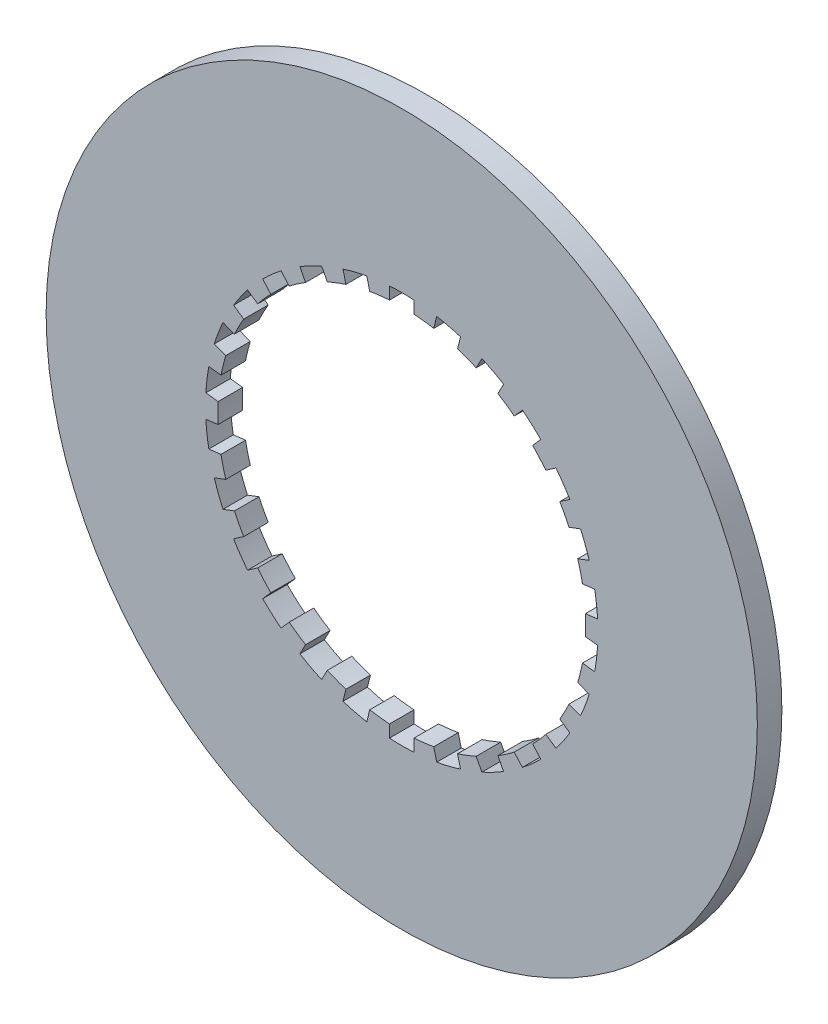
ISO-10303-21;
HEADER;
FILE_DESCRIPTION(('STEP AP214'),'2;1');
FILE_NAME('part.step','',(''),(''),'','','');
FILE_SCHEMA(('AUTOMOTIVE_DESIGN { 1 0 10303 214 1 1 1 1 }'));
ENDSEC;
DATA;
#1=APPLICATION_CONTEXT('core data for automotive mechanical design processes');
#2=APPLICATION_PROTOCOL_DEFINITION('international standard','automotive_design',2000,#1);
#3=PRODUCT_CONTEXT('',#1,'mechanical');
#4=PRODUCT('Part','Part','',(#3));
#5=PRODUCT_RELATED_PRODUCT_CATEGORY('part','',(#4));
#6=PRODUCT_DEFINITION_FORMATION('','',#4);
#7=PRODUCT_DEFINITION_CONTEXT('part definition',#1,'design');
#8=PRODUCT_DEFINITION('design','',#6,#7);
#9=PRODUCT_DEFINITION_SHAPE('','',#8);
#10=(LENGTH_UNIT() NAMED_UNIT(*) SI_UNIT(.MILLI.,.METRE.));
#11=(NAMED_UNIT(*) PLANE_ANGLE_UNIT() SI_UNIT($,.RADIAN.));
#12=(NAMED_UNIT(*) SI_UNIT($,.STERADIAN.) SOLID_ANGLE_UNIT());
#13=UNCERTAINTY_MEASURE_WITH_UNIT(LENGTH_MEASURE(1.E-05),#10,'distance_accuracy_value','');
#14=(GEOMETRIC_REPRESENTATION_CONTEXT(3) GLOBAL_UNCERTAINTY_ASSIGNED_CONTEXT((#13)) GLOBAL_UNIT_ASSIGNED_CONTEXT((#10,
#11,#12)) REPRESENTATION_CONTEXT('',''));
#15=CARTESIAN_POINT('',(0.,0.,0.));
#16=DIRECTION('',(0.,0.,1.));
#17=DIRECTION('',(1.,0.,0.));
#18=AXIS2_PLACEMENT_3D('',#15,#16,#17);
#19=CARTESIAN_POINT('',(0.,0.,1.));
#20=DIRECTION('',(0.,0.,-1.));
#21=DIRECTION('',(-1.,0.,0.));
#22=AXIS2_PLACEMENT_3D('',#19,#20,#21);
#23=CYLINDRICAL_SURFACE('',#22,15.);
#24=CARTESIAN_POINT('',(0.,0.,-1.));
#25=DIRECTION('',(0.,0.,-1.));
#26=DIRECTION('',(-1.,0.,0.));
#27=AXIS2_PLACEMENT_3D('',#24,#25,#26);
#28=CIRCLE('',#27,15.);
#29=CARTESIAN_POINT('',(-6.06988353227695,13.7170154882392,-1.));
#30=VERTEX_POINT('',#29);
#31=CARTESIAN_POINT('',(-4.55269070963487,14.2924108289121,-1.));
#32=VERTEX_POINT('',#31);
#33=EDGE_CURVE('E2405',#30,#32,#28,.T.);
#34=ORIENTED_EDGE('',*,*,#33,.T.);
#35=DIRECTION('',(0.,0.,1.));
#36=VECTOR('',#35,1.);
#37=CARTESIAN_POINT('',(-4.55269070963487,14.2924108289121,-1.));
#38=LINE('',#37,#36);
#39=CARTESIAN_POINT('',(-4.55269070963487,14.2924108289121,1.));
#40=VERTEX_POINT('',#39);
#41=EDGE_CURVE('E2390',#32,#40,#38,.T.);
#42=ORIENTED_EDGE('',*,*,#41,.T.);
#43=CARTESIAN_POINT('',(0.,0.,1.));
#44=DIRECTION('',(0.,0.,-1.));
#45=DIRECTION('',(-1.,0.,0.));
#46=AXIS2_PLACEMENT_3D('',#43,#44,#45);
#47=CIRCLE('',#46,15.);
#48=CARTESIAN_POINT('',(-6.06988353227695,13.7170154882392,1.));
#49=VERTEX_POINT('',#48);
#50=EDGE_CURVE('E695',#49,#40,#47,.T.);
#51=ORIENTED_EDGE('',*,*,#50,.F.);
#52=DIRECTION('',(0.,0.,1.));
#53=VECTOR('',#52,1.);
#54=CARTESIAN_POINT('',(-6.06988353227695,13.7170154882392,-1.));
#55=LINE('',#54,#53);
#56=EDGE_CURVE('E852',#30,#49,#55,.T.);
#57=ORIENTED_EDGE('',*,*,#56,.F.);
#58=EDGE_LOOP('',(#34,#42,#51,#57));
#59=FACE_BOUND('',#58,.T.);
#60=ADVANCED_FACE('F31',(#59),#23,.F.);
#61=CARTESIAN_POINT('',(-9.17620042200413,11.8658057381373,-1.));
#62=VERTEX_POINT('',#61);
#63=CARTESIAN_POINT('',(-7.84079558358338,12.7875691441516,-1.));
#64=VERTEX_POINT('',#63);
#65=EDGE_CURVE('E837',#62,#64,#28,.T.);
#66=ORIENTED_EDGE('',*,*,#65,.T.);
#67=DIRECTION('',(0.,0.,1.));
#68=VECTOR('',#67,1.);
#69=CARTESIAN_POINT('',(-7.84079558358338,12.7875691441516,-1.));
#70=LINE('',#69,#68);
#71=CARTESIAN_POINT('',(-7.84079558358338,12.7875691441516,1.));
#72=VERTEX_POINT('',#71);
#73=EDGE_CURVE('E836',#64,#72,#70,.T.);
#74=ORIENTED_EDGE('',*,*,#73,.T.);
#75=CARTESIAN_POINT('',(-9.17620042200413,11.8658057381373,1.));
#76=VERTEX_POINT('',#75);
#77=EDGE_CURVE('E700',#76,#72,#47,.T.);
#78=ORIENTED_EDGE('',*,*,#77,.F.);
#79=DIRECTION('',(0.,0.,1.));
#80=VECTOR('',#79,1.);
#81=CARTESIAN_POINT('',(-9.17620042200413,11.8658057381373,-1.));
#82=LINE('',#81,#80);
#83=EDGE_CURVE('E834',#62,#76,#82,.T.);
#84=ORIENTED_EDGE('',*,*,#83,.F.);
#85=EDGE_LOOP('',(#66,#74,#78,#84));
#86=FACE_BOUND('',#85,.T.);
#87=ADVANCED_FACE('F833',(#86),#23,.F.);
#88=CARTESIAN_POINT('',(-11.7492298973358,9.32499848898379,-1.));
#89=VERTEX_POINT('',#88);
#90=CARTESIAN_POINT('',(-10.6732219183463,10.5395604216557,-1.));
#91=VERTEX_POINT('',#90);
#92=EDGE_CURVE('E1787',#89,#91,#28,.T.);
#93=ORIENTED_EDGE('',*,*,#92,.T.);
#94=DIRECTION('',(0.,0.,1.));
#95=VECTOR('',#94,1.);
#96=CARTESIAN_POINT('',(-10.6732219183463,10.5395604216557,-1.));
#97=LINE('',#96,#95);
#98=CARTESIAN_POINT('',(-10.6732219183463,10.5395604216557,1.));
#99=VERTEX_POINT('',#98);
#100=EDGE_CURVE('E867',#91,#99,#97,.T.);
#101=ORIENTED_EDGE('',*,*,#100,.T.);
#102=CARTESIAN_POINT('',(-11.7492298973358,9.32499848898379,1.));
#103=VERTEX_POINT('',#102);
#104=EDGE_CURVE('E812',#103,#99,#47,.T.);
#105=ORIENTED_EDGE('',*,*,#104,.F.);
#106=DIRECTION('',(0.,0.,1.));
#107=VECTOR('',#106,1.);
#108=CARTESIAN_POINT('',(-11.7492298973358,9.32499848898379,-1.));
#109=LINE('',#108,#107);
#110=EDGE_CURVE('E892',#89,#103,#109,.T.);
#111=ORIENTED_EDGE('',*,*,#110,.F.);
#112=EDGE_LOOP('',(#93,#101,#105,#111));
#113=FACE_BOUND('',#112,.T.);
#114=ADVANCED_FACE('F1786',(#113),#23,.F.);
#115=CARTESIAN_POINT('',(-13.6394368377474,6.24225622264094,-1.));
#116=VERTEX_POINT('',#115);
#117=CARTESIAN_POINT('',(-12.8853593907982,7.67903075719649,-1.));
#118=VERTEX_POINT('',#117);
#119=EDGE_CURVE('E1773',#116,#118,#28,.T.);
#120=ORIENTED_EDGE('',*,*,#119,.T.);
#121=DIRECTION('',(0.,0.,1.));
#122=VECTOR('',#121,1.);
#123=CARTESIAN_POINT('',(-12.8853593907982,7.67903075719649,-1.));
#124=LINE('',#123,#122);
#125=CARTESIAN_POINT('',(-12.8853593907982,7.67903075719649,1.));
#126=VERTEX_POINT('',#125);
#127=EDGE_CURVE('E893',#118,#126,#124,.T.);
#128=ORIENTED_EDGE('',*,*,#127,.T.);
#129=CARTESIAN_POINT('',(-13.6394368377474,6.24225622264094,1.));
#130=VERTEX_POINT('',#129);
#131=EDGE_CURVE('E807',#130,#126,#47,.T.);
#132=ORIENTED_EDGE('',*,*,#131,.F.);
#133=DIRECTION('',(0.,0.,1.));
#134=VECTOR('',#133,1.);
#135=CARTESIAN_POINT('',(-13.6394368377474,6.24225622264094,-1.));
#136=LINE('',#135,#134);
#137=EDGE_CURVE('E918',#116,#130,#136,.T.);
#138=ORIENTED_EDGE('',*,*,#137,.F.);
#139=EDGE_LOOP('',(#120,#128,#132,#138));
#140=FACE_BOUND('',#139,.T.);
#141=ADVANCED_FACE('F1772',(#140),#23,.F.);
#142=CARTESIAN_POINT('',(-14.7369692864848,2.79673671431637,-1.));
#143=VERTEX_POINT('',#142);
#144=CARTESIAN_POINT('',(-14.3486466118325,4.37222373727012,-1.));
#145=VERTEX_POINT('',#144);
#146=EDGE_CURVE('E1759',#143,#145,#28,.T.);
#147=ORIENTED_EDGE('',*,*,#146,.T.);
#148=DIRECTION('',(0.,0.,1.));
#149=VECTOR('',#148,1.);
#150=CARTESIAN_POINT('',(-14.3486466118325,4.37222373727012,-1.));
#151=LINE('',#150,#149);
#152=CARTESIAN_POINT('',(-14.3486466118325,4.37222373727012,1.));
#153=VERTEX_POINT('',#152);
#154=EDGE_CURVE('E919',#145,#153,#151,.T.);
#155=ORIENTED_EDGE('',*,*,#154,.T.);
#156=CARTESIAN_POINT('',(-14.7369692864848,2.79673671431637,1.));
#157=VERTEX_POINT('',#156);
#158=EDGE_CURVE('E802',#157,#153,#47,.T.);
#159=ORIENTED_EDGE('',*,*,#158,.F.);
#160=DIRECTION('',(0.,0.,1.));
#161=VECTOR('',#160,1.);
#162=CARTESIAN_POINT('',(-14.7369692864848,2.79673671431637,-1.));
#163=LINE('',#162,#161);
#164=EDGE_CURVE('E944',#143,#157,#163,.T.);
#165=ORIENTED_EDGE('',*,*,#164,.F.);
#166=EDGE_LOOP('',(#147,#155,#159,#165));
#167=FACE_BOUND('',#166,.T.);
#168=ADVANCED_FACE('F1758',(#167),#23,.F.);
#169=CARTESIAN_POINT('',(-14.9780426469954,-0.811318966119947,-1.));
#170=VERTEX_POINT('',#169);
#171=CARTESIAN_POINT('',(-14.9780426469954,0.811318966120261,-1.));
#172=VERTEX_POINT('',#171);
#173=EDGE_CURVE('E1745',#170,#172,#28,.T.);
#174=ORIENTED_EDGE('',*,*,#173,.T.);
#175=DIRECTION('',(0.,0.,1.));
#176=VECTOR('',#175,1.);
#177=CARTESIAN_POINT('',(-14.9780426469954,0.811318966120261,-1.));
#178=LINE('',#177,#176);
#179=CARTESIAN_POINT('',(-14.9780426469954,0.811318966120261,1.));
#180=VERTEX_POINT('',#179);
#181=EDGE_CURVE('E945',#172,#180,#178,.T.);
#182=ORIENTED_EDGE('',*,*,#181,.T.);
#183=CARTESIAN_POINT('',(-14.9780426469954,-0.811318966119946,1.));
#184=VERTEX_POINT('',#183);
#185=EDGE_CURVE('E797',#184,#180,#47,.T.);
#186=ORIENTED_EDGE('',*,*,#185,.F.);
#187=DIRECTION('',(0.,0.,1.));
#188=VECTOR('',#187,1.);
#189=CARTESIAN_POINT('',(-14.9780426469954,-0.811318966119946,-1.));
#190=LINE('',#189,#188);
#191=EDGE_CURVE('E970',#170,#184,#190,.T.);
#192=ORIENTED_EDGE('',*,*,#191,.F.);
#193=EDGE_LOOP('',(#174,#182,#186,#192));
#194=FACE_BOUND('',#193,.T.);
#195=ADVANCED_FACE('F1744',(#194),#23,.F.);
#196=CARTESIAN_POINT('',(-14.3486466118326,-4.37222373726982,-1.));
#197=VERTEX_POINT('',#196);
#198=CARTESIAN_POINT('',(-14.7369692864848,-2.79673671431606,-1.));
#199=VERTEX_POINT('',#198);
#200=EDGE_CURVE('E1731',#197,#199,#28,.T.);
#201=ORIENTED_EDGE('',*,*,#200,.T.);
#202=DIRECTION('',(0.,0.,1.));
#203=VECTOR('',#202,1.);
#204=CARTESIAN_POINT('',(-14.7369692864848,-2.79673671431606,-1.));
#205=LINE('',#204,#203);
#206=CARTESIAN_POINT('',(-14.7369692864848,-2.79673671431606,1.));
#207=VERTEX_POINT('',#206);
#208=EDGE_CURVE('E971',#199,#207,#205,.T.);
#209=ORIENTED_EDGE('',*,*,#208,.T.);
#210=CARTESIAN_POINT('',(-14.3486466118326,-4.37222373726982,1.));
#211=VERTEX_POINT('',#210);
#212=EDGE_CURVE('E792',#211,#207,#47,.T.);
#213=ORIENTED_EDGE('',*,*,#212,.F.);
#214=DIRECTION('',(0.,0.,1.));
#215=VECTOR('',#214,1.);
#216=CARTESIAN_POINT('',(-14.3486466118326,-4.37222373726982,-1.));
#217=LINE('',#216,#215);
#218=EDGE_CURVE('E996',#197,#211,#217,.T.);
#219=ORIENTED_EDGE('',*,*,#218,.F.);
#220=EDGE_LOOP('',(#201,#209,#213,#219));
#221=FACE_BOUND('',#220,.T.);
#222=ADVANCED_FACE('F1730',(#221),#23,.F.);
#223=CARTESIAN_POINT('',(-12.8853593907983,-7.67903075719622,-1.));
#224=VERTEX_POINT('',#223);
#225=CARTESIAN_POINT('',(-13.6394368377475,-6.24225622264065,-1.));
#226=VERTEX_POINT('',#225);
#227=EDGE_CURVE('E1717',#224,#226,#28,.T.);
#228=ORIENTED_EDGE('',*,*,#227,.T.);
#229=DIRECTION('',(0.,0.,1.));
#230=VECTOR('',#229,1.);
#231=CARTESIAN_POINT('',(-13.6394368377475,-6.24225622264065,-1.));
#232=LINE('',#231,#230);
#233=CARTESIAN_POINT('',(-13.6394368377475,-6.24225622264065,1.));
#234=VERTEX_POINT('',#233);
#235=EDGE_CURVE('E997',#226,#234,#232,.T.);
#236=ORIENTED_EDGE('',*,*,#235,.T.);
#237=CARTESIAN_POINT('',(-12.8853593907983,-7.67903075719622,1.));
#238=VERTEX_POINT('',#237);
#239=EDGE_CURVE('E787',#238,#234,#47,.T.);
#240=ORIENTED_EDGE('',*,*,#239,.F.);
#241=DIRECTION('',(0.,0.,1.));
#242=VECTOR('',#241,1.);
#243=CARTESIAN_POINT('',(-12.8853593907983,-7.67903075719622,-1.));
#244=LINE('',#243,#242);
#245=EDGE_CURVE('E1022',#224,#238,#244,.T.);
#246=ORIENTED_EDGE('',*,*,#245,.F.);
#247=EDGE_LOOP('',(#228,#236,#240,#246));
#248=FACE_BOUND('',#247,.T.);
#249=ADVANCED_FACE('F1716',(#248),#23,.F.);
#250=CARTESIAN_POINT('',(-10.6732219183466,-10.5395604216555,-1.));
#251=VERTEX_POINT('',#250);
#252=CARTESIAN_POINT('',(-11.749229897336,-9.32499848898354,-1.));
#253=VERTEX_POINT('',#252);
#254=EDGE_CURVE('E1703',#251,#253,#28,.T.);
#255=ORIENTED_EDGE('',*,*,#254,.T.);
#256=DIRECTION('',(0.,0.,1.));
#257=VECTOR('',#256,1.);
#258=CARTESIAN_POINT('',(-11.749229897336,-9.32499848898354,-1.));
#259=LINE('',#258,#257);
#260=CARTESIAN_POINT('',(-11.749229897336,-9.32499848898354,1.));
#261=VERTEX_POINT('',#260);
#262=EDGE_CURVE('E1023',#253,#261,#259,.T.);
#263=ORIENTED_EDGE('',*,*,#262,.T.);
#264=CARTESIAN_POINT('',(-10.6732219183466,-10.5395604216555,1.));
#265=VERTEX_POINT('',#264);
#266=EDGE_CURVE('E782',#265,#261,#47,.T.);
#267=ORIENTED_EDGE('',*,*,#266,.F.);
#268=DIRECTION('',(0.,0.,1.));
#269=VECTOR('',#268,1.);
#270=CARTESIAN_POINT('',(-10.6732219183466,-10.5395604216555,-1.));
#271=LINE('',#270,#269);
#272=EDGE_CURVE('E1048',#251,#265,#271,.T.);
#273=ORIENTED_EDGE('',*,*,#272,.F.);
#274=EDGE_LOOP('',(#255,#263,#267,#273));
#275=FACE_BOUND('',#274,.T.);
#276=ADVANCED_FACE('F1702',(#275),#23,.F.);
#277=CARTESIAN_POINT('',(-7.84079558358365,-12.7875691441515,-1.));
#278=VERTEX_POINT('',#277);
#279=CARTESIAN_POINT('',(-9.17620042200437,-11.8658057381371,-1.));
#280=VERTEX_POINT('',#279);
#281=EDGE_CURVE('E1689',#278,#280,#28,.T.);
#282=ORIENTED_EDGE('',*,*,#281,.T.);
#283=DIRECTION('',(0.,0.,1.));
#284=VECTOR('',#283,1.);
#285=CARTESIAN_POINT('',(-9.17620042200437,-11.8658057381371,-1.));
#286=LINE('',#285,#284);
#287=CARTESIAN_POINT('',(-9.17620042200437,-11.8658057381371,1.));
#288=VERTEX_POINT('',#287);
#289=EDGE_CURVE('E1049',#280,#288,#286,.T.);
#290=ORIENTED_EDGE('',*,*,#289,.T.);
#291=CARTESIAN_POINT('',(-7.84079558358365,-12.7875691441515,1.));
#292=VERTEX_POINT('',#291);
#293=EDGE_CURVE('E777',#292,#288,#47,.T.);
#294=ORIENTED_EDGE('',*,*,#293,.F.);
#295=DIRECTION('',(0.,0.,1.));
#296=VECTOR('',#295,1.);
#297=CARTESIAN_POINT('',(-7.84079558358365,-12.7875691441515,-1.));
#298=LINE('',#297,#296);
#299=EDGE_CURVE('E1074',#278,#292,#298,.T.);
#300=ORIENTED_EDGE('',*,*,#299,.F.);
#301=EDGE_LOOP('',(#282,#290,#294,#300));
#302=FACE_BOUND('',#301,.T.);
#303=ADVANCED_FACE('F1688',(#302),#23,.F.);
#304=CARTESIAN_POINT('',(-4.55269070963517,-14.292410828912,-1.));
#305=VERTEX_POINT('',#304);
#306=CARTESIAN_POINT('',(-6.06988353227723,-13.717015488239,-1.));
#307=VERTEX_POINT('',#306);
#308=EDGE_CURVE('E1675',#305,#307,#28,.T.);
#309=ORIENTED_EDGE('',*,*,#308,.T.);
#310=DIRECTION('',(0.,0.,1.));
#311=VECTOR('',#310,1.);
#312=CARTESIAN_POINT('',(-6.06988353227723,-13.717015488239,-1.));
#313=LINE('',#312,#311);
#314=CARTESIAN_POINT('',(-6.06988353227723,-13.717015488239,1.));
#315=VERTEX_POINT('',#314);
#316=EDGE_CURVE('E1075',#307,#315,#313,.T.);
#317=ORIENTED_EDGE('',*,*,#316,.T.);
#318=CARTESIAN_POINT('',(-4.55269070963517,-14.292410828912,1.));
#319=VERTEX_POINT('',#318);
#320=EDGE_CURVE('E772',#319,#315,#47,.T.);
#321=ORIENTED_EDGE('',*,*,#320,.F.);
#322=DIRECTION('',(0.,0.,1.));
#323=VECTOR('',#322,1.);
#324=CARTESIAN_POINT('',(-4.55269070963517,-14.292410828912,-1.));
#325=LINE('',#324,#323);
#326=EDGE_CURVE('E1100',#305,#319,#325,.T.);
#327=ORIENTED_EDGE('',*,*,#326,.F.);
#328=EDGE_LOOP('',(#309,#317,#321,#327));
#329=FACE_BOUND('',#328,.T.);
#330=ADVANCED_FACE('F1674',(#329),#23,.F.);
#331=CARTESIAN_POINT('',(-1.00000000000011,-14.9666295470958,-1.));
#332=VERTEX_POINT('',#331);
#333=CARTESIAN_POINT('',(-2.61080707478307,-14.7710421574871,-1.));
#334=VERTEX_POINT('',#333);
#335=EDGE_CURVE('E1661',#332,#334,#28,.T.);
#336=ORIENTED_EDGE('',*,*,#335,.T.);
#337=DIRECTION('',(0.,0.,1.));
#338=VECTOR('',#337,1.);
#339=CARTESIAN_POINT('',(-2.61080707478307,-14.7710421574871,-1.));
#340=LINE('',#339,#338);
#341=CARTESIAN_POINT('',(-2.61080707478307,-14.7710421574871,1.));
#342=VERTEX_POINT('',#341);
#343=EDGE_CURVE('E1101',#334,#342,#340,.T.);
#344=ORIENTED_EDGE('',*,*,#343,.T.);
#345=CARTESIAN_POINT('',(-1.00000000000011,-14.9666295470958,1.));
#346=VERTEX_POINT('',#345);
#347=EDGE_CURVE('E767',#346,#342,#47,.T.);
#348=ORIENTED_EDGE('',*,*,#347,.F.);
#349=DIRECTION('',(0.,0.,1.));
#350=VECTOR('',#349,1.);
#351=CARTESIAN_POINT('',(-1.00000000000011,-14.9666295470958,-1.));
#352=LINE('',#351,#350);
#353=EDGE_CURVE('E1126',#332,#346,#352,.T.);
#354=ORIENTED_EDGE('',*,*,#353,.F.);
#355=EDGE_LOOP('',(#336,#344,#348,#354));
#356=FACE_BOUND('',#355,.T.);
#357=ADVANCED_FACE('F1660',(#356),#23,.F.);
#358=CARTESIAN_POINT('',(2.61080707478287,-14.7710421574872,-1.));
#359=VERTEX_POINT('',#358);
#360=CARTESIAN_POINT('',(0.999999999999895,-14.9666295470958,-1.));
#361=VERTEX_POINT('',#360);
#362=EDGE_CURVE('E1647',#359,#361,#28,.T.);
#363=ORIENTED_EDGE('',*,*,#362,.T.);
#364=DIRECTION('',(0.,0.,1.));
#365=VECTOR('',#364,1.);
#366=CARTESIAN_POINT('',(0.999999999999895,-14.9666295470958,-1.));
#367=LINE('',#366,#365);
#368=CARTESIAN_POINT('',(0.999999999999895,-14.9666295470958,1.));
#369=VERTEX_POINT('',#368);
#370=EDGE_CURVE('E1127',#361,#369,#367,.T.);
#371=ORIENTED_EDGE('',*,*,#370,.T.);
#372=CARTESIAN_POINT('',(2.61080707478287,-14.7710421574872,1.));
#373=VERTEX_POINT('',#372);
#374=EDGE_CURVE('E762',#373,#369,#47,.T.);
#375=ORIENTED_EDGE('',*,*,#374,.F.);
#376=DIRECTION('',(0.,0.,1.));
#377=VECTOR('',#376,1.);
#378=CARTESIAN_POINT('',(2.61080707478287,-14.7710421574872,-1.));
#379=LINE('',#378,#377);
#380=EDGE_CURVE('E1152',#359,#373,#379,.T.);
#381=ORIENTED_EDGE('',*,*,#380,.F.);
#382=EDGE_LOOP('',(#363,#371,#375,#381));
#383=FACE_BOUND('',#382,.T.);
#384=ADVANCED_FACE('F1646',(#383),#23,.F.);
#385=CARTESIAN_POINT('',(6.06988353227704,-13.7170154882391,-1.));
#386=VERTEX_POINT('',#385);
#387=CARTESIAN_POINT('',(4.55269070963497,-14.2924108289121,-1.));
#388=VERTEX_POINT('',#387);
#389=EDGE_CURVE('E1633',#386,#388,#28,.T.);
#390=ORIENTED_EDGE('',*,*,#389,.T.);
#391=DIRECTION('',(0.,0.,1.));
#392=VECTOR('',#391,1.);
#393=CARTESIAN_POINT('',(4.55269070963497,-14.2924108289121,-1.));
#394=LINE('',#393,#392);
#395=CARTESIAN_POINT('',(4.55269070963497,-14.2924108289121,1.));
#396=VERTEX_POINT('',#395);
#397=EDGE_CURVE('E1153',#388,#396,#394,.T.);
#398=ORIENTED_EDGE('',*,*,#397,.T.);
#399=CARTESIAN_POINT('',(6.06988353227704,-13.7170154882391,1.));
#400=VERTEX_POINT('',#399);
#401=EDGE_CURVE('E757',#400,#396,#47,.T.);
#402=ORIENTED_EDGE('',*,*,#401,.F.);
#403=DIRECTION('',(0.,0.,1.));
#404=VECTOR('',#403,1.);
#405=CARTESIAN_POINT('',(6.06988353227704,-13.7170154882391,-1.));
#406=LINE('',#405,#404);
#407=EDGE_CURVE('E1178',#386,#400,#406,.T.);
#408=ORIENTED_EDGE('',*,*,#407,.F.);
#409=EDGE_LOOP('',(#390,#398,#402,#408));
#410=FACE_BOUND('',#409,.T.);
#411=ADVANCED_FACE('F1632',(#410),#23,.F.);
#412=CARTESIAN_POINT('',(9.17620042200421,-11.8658057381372,-1.));
#413=VERTEX_POINT('',#412);
#414=CARTESIAN_POINT('',(7.84079558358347,-12.7875691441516,-1.));
#415=VERTEX_POINT('',#414);
#416=EDGE_CURVE('E1619',#413,#415,#28,.T.);
#417=ORIENTED_EDGE('',*,*,#416,.T.);
#418=DIRECTION('',(0.,0.,1.));
#419=VECTOR('',#418,1.);
#420=CARTESIAN_POINT('',(7.84079558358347,-12.7875691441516,-1.));
#421=LINE('',#420,#419);
#422=CARTESIAN_POINT('',(7.84079558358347,-12.7875691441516,1.));
#423=VERTEX_POINT('',#422);
#424=EDGE_CURVE('E1179',#415,#423,#421,.T.);
#425=ORIENTED_EDGE('',*,*,#424,.T.);
#426=CARTESIAN_POINT('',(9.17620042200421,-11.8658057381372,1.));
#427=VERTEX_POINT('',#426);
#428=EDGE_CURVE('E752',#427,#423,#47,.T.);
#429=ORIENTED_EDGE('',*,*,#428,.F.);
#430=DIRECTION('',(0.,0.,1.));
#431=VECTOR('',#430,1.);
#432=CARTESIAN_POINT('',(9.17620042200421,-11.8658057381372,-1.));
#433=LINE('',#432,#431);
#434=EDGE_CURVE('E1204',#413,#427,#433,.T.);
#435=ORIENTED_EDGE('',*,*,#434,.F.);
#436=EDGE_LOOP('',(#417,#425,#429,#435));
#437=FACE_BOUND('',#436,.T.);
#438=ADVANCED_FACE('F1618',(#437),#23,.F.);
#439=CARTESIAN_POINT('',(11.7492298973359,-9.3249984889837,-1.));
#440=VERTEX_POINT('',#439);
#441=CARTESIAN_POINT('',(10.6732219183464,-10.5395604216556,-1.));
#442=VERTEX_POINT('',#441);
#443=EDGE_CURVE('E1605',#440,#442,#28,.T.);
#444=ORIENTED_EDGE('',*,*,#443,.T.);
#445=DIRECTION('',(0.,0.,1.));
#446=VECTOR('',#445,1.);
#447=CARTESIAN_POINT('',(10.6732219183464,-10.5395604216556,-1.));
#448=LINE('',#447,#446);
#449=CARTESIAN_POINT('',(10.6732219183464,-10.5395604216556,1.));
#450=VERTEX_POINT('',#449);
#451=EDGE_CURVE('E1205',#442,#450,#448,.T.);
#452=ORIENTED_EDGE('',*,*,#451,.T.);
#453=CARTESIAN_POINT('',(11.7492298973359,-9.3249984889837,1.));
#454=VERTEX_POINT('',#453);
#455=EDGE_CURVE('E747',#454,#450,#47,.T.);
#456=ORIENTED_EDGE('',*,*,#455,.F.);
#457=DIRECTION('',(0.,0.,1.));
#458=VECTOR('',#457,1.);
#459=CARTESIAN_POINT('',(11.7492298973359,-9.3249984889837,-1.));
#460=LINE('',#459,#458);
#461=EDGE_CURVE('E1230',#440,#454,#460,.T.);
#462=ORIENTED_EDGE('',*,*,#461,.F.);
#463=EDGE_LOOP('',(#444,#452,#456,#462));
#464=FACE_BOUND('',#463,.T.);
#465=ADVANCED_FACE('F1604',(#464),#23,.F.);
#466=CARTESIAN_POINT('',(13.6394368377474,-6.24225622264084,-1.));
#467=VERTEX_POINT('',#466);
#468=CARTESIAN_POINT('',(12.8853593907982,-7.67903075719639,-1.));
#469=VERTEX_POINT('',#468);
#470=EDGE_CURVE('E1591',#467,#469,#28,.T.);
#471=ORIENTED_EDGE('',*,*,#470,.T.);
#472=DIRECTION('',(0.,0.,1.));
#473=VECTOR('',#472,1.);
#474=CARTESIAN_POINT('',(12.8853593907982,-7.67903075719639,-1.));
#475=LINE('',#474,#473);
#476=CARTESIAN_POINT('',(12.8853593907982,-7.67903075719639,1.));
#477=VERTEX_POINT('',#476);
#478=EDGE_CURVE('E1231',#469,#477,#475,.T.);
#479=ORIENTED_EDGE('',*,*,#478,.T.);
#480=CARTESIAN_POINT('',(13.6394368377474,-6.24225622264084,1.));
#481=VERTEX_POINT('',#480);
#482=EDGE_CURVE('E742',#481,#477,#47,.T.);
#483=ORIENTED_EDGE('',*,*,#482,.F.);
#484=DIRECTION('',(0.,0.,1.));
#485=VECTOR('',#484,1.);
#486=CARTESIAN_POINT('',(13.6394368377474,-6.24225622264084,-1.));
#487=LINE('',#486,#485);
#488=EDGE_CURVE('E1256',#467,#481,#487,.T.);
#489=ORIENTED_EDGE('',*,*,#488,.F.);
#490=EDGE_LOOP('',(#471,#479,#483,#489));
#491=FACE_BOUND('',#490,.T.);
#492=ADVANCED_FACE('F1590',(#491),#23,.F.);
#493=CARTESIAN_POINT('',(14.7369692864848,-2.79673671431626,-1.));
#494=VERTEX_POINT('',#493);
#495=CARTESIAN_POINT('',(14.3486466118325,-4.37222373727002,-1.));
#496=VERTEX_POINT('',#495);
#497=EDGE_CURVE('E1577',#494,#496,#28,.T.);
#498=ORIENTED_EDGE('',*,*,#497,.T.);
#499=DIRECTION('',(0.,0.,1.));
#500=VECTOR('',#499,1.);
#501=CARTESIAN_POINT('',(14.3486466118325,-4.37222373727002,-1.));
#502=LINE('',#501,#500);
#503=CARTESIAN_POINT('',(14.3486466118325,-4.37222373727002,1.));
#504=VERTEX_POINT('',#503);
#505=EDGE_CURVE('E1257',#496,#504,#502,.T.);
#506=ORIENTED_EDGE('',*,*,#505,.T.);
#507=CARTESIAN_POINT('',(14.7369692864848,-2.79673671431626,1.));
#508=VERTEX_POINT('',#507);
#509=EDGE_CURVE('E737',#508,#504,#47,.T.);
#510=ORIENTED_EDGE('',*,*,#509,.F.);
#511=DIRECTION('',(0.,0.,1.));
#512=VECTOR('',#511,1.);
#513=CARTESIAN_POINT('',(14.7369692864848,-2.79673671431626,-1.));
#514=LINE('',#513,#512);
#515=EDGE_CURVE('E1282',#494,#508,#514,.T.);
#516=ORIENTED_EDGE('',*,*,#515,.F.);
#517=EDGE_LOOP('',(#498,#506,#510,#516));
#518=FACE_BOUND('',#517,.T.);
#519=ADVANCED_FACE('F1576',(#518),#23,.F.);
#520=CARTESIAN_POINT('',(14.9780426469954,0.811318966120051,-1.));
#521=VERTEX_POINT('',#520);
#522=CARTESIAN_POINT('',(14.9780426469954,-0.811318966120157,-1.));
#523=VERTEX_POINT('',#522);
#524=EDGE_CURVE('E1563',#521,#523,#28,.T.);
#525=ORIENTED_EDGE('',*,*,#524,.T.);
#526=DIRECTION('',(0.,0.,1.));
#527=VECTOR('',#526,1.);
#528=CARTESIAN_POINT('',(14.9780426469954,-0.811318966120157,-1.));
#529=LINE('',#528,#527);
#530=CARTESIAN_POINT('',(14.9780426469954,-0.811318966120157,1.));
#531=VERTEX_POINT('',#530);
#532=EDGE_CURVE('E1283',#523,#531,#529,.T.);
#533=ORIENTED_EDGE('',*,*,#532,.T.);
#534=CARTESIAN_POINT('',(14.9780426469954,0.811318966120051,1.));
#535=VERTEX_POINT('',#534);
#536=EDGE_CURVE('E732',#535,#531,#47,.T.);
#537=ORIENTED_EDGE('',*,*,#536,.F.);
#538=DIRECTION('',(0.,0.,1.));
#539=VECTOR('',#538,1.);
#540=CARTESIAN_POINT('',(14.9780426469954,0.811318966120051,-1.));
#541=LINE('',#540,#539);
#542=EDGE_CURVE('E1308',#521,#535,#541,.T.);
#543=ORIENTED_EDGE('',*,*,#542,.F.);
#544=EDGE_LOOP('',(#525,#533,#537,#543));
#545=FACE_BOUND('',#544,.T.);
#546=ADVANCED_FACE('F1562',(#545),#23,.F.);
#547=CARTESIAN_POINT('',(14.3486466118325,4.37222373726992,-1.));
#548=VERTEX_POINT('',#547);
#549=CARTESIAN_POINT('',(14.7369692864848,2.79673671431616,-1.));
#550=VERTEX_POINT('',#549);
#551=EDGE_CURVE('E1549',#548,#550,#28,.T.);
#552=ORIENTED_EDGE('',*,*,#551,.T.);
#553=DIRECTION('',(0.,0.,1.));
#554=VECTOR('',#553,1.);
#555=CARTESIAN_POINT('',(14.7369692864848,2.79673671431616,-1.));
#556=LINE('',#555,#554);
#557=CARTESIAN_POINT('',(14.7369692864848,2.79673671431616,1.));
#558=VERTEX_POINT('',#557);
#559=EDGE_CURVE('E1309',#550,#558,#556,.T.);
#560=ORIENTED_EDGE('',*,*,#559,.T.);
#561=CARTESIAN_POINT('',(14.3486466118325,4.37222373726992,1.));
#562=VERTEX_POINT('',#561);
#563=EDGE_CURVE('E727',#562,#558,#47,.T.);
#564=ORIENTED_EDGE('',*,*,#563,.F.);
#565=DIRECTION('',(0.,0.,1.));
#566=VECTOR('',#565,1.);
#567=CARTESIAN_POINT('',(14.3486466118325,4.37222373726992,-1.));
#568=LINE('',#567,#566);
#569=EDGE_CURVE('E1334',#548,#562,#568,.T.);
#570=ORIENTED_EDGE('',*,*,#569,.F.);
#571=EDGE_LOOP('',(#552,#560,#564,#570));
#572=FACE_BOUND('',#571,.T.);
#573=ADVANCED_FACE('F1548',(#572),#23,.F.);
#574=CARTESIAN_POINT('',(12.8853593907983,7.67903075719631,-1.));
#575=VERTEX_POINT('',#574);
#576=CARTESIAN_POINT('',(13.6394368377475,6.24225622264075,-1.));
#577=VERTEX_POINT('',#576);
#578=EDGE_CURVE('E1535',#575,#577,#28,.T.);
#579=ORIENTED_EDGE('',*,*,#578,.T.);
#580=DIRECTION('',(0.,0.,1.));
#581=VECTOR('',#580,1.);
#582=CARTESIAN_POINT('',(13.6394368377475,6.24225622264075,-1.));
#583=LINE('',#582,#581);
#584=CARTESIAN_POINT('',(13.6394368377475,6.24225622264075,1.));
#585=VERTEX_POINT('',#584);
#586=EDGE_CURVE('E1335',#577,#585,#583,.T.);
#587=ORIENTED_EDGE('',*,*,#586,.T.);
#588=CARTESIAN_POINT('',(12.8853593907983,7.6790307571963,1.));
#589=VERTEX_POINT('',#588);
#590=EDGE_CURVE('E722',#589,#585,#47,.T.);
#591=ORIENTED_EDGE('',*,*,#590,.F.);
#592=DIRECTION('',(0.,0.,1.));
#593=VECTOR('',#592,1.);
#594=CARTESIAN_POINT('',(12.8853593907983,7.6790307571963,-1.));
#595=LINE('',#594,#593);
#596=EDGE_CURVE('E1360',#575,#589,#595,.T.);
#597=ORIENTED_EDGE('',*,*,#596,.F.);
#598=EDGE_LOOP('',(#579,#587,#591,#597));
#599=FACE_BOUND('',#598,.T.);
#600=ADVANCED_FACE('F1534',(#599),#23,.F.);
#601=CARTESIAN_POINT('',(10.6732219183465,10.5395604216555,-1.));
#602=VERTEX_POINT('',#601);
#603=CARTESIAN_POINT('',(11.749229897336,9.32499848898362,-1.));
#604=VERTEX_POINT('',#603);
#605=EDGE_CURVE('E1521',#602,#604,#28,.T.);
#606=ORIENTED_EDGE('',*,*,#605,.T.);
#607=DIRECTION('',(0.,0.,1.));
#608=VECTOR('',#607,1.);
#609=CARTESIAN_POINT('',(11.749229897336,9.32499848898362,-1.));
#610=LINE('',#609,#608);
#611=CARTESIAN_POINT('',(11.749229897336,9.32499848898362,1.));
#612=VERTEX_POINT('',#611);
#613=EDGE_CURVE('E1361',#604,#612,#610,.T.);
#614=ORIENTED_EDGE('',*,*,#613,.T.);
#615=CARTESIAN_POINT('',(10.6732219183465,10.5395604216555,1.));
#616=VERTEX_POINT('',#615);
#617=EDGE_CURVE('E717',#616,#612,#47,.T.);
#618=ORIENTED_EDGE('',*,*,#617,.F.);
#619=DIRECTION('',(0.,0.,1.));
#620=VECTOR('',#619,1.);
#621=CARTESIAN_POINT('',(10.6732219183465,10.5395604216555,-1.));
#622=LINE('',#621,#620);
#623=EDGE_CURVE('E1386',#602,#616,#622,.T.);
#624=ORIENTED_EDGE('',*,*,#623,.F.);
#625=EDGE_LOOP('',(#606,#614,#618,#624));
#626=FACE_BOUND('',#625,.T.);
#627=ADVANCED_FACE('F1520',(#626),#23,.F.);
#628=CARTESIAN_POINT('',(7.84079558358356,12.7875691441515,-1.));
#629=VERTEX_POINT('',#628);
#630=CARTESIAN_POINT('',(9.17620042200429,11.8658057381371,-1.));
#631=VERTEX_POINT('',#630);
#632=EDGE_CURVE('E1507',#629,#631,#28,.T.);
#633=ORIENTED_EDGE('',*,*,#632,.T.);
#634=DIRECTION('',(0.,0.,1.));
#635=VECTOR('',#634,1.);
#636=CARTESIAN_POINT('',(9.17620042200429,11.8658057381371,-1.));
#637=LINE('',#636,#635);
#638=CARTESIAN_POINT('',(9.17620042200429,11.8658057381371,1.));
#639=VERTEX_POINT('',#638);
#640=EDGE_CURVE('E1387',#631,#639,#637,.T.);
#641=ORIENTED_EDGE('',*,*,#640,.T.);
#642=CARTESIAN_POINT('',(7.84079558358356,12.7875691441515,1.));
#643=VERTEX_POINT('',#642);
#644=EDGE_CURVE('E712',#643,#639,#47,.T.);
#645=ORIENTED_EDGE('',*,*,#644,.F.);
#646=DIRECTION('',(0.,0.,1.));
#647=VECTOR('',#646,1.);
#648=CARTESIAN_POINT('',(7.84079558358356,12.7875691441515,-1.));
#649=LINE('',#648,#647);
#650=EDGE_CURVE('E1412',#629,#643,#649,.T.);
#651=ORIENTED_EDGE('',*,*,#650,.F.);
#652=EDGE_LOOP('',(#633,#641,#645,#651));
#653=FACE_BOUND('',#652,.T.);
#654=ADVANCED_FACE('F1506',(#653),#23,.F.);
#655=CARTESIAN_POINT('',(4.55269070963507,14.2924108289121,-1.));
#656=VERTEX_POINT('',#655);
#657=CARTESIAN_POINT('',(6.06988353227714,13.7170154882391,-1.));
#658=VERTEX_POINT('',#657);
#659=EDGE_CURVE('E702',#656,#658,#28,.T.);
#660=ORIENTED_EDGE('',*,*,#659,.T.);
#661=DIRECTION('',(0.,0.,1.));
#662=VECTOR('',#661,1.);
#663=CARTESIAN_POINT('',(6.06988353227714,13.7170154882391,-1.));
#664=LINE('',#663,#662);
#665=CARTESIAN_POINT('',(6.06988353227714,13.7170154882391,1.));
#666=VERTEX_POINT('',#665);
#667=EDGE_CURVE('E1413',#658,#666,#664,.T.);
#668=ORIENTED_EDGE('',*,*,#667,.T.);
#669=CARTESIAN_POINT('',(4.55269070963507,14.2924108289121,1.));
#670=VERTEX_POINT('',#669);
#671=EDGE_CURVE('E706',#670,#666,#47,.T.);
#672=ORIENTED_EDGE('',*,*,#671,.F.);
#673=DIRECTION('',(0.,0.,1.));
#674=VECTOR('',#673,1.);
#675=CARTESIAN_POINT('',(4.55269070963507,14.2924108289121,-1.));
#676=LINE('',#675,#674);
#677=EDGE_CURVE('E1438',#656,#670,#676,.T.);
#678=ORIENTED_EDGE('',*,*,#677,.F.);
#679=EDGE_LOOP('',(#660,#668,#672,#678));
#680=FACE_BOUND('',#679,.T.);
#681=ADVANCED_FACE('F1493',(#680),#23,.F.);
#682=CARTESIAN_POINT('',(1.,14.9666295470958,-1.));
#683=VERTEX_POINT('',#682);
#684=CARTESIAN_POINT('',(2.61080707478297,14.7710421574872,-1.));
#685=VERTEX_POINT('',#684);
#686=EDGE_CURVE('E696',#683,#685,#28,.T.);
#687=ORIENTED_EDGE('',*,*,#686,.T.);
#688=DIRECTION('',(0.,0.,1.));
#689=VECTOR('',#688,1.);
#690=CARTESIAN_POINT('',(2.61080707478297,14.7710421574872,-1.));
#691=LINE('',#690,#689);
#692=CARTESIAN_POINT('',(2.61080707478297,14.7710421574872,1.));
#693=VERTEX_POINT('',#692);
#694=EDGE_CURVE('E1439',#685,#693,#691,.T.);
#695=ORIENTED_EDGE('',*,*,#694,.T.);
#696=CARTESIAN_POINT('',(1.,14.9666295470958,1.));
#697=VERTEX_POINT('',#696);
#698=EDGE_CURVE('E698',#697,#693,#47,.T.);
#699=ORIENTED_EDGE('',*,*,#698,.F.);
#700=DIRECTION('',(0.,0.,1.));
#701=VECTOR('',#700,1.);
#702=CARTESIAN_POINT('',(1.,14.9666295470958,-1.));
#703=LINE('',#702,#701);
#704=EDGE_CURVE('E1464',#683,#697,#703,.T.);
#705=ORIENTED_EDGE('',*,*,#704,.F.);
#706=EDGE_LOOP('',(#687,#695,#699,#705));
#707=FACE_BOUND('',#706,.T.);
#708=ADVANCED_FACE('F1476',(#707),#23,.F.);
#709=CARTESIAN_POINT('',(0.,0.,1.));
#710=DIRECTION('',(0.,0.,-1.));
#711=DIRECTION('',(-1.,0.,0.));
#712=AXIS2_PLACEMENT_3D('',#709,#710,#711);
#713=CYLINDRICAL_SURFACE('',#712,29.);
#714=CARTESIAN_POINT('',(0.,0.,1.));
#715=DIRECTION('',(0.,0.,1.));
#716=DIRECTION('',(1.,0.,0.));
#717=AXIS2_PLACEMENT_3D('',#714,#715,#716);
#718=CIRCLE('',#717,29.);
#719=CARTESIAN_POINT('',(29.,0.,1.));
#720=VERTEX_POINT('',#719);
#721=EDGE_CURVE('E11',#720,#720,#718,.T.);
#722=ORIENTED_EDGE('',*,*,#721,.F.);
#723=EDGE_LOOP('',(#722));
#724=FACE_BOUND('',#723,.T.);
#725=CARTESIAN_POINT('',(0.,0.,-1.));
#726=DIRECTION('',(0.,0.,1.));
#727=DIRECTION('',(1.,0.,0.));
#728=AXIS2_PLACEMENT_3D('',#725,#726,#727);
#729=CIRCLE('',#728,29.);
#730=CARTESIAN_POINT('',(29.,0.,-1.));
#731=VERTEX_POINT('',#730);
#732=EDGE_CURVE('E39',#731,#731,#729,.T.);
#733=ORIENTED_EDGE('',*,*,#732,.T.);
#734=EDGE_LOOP('',(#733));
#735=FACE_BOUND('',#734,.T.);
#736=ADVANCED_FACE('F33',(#724,#735),#713,.T.);
#737=CARTESIAN_POINT('',(0.,0.,1.));
#738=DIRECTION('',(0.,0.,1.));
#739=DIRECTION('',(1.,0.,0.));
#740=AXIS2_PLACEMENT_3D('',#737,#738,#739);
#741=PLANE('',#740);
#742=DIRECTION('',(0.239315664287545,-0.970941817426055,0.));
#743=VECTOR('',#742,1.);
#744=CARTESIAN_POINT('',(-4.79250651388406,15.2653817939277,1.));
#745=LINE('',#744,#743);
#746=CARTESIAN_POINT('',(-4.79250651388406,15.2653817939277,1.));
#747=VERTEX_POINT('',#746);
#748=EDGE_CURVE('E2378',#747,#40,#745,.T.);
#749=ORIENTED_EDGE('',*,*,#748,.F.);
#750=CARTESIAN_POINT('',(0.,0.,1.));
#751=DIRECTION('',(0.,0.,1.));
#752=DIRECTION('',(0.970941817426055,0.239315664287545,0.));
#753=AXIS2_PLACEMENT_3D('',#750,#751,#752);
#754=CIRCLE('',#753,16.);
#755=CARTESIAN_POINT('',(-2.85062287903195,15.7440131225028,1.));
#756=VERTEX_POINT('',#755);
#757=EDGE_CURVE('E689',#756,#747,#754,.T.);
#758=ORIENTED_EDGE('',*,*,#757,.F.);
#759=DIRECTION('',(-0.239315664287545,0.970941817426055,0.));
#760=VECTOR('',#759,1.);
#761=CARTESIAN_POINT('',(-2.85062287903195,15.7440131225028,1.));
#762=LINE('',#761,#760);
#763=CARTESIAN_POINT('',(-2.61080707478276,14.7710421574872,1.));
#764=VERTEX_POINT('',#763);
#765=EDGE_CURVE('E673',#764,#756,#762,.T.);
#766=ORIENTED_EDGE('',*,*,#765,.F.);
#767=CARTESIAN_POINT('',(-0.999999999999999,14.9666295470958,1.));
#768=VERTEX_POINT('',#767);
#769=EDGE_CURVE('E686',#764,#768,#47,.T.);
#770=ORIENTED_EDGE('',*,*,#769,.T.);
#771=DIRECTION('',(0.,-1.,0.));
#772=VECTOR('',#771,1.);
#773=CARTESIAN_POINT('',(-1.,15.9687194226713,1.));
#774=LINE('',#773,#772);
#775=CARTESIAN_POINT('',(-1.,15.9687194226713,1.));
#776=VERTEX_POINT('',#775);
#777=EDGE_CURVE('E1453',#776,#768,#774,.T.);
#778=ORIENTED_EDGE('',*,*,#777,.F.);
#779=CARTESIAN_POINT('',(0.,0.,1.));
#780=DIRECTION('',(0.,0.,1.));
#781=DIRECTION('',(1.,0.,0.));
#782=AXIS2_PLACEMENT_3D('',#779,#780,#781);
#783=CIRCLE('',#782,16.);
#784=CARTESIAN_POINT('',(0.999999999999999,15.9687194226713,1.));
#785=VERTEX_POINT('',#784);
#786=EDGE_CURVE('E1450',#785,#776,#783,.T.);
#787=ORIENTED_EDGE('',*,*,#786,.F.);
#788=DIRECTION('',(0.,1.,0.));
#789=VECTOR('',#788,1.);
#790=CARTESIAN_POINT('',(1.,15.9687194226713,1.));
#791=LINE('',#790,#789);
#792=EDGE_CURVE('E1442',#697,#785,#791,.T.);
#793=ORIENTED_EDGE('',*,*,#792,.F.);
#794=ORIENTED_EDGE('',*,*,#698,.T.);
#795=DIRECTION('',(-0.239315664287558,-0.970941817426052,0.));
#796=VECTOR('',#795,1.);
#797=CARTESIAN_POINT('',(2.85062287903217,15.7440131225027,1.));
#798=LINE('',#797,#796);
#799=CARTESIAN_POINT('',(2.85062287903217,15.7440131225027,1.));
#800=VERTEX_POINT('',#799);
#801=EDGE_CURVE('E1427',#800,#693,#798,.T.);
#802=ORIENTED_EDGE('',*,*,#801,.F.);
#803=CARTESIAN_POINT('',(0.,0.,1.));
#804=DIRECTION('',(0.,0.,1.));
#805=DIRECTION('',(0.970941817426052,-0.239315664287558,0.));
#806=AXIS2_PLACEMENT_3D('',#803,#804,#805);
#807=CIRCLE('',#806,16.);
#808=CARTESIAN_POINT('',(4.79250651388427,15.2653817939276,1.));
#809=VERTEX_POINT('',#808);
#810=EDGE_CURVE('E1424',#809,#800,#807,.T.);
#811=ORIENTED_EDGE('',*,*,#810,.F.);
#812=DIRECTION('',(0.239315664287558,0.970941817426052,0.));
#813=VECTOR('',#812,1.);
#814=CARTESIAN_POINT('',(4.79250651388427,15.2653817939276,1.));
#815=LINE('',#814,#813);
#816=EDGE_CURVE('E1416',#670,#809,#815,.T.);
#817=ORIENTED_EDGE('',*,*,#816,.F.);
#818=ORIENTED_EDGE('',*,*,#671,.T.);
#819=DIRECTION('',(-0.464723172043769,-0.88545602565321,0.));
#820=VECTOR('',#819,1.);
#821=CARTESIAN_POINT('',(6.53557791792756,14.6043220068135,1.));
#822=LINE('',#821,#820);
#823=CARTESIAN_POINT('',(6.53557791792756,14.6043220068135,1.));
#824=VERTEX_POINT('',#823);
#825=EDGE_CURVE('E1401',#824,#666,#822,.T.);
#826=ORIENTED_EDGE('',*,*,#825,.F.);
#827=CARTESIAN_POINT('',(0.,0.,1.));
#828=DIRECTION('',(0.,0.,1.));
#829=DIRECTION('',(0.885456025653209,-0.46472317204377,0.));
#830=AXIS2_PLACEMENT_3D('',#827,#828,#829);
#831=CIRCLE('',#830,16.);
#832=CARTESIAN_POINT('',(8.30648996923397,13.674875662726,1.));
#833=VERTEX_POINT('',#832);
#834=EDGE_CURVE('E1398',#833,#824,#831,.T.);
#835=ORIENTED_EDGE('',*,*,#834,.F.);
#836=DIRECTION('',(0.464723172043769,0.885456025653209,0.));
#837=VECTOR('',#836,1.);
#838=CARTESIAN_POINT('',(8.30648996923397,13.674875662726,1.));
#839=LINE('',#838,#837);
#840=EDGE_CURVE('E1390',#643,#833,#839,.T.);
#841=ORIENTED_EDGE('',*,*,#840,.F.);
#842=ORIENTED_EDGE('',*,*,#644,.T.);
#843=DIRECTION('',(-0.663122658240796,-0.7485107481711,0.));
#844=VECTOR('',#843,1.);
#845=CARTESIAN_POINT('',(9.84070892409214,12.6158807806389,1.));
#846=LINE('',#845,#844);
#847=CARTESIAN_POINT('',(9.84070892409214,12.6158807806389,1.));
#848=VERTEX_POINT('',#847);
#849=EDGE_CURVE('E1375',#848,#639,#846,.T.);
#850=ORIENTED_EDGE('',*,*,#849,.F.);
#851=CARTESIAN_POINT('',(0.,0.,1.));
#852=DIRECTION('',(0.,0.,1.));
#853=DIRECTION('',(0.7485107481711,-0.663122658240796,0.));
#854=AXIS2_PLACEMENT_3D('',#851,#852,#853);
#855=CIRCLE('',#854,16.);
#856=CARTESIAN_POINT('',(11.3377304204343,11.2896354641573,1.));
#857=VERTEX_POINT('',#856);
#858=EDGE_CURVE('E1372',#857,#848,#855,.T.);
#859=ORIENTED_EDGE('',*,*,#858,.F.);
#860=DIRECTION('',(0.663122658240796,0.7485107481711,0.));
#861=VECTOR('',#860,1.);
#862=CARTESIAN_POINT('',(11.3377304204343,11.2896354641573,1.));
#863=LINE('',#862,#861);
#864=EDGE_CURVE('E1364',#616,#857,#863,.T.);
#865=ORIENTED_EDGE('',*,*,#864,.F.);
#866=ORIENTED_EDGE('',*,*,#617,.T.);
#867=DIRECTION('',(-0.822983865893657,-0.568064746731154,0.));
#868=VECTOR('',#867,1.);
#869=CARTESIAN_POINT('',(12.57393369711,9.8942504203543,1.));
#870=LINE('',#869,#868);
#871=CARTESIAN_POINT('',(12.57393369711,9.8942504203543,1.));
#872=VERTEX_POINT('',#871);
#873=EDGE_CURVE('E1349',#872,#612,#870,.T.);
#874=ORIENTED_EDGE('',*,*,#873,.F.);
#875=CARTESIAN_POINT('',(0.,0.,1.));
#876=DIRECTION('',(0.,0.,1.));
#877=DIRECTION('',(0.568064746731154,-0.822983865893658,0.));
#878=AXIS2_PLACEMENT_3D('',#875,#876,#877);
#879=CIRCLE('',#878,16.);
#880=CARTESIAN_POINT('',(13.7100631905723,8.24828268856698,1.));
#881=VERTEX_POINT('',#880);
#882=EDGE_CURVE('E1346',#881,#872,#879,.T.);
#883=ORIENTED_EDGE('',*,*,#882,.F.);
#884=DIRECTION('',(0.822983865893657,0.568064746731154,0.));
#885=VECTOR('',#884,1.);
#886=CARTESIAN_POINT('',(13.7100631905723,8.24828268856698,1.));
#887=LINE('',#886,#885);
#888=EDGE_CURVE('E1338',#589,#881,#887,.T.);
#889=ORIENTED_EDGE('',*,*,#888,.F.);
#890=ORIENTED_EDGE('',*,*,#590,.T.);
#891=DIRECTION('',(-0.935016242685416,-0.354604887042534,0.));
#892=VECTOR('',#891,1.);
#893=CARTESIAN_POINT('',(14.5764071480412,6.59760218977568,1.));
#894=LINE('',#893,#892);
#895=CARTESIAN_POINT('',(14.5764071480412,6.59760218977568,1.));
#896=VERTEX_POINT('',#895);
#897=EDGE_CURVE('E1323',#896,#585,#894,.T.);
#898=ORIENTED_EDGE('',*,*,#897,.F.);
#899=CARTESIAN_POINT('',(0.,0.,1.));
#900=DIRECTION('',(0.,0.,1.));
#901=DIRECTION('',(0.354604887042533,-0.935016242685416,0.));
#902=AXIS2_PLACEMENT_3D('',#899,#900,#901);
#903=CIRCLE('',#902,16.);
#904=CARTESIAN_POINT('',(15.2856169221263,4.72756970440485,1.));
#905=VERTEX_POINT('',#904);
#906=EDGE_CURVE('E1320',#905,#896,#903,.T.);
#907=ORIENTED_EDGE('',*,*,#906,.F.);
#908=DIRECTION('',(0.935016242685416,0.354604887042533,0.));
#909=VECTOR('',#908,1.);
#910=CARTESIAN_POINT('',(15.2856169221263,4.72756970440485,1.));
#911=LINE('',#910,#909);
#912=EDGE_CURVE('E1312',#562,#905,#911,.T.);
#913=ORIENTED_EDGE('',*,*,#912,.F.);
#914=ORIENTED_EDGE('',*,*,#563,.T.);
#915=DIRECTION('',(-0.992708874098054,-0.12053668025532,0.));
#916=VECTOR('',#915,1.);
#917=CARTESIAN_POINT('',(15.7317527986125,2.9175253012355,1.));
#918=LINE('',#917,#916);
#919=CARTESIAN_POINT('',(15.7317527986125,2.9175253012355,1.));
#920=VERTEX_POINT('',#919);
#921=EDGE_CURVE('E1297',#920,#558,#918,.T.);
#922=ORIENTED_EDGE('',*,*,#921,.F.);
#923=CARTESIAN_POINT('',(0.,0.,1.));
#924=DIRECTION('',(0.,0.,1.));
#925=DIRECTION('',(0.12053668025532,-0.992708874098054,0.));
#926=AXIS2_PLACEMENT_3D('',#923,#924,#925);
#927=CIRCLE('',#926,16.);
#928=CARTESIAN_POINT('',(15.9728261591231,0.932107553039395,1.));
#929=VERTEX_POINT('',#928);
#930=EDGE_CURVE('E1294',#929,#920,#927,.T.);
#931=ORIENTED_EDGE('',*,*,#930,.F.);
#932=DIRECTION('',(0.992708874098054,0.12053668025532,0.));
#933=VECTOR('',#932,1.);
#934=CARTESIAN_POINT('',(15.9728261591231,0.932107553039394,1.));
#935=LINE('',#934,#933);
#936=EDGE_CURVE('E1286',#535,#929,#935,.T.);
#937=ORIENTED_EDGE('',*,*,#936,.F.);
#938=ORIENTED_EDGE('',*,*,#536,.T.);
#939=DIRECTION('',(-0.992708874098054,0.120536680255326,0.));
#940=VECTOR('',#939,1.);
#941=CARTESIAN_POINT('',(15.9728261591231,-0.932107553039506,1.));
#942=LINE('',#941,#940);
#943=CARTESIAN_POINT('',(15.9728261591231,-0.932107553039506,1.));
#944=VERTEX_POINT('',#943);
#945=EDGE_CURVE('E1271',#944,#531,#942,.T.);
#946=ORIENTED_EDGE('',*,*,#945,.F.);
#947=CARTESIAN_POINT('',(0.,0.,1.));
#948=DIRECTION('',(0.,0.,1.));
#949=DIRECTION('',(-0.120536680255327,-0.992708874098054,0.));
#950=AXIS2_PLACEMENT_3D('',#947,#948,#949);
#951=CIRCLE('',#950,16.);
#952=CARTESIAN_POINT('',(15.7317527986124,-2.91752530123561,1.));
#953=VERTEX_POINT('',#952);
#954=EDGE_CURVE('E1268',#953,#944,#951,.T.);
#955=ORIENTED_EDGE('',*,*,#954,.F.);
#956=DIRECTION('',(0.992708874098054,-0.120536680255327,0.));
#957=VECTOR('',#956,1.);
#958=CARTESIAN_POINT('',(15.7317527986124,-2.91752530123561,1.));
#959=LINE('',#958,#957);
#960=EDGE_CURVE('E1260',#508,#953,#959,.T.);
#961=ORIENTED_EDGE('',*,*,#960,.F.);
#962=ORIENTED_EDGE('',*,*,#509,.T.);
#963=DIRECTION('',(-0.935016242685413,0.354604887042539,0.));
#964=VECTOR('',#963,1.);
#965=CARTESIAN_POINT('',(15.2856169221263,-4.72756970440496,1.));
#966=LINE('',#965,#964);
#967=CARTESIAN_POINT('',(15.2856169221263,-4.72756970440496,1.));
#968=VERTEX_POINT('',#967);
#969=EDGE_CURVE('E1245',#968,#504,#966,.T.);
#970=ORIENTED_EDGE('',*,*,#969,.F.);
#971=CARTESIAN_POINT('',(0.,0.,1.));
#972=DIRECTION('',(0.,0.,1.));
#973=DIRECTION('',(-0.35460488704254,-0.935016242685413,0.));
#974=AXIS2_PLACEMENT_3D('',#971,#972,#973);
#975=CIRCLE('',#974,16.);
#976=CARTESIAN_POINT('',(14.5764071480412,-6.59760218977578,1.));
#977=VERTEX_POINT('',#976);
#978=EDGE_CURVE('E1242',#977,#968,#975,.T.);
#979=ORIENTED_EDGE('',*,*,#978,.F.);
#980=DIRECTION('',(0.935016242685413,-0.354604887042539,0.));
#981=VECTOR('',#980,1.);
#982=CARTESIAN_POINT('',(14.5764071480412,-6.59760218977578,1.));
#983=LINE('',#982,#981);
#984=EDGE_CURVE('E1234',#481,#977,#983,.T.);
#985=ORIENTED_EDGE('',*,*,#984,.F.);
#986=ORIENTED_EDGE('',*,*,#482,.T.);
#987=DIRECTION('',(-0.822983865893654,0.568064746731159,0.));
#988=VECTOR('',#987,1.);
#989=CARTESIAN_POINT('',(13.7100631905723,-8.24828268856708,1.));
#990=LINE('',#989,#988);
#991=CARTESIAN_POINT('',(13.7100631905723,-8.24828268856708,1.));
#992=VERTEX_POINT('',#991);
#993=EDGE_CURVE('E1219',#992,#477,#990,.T.);
#994=ORIENTED_EDGE('',*,*,#993,.F.);
#995=CARTESIAN_POINT('',(0.,0.,1.));
#996=DIRECTION('',(0.,0.,1.));
#997=DIRECTION('',(-0.56806474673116,-0.822983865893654,0.));
#998=AXIS2_PLACEMENT_3D('',#995,#996,#997);
#999=CIRCLE('',#998,16.);
#1000=CARTESIAN_POINT('',(12.5739336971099,-9.89425042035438,1.));
#1001=VERTEX_POINT('',#1000);
#1002=EDGE_CURVE('E1216',#1001,#992,#999,.T.);
#1003=ORIENTED_EDGE('',*,*,#1002,.F.);
#1004=DIRECTION('',(0.822983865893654,-0.568064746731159,0.));
#1005=VECTOR('',#1004,1.);
#1006=CARTESIAN_POINT('',(12.5739336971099,-9.89425042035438,1.));
#1007=LINE('',#1006,#1005);
#1008=EDGE_CURVE('E1208',#454,#1001,#1007,.T.);
#1009=ORIENTED_EDGE('',*,*,#1008,.F.);
#1010=ORIENTED_EDGE('',*,*,#455,.T.);
#1011=DIRECTION('',(-0.663122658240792,0.748510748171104,0.));
#1012=VECTOR('',#1011,1.);
#1013=CARTESIAN_POINT('',(11.3377304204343,-11.2896354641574,1.));
#1014=LINE('',#1013,#1012);
#1015=CARTESIAN_POINT('',(11.3377304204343,-11.2896354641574,1.));
#1016=VERTEX_POINT('',#1015);
#1017=EDGE_CURVE('E1193',#1016,#450,#1014,.T.);
#1018=ORIENTED_EDGE('',*,*,#1017,.F.);
#1019=CARTESIAN_POINT('',(0.,0.,1.));
#1020=DIRECTION('',(0.,0.,1.));
#1021=DIRECTION('',(-0.748510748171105,-0.663122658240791,0.));
#1022=AXIS2_PLACEMENT_3D('',#1019,#1020,#1021);
#1023=CIRCLE('',#1022,16.);
#1024=CARTESIAN_POINT('',(9.84070892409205,-12.6158807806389,1.));
#1025=VERTEX_POINT('',#1024);
#1026=EDGE_CURVE('E1190',#1025,#1016,#1023,.T.);
#1027=ORIENTED_EDGE('',*,*,#1026,.F.);
#1028=DIRECTION('',(0.663122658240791,-0.748510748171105,0.));
#1029=VECTOR('',#1028,1.);
#1030=CARTESIAN_POINT('',(9.84070892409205,-12.6158807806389,1.));
#1031=LINE('',#1030,#1029);
#1032=EDGE_CURVE('E1182',#427,#1025,#1031,.T.);
#1033=ORIENTED_EDGE('',*,*,#1032,.F.);
#1034=ORIENTED_EDGE('',*,*,#428,.T.);
#1035=DIRECTION('',(-0.464723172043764,0.885456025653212,0.));
#1036=VECTOR('',#1035,1.);
#1037=CARTESIAN_POINT('',(8.30648996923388,-13.674875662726,1.));
#1038=LINE('',#1037,#1036);
#1039=CARTESIAN_POINT('',(8.30648996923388,-13.674875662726,1.));
#1040=VERTEX_POINT('',#1039);
#1041=EDGE_CURVE('E1167',#1040,#423,#1038,.T.);
#1042=ORIENTED_EDGE('',*,*,#1041,.F.);
#1043=CARTESIAN_POINT('',(0.,0.,1.));
#1044=DIRECTION('',(0.,0.,1.));
#1045=DIRECTION('',(-0.885456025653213,-0.464723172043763,0.));
#1046=AXIS2_PLACEMENT_3D('',#1043,#1044,#1045);
#1047=CIRCLE('',#1046,16.);
#1048=CARTESIAN_POINT('',(6.53557791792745,-14.6043220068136,1.));
#1049=VERTEX_POINT('',#1048);
#1050=EDGE_CURVE('E1164',#1049,#1040,#1047,.T.);
#1051=ORIENTED_EDGE('',*,*,#1050,.F.);
#1052=DIRECTION('',(0.464723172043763,-0.885456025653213,0.));
#1053=VECTOR('',#1052,1.);
#1054=CARTESIAN_POINT('',(6.53557791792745,-14.6043220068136,1.));
#1055=LINE('',#1054,#1053);
#1056=EDGE_CURVE('E1156',#400,#1049,#1055,.T.);
#1057=ORIENTED_EDGE('',*,*,#1056,.F.);
#1058=ORIENTED_EDGE('',*,*,#401,.T.);
#1059=DIRECTION('',(-0.239315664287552,0.970941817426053,0.));
#1060=VECTOR('',#1059,1.);
#1061=CARTESIAN_POINT('',(4.79250651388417,-15.2653817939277,1.));
#1062=LINE('',#1061,#1060);
#1063=CARTESIAN_POINT('',(4.79250651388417,-15.2653817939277,1.));
#1064=VERTEX_POINT('',#1063);
#1065=EDGE_CURVE('E1141',#1064,#396,#1062,.T.);
#1066=ORIENTED_EDGE('',*,*,#1065,.F.);
#1067=CARTESIAN_POINT('',(0.,0.,1.));
#1068=DIRECTION('',(0.,0.,1.));
#1069=DIRECTION('',(-0.970941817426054,-0.239315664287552,0.));
#1070=AXIS2_PLACEMENT_3D('',#1067,#1068,#1069);
#1071=CIRCLE('',#1070,16.);
#1072=CARTESIAN_POINT('',(2.85062287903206,-15.7440131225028,1.));
#1073=VERTEX_POINT('',#1072);
#1074=EDGE_CURVE('E1138',#1073,#1064,#1071,.T.);
#1075=ORIENTED_EDGE('',*,*,#1074,.F.);
#1076=DIRECTION('',(0.239315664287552,-0.970941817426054,0.));
#1077=VECTOR('',#1076,1.);
#1078=CARTESIAN_POINT('',(2.85062287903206,-15.7440131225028,1.));
#1079=LINE('',#1078,#1077);
#1080=EDGE_CURVE('E1130',#373,#1073,#1079,.T.);
#1081=ORIENTED_EDGE('',*,*,#1080,.F.);
#1082=ORIENTED_EDGE('',*,*,#374,.T.);
#1083=DIRECTION('',(0.,1.,0.));
#1084=VECTOR('',#1083,1.);
#1085=CARTESIAN_POINT('',(0.999999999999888,-15.9687194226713,1.));
#1086=LINE('',#1085,#1084);
#1087=CARTESIAN_POINT('',(0.999999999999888,-15.9687194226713,1.));
#1088=VERTEX_POINT('',#1087);
#1089=EDGE_CURVE('E1115',#1088,#369,#1086,.T.);
#1090=ORIENTED_EDGE('',*,*,#1089,.F.);
#1091=CARTESIAN_POINT('',(0.,0.,1.));
#1092=DIRECTION('',(0.,0.,1.));
#1093=DIRECTION('',(-1.,0.,0.));
#1094=AXIS2_PLACEMENT_3D('',#1091,#1092,#1093);
#1095=CIRCLE('',#1094,16.);
#1096=CARTESIAN_POINT('',(-1.00000000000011,-15.9687194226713,1.));
#1097=VERTEX_POINT('',#1096);
#1098=EDGE_CURVE('E1112',#1097,#1088,#1095,.T.);
#1099=ORIENTED_EDGE('',*,*,#1098,.F.);
#1100=DIRECTION('',(0.,-1.,0.));
#1101=VECTOR('',#1100,1.);
#1102=CARTESIAN_POINT('',(-1.00000000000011,-15.9687194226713,1.));
#1103=LINE('',#1102,#1101);
#1104=EDGE_CURVE('E1104',#346,#1097,#1103,.T.);
#1105=ORIENTED_EDGE('',*,*,#1104,.F.);
#1106=ORIENTED_EDGE('',*,*,#347,.T.);
#1107=DIRECTION('',(0.239315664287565,0.97094181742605,0.));
#1108=VECTOR('',#1107,1.);
#1109=CARTESIAN_POINT('',(-2.85062287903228,-15.7440131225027,1.));
#1110=LINE('',#1109,#1108);
#1111=CARTESIAN_POINT('',(-2.85062287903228,-15.7440131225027,1.));
#1112=VERTEX_POINT('',#1111);
#1113=EDGE_CURVE('E1089',#1112,#342,#1110,.T.);
#1114=ORIENTED_EDGE('',*,*,#1113,.F.);
#1115=CARTESIAN_POINT('',(0.,0.,1.));
#1116=DIRECTION('',(0.,0.,1.));
#1117=DIRECTION('',(-0.97094181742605,0.239315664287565,0.));
#1118=AXIS2_PLACEMENT_3D('',#1115,#1116,#1117);
#1119=CIRCLE('',#1118,16.);
#1120=CARTESIAN_POINT('',(-4.79250651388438,-15.2653817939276,1.));
#1121=VERTEX_POINT('',#1120);
#1122=EDGE_CURVE('E1086',#1121,#1112,#1119,.T.);
#1123=ORIENTED_EDGE('',*,*,#1122,.F.);
#1124=DIRECTION('',(-0.239315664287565,-0.97094181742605,0.));
#1125=VECTOR('',#1124,1.);
#1126=CARTESIAN_POINT('',(-4.79250651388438,-15.2653817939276,1.));
#1127=LINE('',#1126,#1125);
#1128=EDGE_CURVE('E1078',#319,#1121,#1127,.T.);
#1129=ORIENTED_EDGE('',*,*,#1128,.F.);
#1130=ORIENTED_EDGE('',*,*,#320,.T.);
#1131=DIRECTION('',(0.464723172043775,0.885456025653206,0.));
#1132=VECTOR('',#1131,1.);
#1133=CARTESIAN_POINT('',(-6.53557791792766,-14.6043220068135,1.));
#1134=LINE('',#1133,#1132);
#1135=CARTESIAN_POINT('',(-6.53557791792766,-14.6043220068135,1.));
#1136=VERTEX_POINT('',#1135);
#1137=EDGE_CURVE('E1063',#1136,#315,#1134,.T.);
#1138=ORIENTED_EDGE('',*,*,#1137,.F.);
#1139=CARTESIAN_POINT('',(0.,0.,1.));
#1140=DIRECTION('',(0.,0.,1.));
#1141=DIRECTION('',(-0.885456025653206,0.464723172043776,0.));
#1142=AXIS2_PLACEMENT_3D('',#1139,#1140,#1141);
#1143=CIRCLE('',#1142,16.);
#1144=CARTESIAN_POINT('',(-8.30648996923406,-13.6748756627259,1.));
#1145=VERTEX_POINT('',#1144);
#1146=EDGE_CURVE('E1060',#1145,#1136,#1143,.T.);
#1147=ORIENTED_EDGE('',*,*,#1146,.F.);
#1148=DIRECTION('',(-0.464723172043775,-0.885456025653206,0.));
#1149=VECTOR('',#1148,1.);
#1150=CARTESIAN_POINT('',(-8.30648996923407,-13.6748756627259,1.));
#1151=LINE('',#1150,#1149);
#1152=EDGE_CURVE('E1052',#292,#1145,#1151,.T.);
#1153=ORIENTED_EDGE('',*,*,#1152,.F.);
#1154=ORIENTED_EDGE('',*,*,#293,.T.);
#1155=DIRECTION('',(0.663122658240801,0.748510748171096,0.));
#1156=VECTOR('',#1155,1.);
#1157=CARTESIAN_POINT('',(-9.84070892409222,-12.6158807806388,1.));
#1158=LINE('',#1157,#1156);
#1159=CARTESIAN_POINT('',(-9.84070892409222,-12.6158807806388,1.));
#1160=VERTEX_POINT('',#1159);
#1161=EDGE_CURVE('E1037',#1160,#288,#1158,.T.);
#1162=ORIENTED_EDGE('',*,*,#1161,.F.);
#1163=CARTESIAN_POINT('',(0.,0.,1.));
#1164=DIRECTION('',(0.,0.,1.));
#1165=DIRECTION('',(-0.748510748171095,0.663122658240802,0.));
#1166=AXIS2_PLACEMENT_3D('',#1163,#1164,#1165);
#1167=CIRCLE('',#1166,16.);
#1168=CARTESIAN_POINT('',(-11.3377304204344,-11.2896354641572,1.));
#1169=VERTEX_POINT('',#1168);
#1170=EDGE_CURVE('E1034',#1169,#1160,#1167,.T.);
#1171=ORIENTED_EDGE('',*,*,#1170,.F.);
#1172=DIRECTION('',(-0.663122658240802,-0.748510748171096,0.));
#1173=VECTOR('',#1172,1.);
#1174=CARTESIAN_POINT('',(-11.3377304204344,-11.2896354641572,1.));
#1175=LINE('',#1174,#1173);
#1176=EDGE_CURVE('E1026',#265,#1169,#1175,.T.);
#1177=ORIENTED_EDGE('',*,*,#1176,.F.);
#1178=ORIENTED_EDGE('',*,*,#266,.T.);
#1179=DIRECTION('',(0.822983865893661,0.568064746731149,0.));
#1180=VECTOR('',#1179,1.);
#1181=CARTESIAN_POINT('',(-12.5739336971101,-9.89425042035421,1.));
#1182=LINE('',#1181,#1180);
#1183=CARTESIAN_POINT('',(-12.5739336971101,-9.89425042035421,1.));
#1184=VERTEX_POINT('',#1183);
#1185=EDGE_CURVE('E1011',#1184,#261,#1182,.T.);
#1186=ORIENTED_EDGE('',*,*,#1185,.F.);
#1187=CARTESIAN_POINT('',(0.,0.,1.));
#1188=DIRECTION('',(0.,0.,1.));
#1189=DIRECTION('',(-0.568064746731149,0.822983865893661,0.));
#1190=AXIS2_PLACEMENT_3D('',#1187,#1188,#1189);
#1191=CIRCLE('',#1190,16.);
#1192=CARTESIAN_POINT('',(-13.7100631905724,-8.24828268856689,1.));
#1193=VERTEX_POINT('',#1192);
#1194=EDGE_CURVE('E1008',#1193,#1184,#1191,.T.);
#1195=ORIENTED_EDGE('',*,*,#1194,.F.);
#1196=DIRECTION('',(-0.822983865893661,-0.568064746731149,0.));
#1197=VECTOR('',#1196,1.);
#1198=CARTESIAN_POINT('',(-13.7100631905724,-8.24828268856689,1.));
#1199=LINE('',#1198,#1197);
#1200=EDGE_CURVE('E1000',#238,#1193,#1199,.T.);
#1201=ORIENTED_EDGE('',*,*,#1200,.F.);
#1202=ORIENTED_EDGE('',*,*,#239,.T.);
#1203=DIRECTION('',(0.935016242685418,0.354604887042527,0.));
#1204=VECTOR('',#1203,1.);
#1205=CARTESIAN_POINT('',(-14.5764071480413,-6.59760218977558,1.));
#1206=LINE('',#1205,#1204);
#1207=CARTESIAN_POINT('',(-14.5764071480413,-6.59760218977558,1.));
#1208=VERTEX_POINT('',#1207);
#1209=EDGE_CURVE('E985',#1208,#234,#1206,.T.);
#1210=ORIENTED_EDGE('',*,*,#1209,.F.);
#1211=CARTESIAN_POINT('',(0.,0.,1.));
#1212=DIRECTION('',(0.,0.,1.));
#1213=DIRECTION('',(-0.354604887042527,0.935016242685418,0.));
#1214=AXIS2_PLACEMENT_3D('',#1211,#1212,#1213);
#1215=CIRCLE('',#1214,16.);
#1216=CARTESIAN_POINT('',(-15.2856169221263,-4.72756970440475,1.));
#1217=VERTEX_POINT('',#1216);
#1218=EDGE_CURVE('E982',#1217,#1208,#1215,.T.);
#1219=ORIENTED_EDGE('',*,*,#1218,.F.);
#1220=DIRECTION('',(-0.935016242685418,-0.354604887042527,0.));
#1221=VECTOR('',#1220,1.);
#1222=CARTESIAN_POINT('',(-15.2856169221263,-4.72756970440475,1.));
#1223=LINE('',#1222,#1221);
#1224=EDGE_CURVE('E974',#211,#1217,#1223,.T.);
#1225=ORIENTED_EDGE('',*,*,#1224,.F.);
#1226=ORIENTED_EDGE('',*,*,#212,.T.);
#1227=DIRECTION('',(0.992708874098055,0.120536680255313,0.));
#1228=VECTOR('',#1227,1.);
#1229=CARTESIAN_POINT('',(-15.7317527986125,-2.91752530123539,1.));
#1230=LINE('',#1229,#1228);
#1231=CARTESIAN_POINT('',(-15.7317527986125,-2.91752530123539,1.));
#1232=VERTEX_POINT('',#1231);
#1233=EDGE_CURVE('E959',#1232,#207,#1230,.T.);
#1234=ORIENTED_EDGE('',*,*,#1233,.F.);
#1235=CARTESIAN_POINT('',(0.,0.,1.));
#1236=DIRECTION('',(0.,0.,1.));
#1237=DIRECTION('',(-0.120536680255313,0.992708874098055,0.));
#1238=AXIS2_PLACEMENT_3D('',#1235,#1236,#1237);
#1239=CIRCLE('',#1238,16.);
#1240=CARTESIAN_POINT('',(-15.9728261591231,-0.932107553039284,1.));
#1241=VERTEX_POINT('',#1240);
#1242=EDGE_CURVE('E956',#1241,#1232,#1239,.T.);
#1243=ORIENTED_EDGE('',*,*,#1242,.F.);
#1244=DIRECTION('',(-0.992708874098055,-0.120536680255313,0.));
#1245=VECTOR('',#1244,1.);
#1246=CARTESIAN_POINT('',(-15.9728261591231,-0.932107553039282,1.));
#1247=LINE('',#1246,#1245);
#1248=EDGE_CURVE('E948',#184,#1241,#1247,.T.);
#1249=ORIENTED_EDGE('',*,*,#1248,.F.);
#1250=ORIENTED_EDGE('',*,*,#185,.T.);
#1251=DIRECTION('',(0.992708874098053,-0.120536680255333,0.));
#1252=VECTOR('',#1251,1.);
#1253=CARTESIAN_POINT('',(-15.9728261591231,0.932107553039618,1.));
#1254=LINE('',#1253,#1252);
#1255=CARTESIAN_POINT('',(-15.9728261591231,0.932107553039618,1.));
#1256=VERTEX_POINT('',#1255);
#1257=EDGE_CURVE('E933',#1256,#180,#1254,.T.);
#1258=ORIENTED_EDGE('',*,*,#1257,.F.);
#1259=CARTESIAN_POINT('',(0.,0.,1.));
#1260=DIRECTION('',(0.,0.,1.));
#1261=DIRECTION('',(0.120536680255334,0.992708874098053,0.));
#1262=AXIS2_PLACEMENT_3D('',#1259,#1260,#1261);
#1263=CIRCLE('',#1262,16.);
#1264=CARTESIAN_POINT('',(-15.7317527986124,2.91752530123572,1.));
#1265=VERTEX_POINT('',#1264);
#1266=EDGE_CURVE('E930',#1265,#1256,#1263,.T.);
#1267=ORIENTED_EDGE('',*,*,#1266,.F.);
#1268=DIRECTION('',(-0.992708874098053,0.120536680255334,0.));
#1269=VECTOR('',#1268,1.);
#1270=CARTESIAN_POINT('',(-15.7317527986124,2.91752530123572,1.));
#1271=LINE('',#1270,#1269);
#1272=EDGE_CURVE('E922',#157,#1265,#1271,.T.);
#1273=ORIENTED_EDGE('',*,*,#1272,.F.);
#1274=ORIENTED_EDGE('',*,*,#158,.T.);
#1275=DIRECTION('',(0.935016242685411,-0.354604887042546,0.));
#1276=VECTOR('',#1275,1.);
#1277=CARTESIAN_POINT('',(-15.2856169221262,4.72756970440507,1.));
#1278=LINE('',#1277,#1276);
#1279=CARTESIAN_POINT('',(-15.2856169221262,4.72756970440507,1.));
#1280=VERTEX_POINT('',#1279);
#1281=EDGE_CURVE('E907',#1280,#153,#1278,.T.);
#1282=ORIENTED_EDGE('',*,*,#1281,.F.);
#1283=CARTESIAN_POINT('',(0.,0.,1.));
#1284=DIRECTION('',(0.,0.,1.));
#1285=DIRECTION('',(0.354604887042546,0.935016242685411,0.));
#1286=AXIS2_PLACEMENT_3D('',#1283,#1284,#1285);
#1287=CIRCLE('',#1286,16.);
#1288=CARTESIAN_POINT('',(-14.5764071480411,6.59760218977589,1.));
#1289=VERTEX_POINT('',#1288);
#1290=EDGE_CURVE('E904',#1289,#1280,#1287,.T.);
#1291=ORIENTED_EDGE('',*,*,#1290,.F.);
#1292=DIRECTION('',(-0.935016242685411,0.354604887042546,0.));
#1293=VECTOR('',#1292,1.);
#1294=CARTESIAN_POINT('',(-14.5764071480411,6.59760218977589,1.));
#1295=LINE('',#1294,#1293);
#1296=EDGE_CURVE('E896',#130,#1289,#1295,.T.);
#1297=ORIENTED_EDGE('',*,*,#1296,.F.);
#1298=ORIENTED_EDGE('',*,*,#131,.T.);
#1299=DIRECTION('',(0.82298386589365,-0.568064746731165,0.));
#1300=VECTOR('',#1299,1.);
#1301=CARTESIAN_POINT('',(-13.7100631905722,8.24828268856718,1.));
#1302=LINE('',#1301,#1300);
#1303=CARTESIAN_POINT('',(-13.7100631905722,8.24828268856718,1.));
#1304=VERTEX_POINT('',#1303);
#1305=EDGE_CURVE('E881',#1304,#126,#1302,.T.);
#1306=ORIENTED_EDGE('',*,*,#1305,.F.);
#1307=CARTESIAN_POINT('',(0.,0.,1.));
#1308=DIRECTION('',(0.,0.,1.));
#1309=DIRECTION('',(0.568064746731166,0.822983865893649,0.));
#1310=AXIS2_PLACEMENT_3D('',#1307,#1308,#1309);
#1311=CIRCLE('',#1310,16.);
#1312=CARTESIAN_POINT('',(-12.5739336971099,9.89425042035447,1.));
#1313=VERTEX_POINT('',#1312);
#1314=EDGE_CURVE('E878',#1313,#1304,#1311,.T.);
#1315=ORIENTED_EDGE('',*,*,#1314,.F.);
#1316=DIRECTION('',(-0.82298386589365,0.568064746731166,0.));
#1317=VECTOR('',#1316,1.);
#1318=CARTESIAN_POINT('',(-12.5739336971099,9.89425042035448,1.));
#1319=LINE('',#1318,#1317);
#1320=EDGE_CURVE('E870',#103,#1313,#1319,.T.);
#1321=ORIENTED_EDGE('',*,*,#1320,.F.);
#1322=ORIENTED_EDGE('',*,*,#104,.T.);
#1323=DIRECTION('',(0.663122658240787,-0.748510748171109,0.));
#1324=VECTOR('',#1323,1.);
#1325=CARTESIAN_POINT('',(-11.3377304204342,11.2896354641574,1.));
#1326=LINE('',#1325,#1324);
#1327=CARTESIAN_POINT('',(-11.3377304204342,11.2896354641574,1.));
#1328=VERTEX_POINT('',#1327);
#1329=EDGE_CURVE('E856',#1328,#99,#1326,.T.);
#1330=ORIENTED_EDGE('',*,*,#1329,.F.);
#1331=CARTESIAN_POINT('',(0.,0.,1.));
#1332=DIRECTION('',(0.,0.,1.));
#1333=DIRECTION('',(0.748510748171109,0.663122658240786,0.));
#1334=AXIS2_PLACEMENT_3D('',#1331,#1332,#1333);
#1335=CIRCLE('',#1334,16.);
#1336=CARTESIAN_POINT('',(-9.84070892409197,12.615880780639,1.));
#1337=VERTEX_POINT('',#1336);
#1338=EDGE_CURVE('E843',#1337,#1328,#1335,.T.);
#1339=ORIENTED_EDGE('',*,*,#1338,.F.);
#1340=DIRECTION('',(-0.663122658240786,0.748510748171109,0.));
#1341=VECTOR('',#1340,1.);
#1342=CARTESIAN_POINT('',(-9.84070892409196,12.615880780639,1.));
#1343=LINE('',#1342,#1341);
#1344=EDGE_CURVE('E828',#76,#1337,#1343,.T.);
#1345=ORIENTED_EDGE('',*,*,#1344,.F.);
#1346=ORIENTED_EDGE('',*,*,#77,.T.);
#1347=DIRECTION('',(0.464723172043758,-0.885456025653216,0.));
#1348=VECTOR('',#1347,1.);
#1349=CARTESIAN_POINT('',(-8.30648996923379,13.6748756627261,1.));
#1350=LINE('',#1349,#1348);
#1351=CARTESIAN_POINT('',(-8.30648996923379,13.6748756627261,1.));
#1352=VERTEX_POINT('',#1351);
#1353=EDGE_CURVE('E825',#1352,#72,#1350,.T.);
#1354=ORIENTED_EDGE('',*,*,#1353,.F.);
#1355=CARTESIAN_POINT('',(0.,0.,1.));
#1356=DIRECTION('',(0.,0.,1.));
#1357=DIRECTION('',(0.885456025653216,0.464723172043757,0.));
#1358=AXIS2_PLACEMENT_3D('',#1355,#1356,#1357);
#1359=CIRCLE('',#1358,16.);
#1360=CARTESIAN_POINT('',(-6.53557791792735,14.6043220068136,1.));
#1361=VERTEX_POINT('',#1360);
#1362=EDGE_CURVE('E2397',#1361,#1352,#1359,.T.);
#1363=ORIENTED_EDGE('',*,*,#1362,.F.);
#1364=DIRECTION('',(-0.464723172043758,0.885456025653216,0.));
#1365=VECTOR('',#1364,1.);
#1366=CARTESIAN_POINT('',(-6.53557791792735,14.6043220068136,1.));
#1367=LINE('',#1366,#1365);
#1368=EDGE_CURVE('E2392',#49,#1361,#1367,.T.);
#1369=ORIENTED_EDGE('',*,*,#1368,.F.);
#1370=ORIENTED_EDGE('',*,*,#50,.T.);
#1371=EDGE_LOOP('',(#749,#758,#766,#770,#778,#787,#793,#794,#802,#811,#817,#818,#826,#835,#841,
#842,#850,#859,#865,#866,#874,#883,#889,#890,#898,#907,#913,#914,#922,#931,#937,#938,#946,#955,
#961,#962,#970,#979,#985,#986,#994,#1003,#1009,#1010,#1018,#1027,#1033,#1034,#1042,#1051,#1057,
#1058,#1066,#1075,#1081,#1082,#1090,#1099,#1105,#1106,#1114,#1123,#1129,#1130,#1138,#1147,#1153,
#1154,#1162,#1171,#1177,#1178,#1186,#1195,#1201,#1202,#1210,#1219,#1225,#1226,#1234,#1243,#1249,
#1250,#1258,#1267,#1273,#1274,#1282,#1291,#1297,#1298,#1306,#1315,#1321,#1322,#1330,#1339,#1345,
#1346,#1354,#1363,#1369,#1370));
#1372=FACE_BOUND('',#1371,.T.);
#1373=ORIENTED_EDGE('',*,*,#721,.T.);
#1374=EDGE_LOOP('',(#1373));
#1375=FACE_BOUND('',#1374,.T.);
#1376=ADVANCED_FACE('F683',(#1372,#1375),#741,.T.);
#1377=CARTESIAN_POINT('',(0.,0.,-1.));
#1378=DIRECTION('',(0.,0.,1.));
#1379=DIRECTION('',(1.,0.,0.));
#1380=AXIS2_PLACEMENT_3D('',#1377,#1378,#1379);
#1381=PLANE('',#1380);
#1382=CARTESIAN_POINT('',(0.,0.,-1.));
#1383=DIRECTION('',(0.,0.,1.));
#1384=DIRECTION('',(0.970941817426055,0.239315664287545,0.));
#1385=AXIS2_PLACEMENT_3D('',#1382,#1383,#1384);
#1386=CIRCLE('',#1385,16.);
#1387=CARTESIAN_POINT('',(-2.85062287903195,15.7440131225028,-1.));
#1388=VERTEX_POINT('',#1387);
#1389=CARTESIAN_POINT('',(-4.79250651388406,15.2653817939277,-1.));
#1390=VERTEX_POINT('',#1389);
#1391=EDGE_CURVE('E2384',#1388,#1390,#1386,.T.);
#1392=ORIENTED_EDGE('',*,*,#1391,.T.);
#1393=DIRECTION('',(0.239315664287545,-0.970941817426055,0.));
#1394=VECTOR('',#1393,1.);
#1395=CARTESIAN_POINT('',(-4.79250651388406,15.2653817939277,-1.));
#1396=LINE('',#1395,#1394);
#1397=EDGE_CURVE('E679',#1390,#32,#1396,.T.);
#1398=ORIENTED_EDGE('',*,*,#1397,.T.);
#1399=ORIENTED_EDGE('',*,*,#33,.F.);
#1400=DIRECTION('',(-0.464723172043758,0.885456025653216,0.));
#1401=VECTOR('',#1400,1.);
#1402=CARTESIAN_POINT('',(-6.53557791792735,14.6043220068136,-1.));
#1403=LINE('',#1402,#1401);
#1404=CARTESIAN_POINT('',(-6.53557791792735,14.6043220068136,-1.));
#1405=VERTEX_POINT('',#1404);
#1406=EDGE_CURVE('E54',#30,#1405,#1403,.T.);
#1407=ORIENTED_EDGE('',*,*,#1406,.T.);
#1408=CARTESIAN_POINT('',(0.,0.,-1.));
#1409=DIRECTION('',(0.,0.,1.));
#1410=DIRECTION('',(0.885456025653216,0.464723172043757,0.));
#1411=AXIS2_PLACEMENT_3D('',#1408,#1409,#1410);
#1412=CIRCLE('',#1411,16.);
#1413=CARTESIAN_POINT('',(-8.30648996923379,13.6748756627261,-1.));
#1414=VERTEX_POINT('',#1413);
#1415=EDGE_CURVE('E2401',#1405,#1414,#1412,.T.);
#1416=ORIENTED_EDGE('',*,*,#1415,.T.);
#1417=DIRECTION('',(0.464723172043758,-0.885456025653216,0.));
#1418=VECTOR('',#1417,1.);
#1419=CARTESIAN_POINT('',(-8.30648996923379,13.6748756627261,-1.));
#1420=LINE('',#1419,#1418);
#1421=EDGE_CURVE('E848',#1414,#64,#1420,.T.);
#1422=ORIENTED_EDGE('',*,*,#1421,.T.);
#1423=ORIENTED_EDGE('',*,*,#65,.F.);
#1424=DIRECTION('',(-0.663122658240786,0.748510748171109,0.));
#1425=VECTOR('',#1424,1.);
#1426=CARTESIAN_POINT('',(-9.84070892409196,12.615880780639,-1.));
#1427=LINE('',#1426,#1425);
#1428=CARTESIAN_POINT('',(-9.84070892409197,12.615880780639,-1.));
#1429=VERTEX_POINT('',#1428);
#1430=EDGE_CURVE('E858',#62,#1429,#1427,.T.);
#1431=ORIENTED_EDGE('',*,*,#1430,.T.);
#1432=CARTESIAN_POINT('',(0.,0.,-1.));
#1433=DIRECTION('',(0.,0.,1.));
#1434=DIRECTION('',(0.748510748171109,0.663122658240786,0.));
#1435=AXIS2_PLACEMENT_3D('',#1432,#1433,#1434);
#1436=CIRCLE('',#1435,16.);
#1437=CARTESIAN_POINT('',(-11.3377304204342,11.2896354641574,-1.));
#1438=VERTEX_POINT('',#1437);
#1439=EDGE_CURVE('E861',#1429,#1438,#1436,.T.);
#1440=ORIENTED_EDGE('',*,*,#1439,.T.);
#1441=DIRECTION('',(0.663122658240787,-0.748510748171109,0.));
#1442=VECTOR('',#1441,1.);
#1443=CARTESIAN_POINT('',(-11.3377304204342,11.2896354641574,-1.));
#1444=LINE('',#1443,#1442);
#1445=EDGE_CURVE('E864',#1438,#91,#1444,.T.);
#1446=ORIENTED_EDGE('',*,*,#1445,.T.);
#1447=ORIENTED_EDGE('',*,*,#92,.F.);
#1448=DIRECTION('',(-0.82298386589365,0.568064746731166,0.));
#1449=VECTOR('',#1448,1.);
#1450=CARTESIAN_POINT('',(-12.5739336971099,9.89425042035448,-1.));
#1451=LINE('',#1450,#1449);
#1452=CARTESIAN_POINT('',(-12.5739336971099,9.89425042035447,-1.));
#1453=VERTEX_POINT('',#1452);
#1454=EDGE_CURVE('E883',#89,#1453,#1451,.T.);
#1455=ORIENTED_EDGE('',*,*,#1454,.T.);
#1456=CARTESIAN_POINT('',(0.,0.,-1.));
#1457=DIRECTION('',(0.,0.,1.));
#1458=DIRECTION('',(0.568064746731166,0.822983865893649,0.));
#1459=AXIS2_PLACEMENT_3D('',#1456,#1457,#1458);
#1460=CIRCLE('',#1459,16.);
#1461=CARTESIAN_POINT('',(-13.7100631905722,8.24828268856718,-1.));
#1462=VERTEX_POINT('',#1461);
#1463=EDGE_CURVE('E886',#1453,#1462,#1460,.T.);
#1464=ORIENTED_EDGE('',*,*,#1463,.T.);
#1465=DIRECTION('',(0.82298386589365,-0.568064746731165,0.));
#1466=VECTOR('',#1465,1.);
#1467=CARTESIAN_POINT('',(-13.7100631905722,8.24828268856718,-1.));
#1468=LINE('',#1467,#1466);
#1469=EDGE_CURVE('E889',#1462,#118,#1468,.T.);
#1470=ORIENTED_EDGE('',*,*,#1469,.T.);
#1471=ORIENTED_EDGE('',*,*,#119,.F.);
#1472=DIRECTION('',(-0.935016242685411,0.354604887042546,0.));
#1473=VECTOR('',#1472,1.);
#1474=CARTESIAN_POINT('',(-14.5764071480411,6.59760218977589,-1.));
#1475=LINE('',#1474,#1473);
#1476=CARTESIAN_POINT('',(-14.5764071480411,6.59760218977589,-1.));
#1477=VERTEX_POINT('',#1476);
#1478=EDGE_CURVE('E909',#116,#1477,#1475,.T.);
#1479=ORIENTED_EDGE('',*,*,#1478,.T.);
#1480=CARTESIAN_POINT('',(0.,0.,-1.));
#1481=DIRECTION('',(0.,0.,1.));
#1482=DIRECTION('',(0.354604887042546,0.935016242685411,0.));
#1483=AXIS2_PLACEMENT_3D('',#1480,#1481,#1482);
#1484=CIRCLE('',#1483,16.);
#1485=CARTESIAN_POINT('',(-15.2856169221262,4.72756970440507,-1.));
#1486=VERTEX_POINT('',#1485);
#1487=EDGE_CURVE('E912',#1477,#1486,#1484,.T.);
#1488=ORIENTED_EDGE('',*,*,#1487,.T.);
#1489=DIRECTION('',(0.935016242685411,-0.354604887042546,0.));
#1490=VECTOR('',#1489,1.);
#1491=CARTESIAN_POINT('',(-15.2856169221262,4.72756970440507,-1.));
#1492=LINE('',#1491,#1490);
#1493=EDGE_CURVE('E915',#1486,#145,#1492,.T.);
#1494=ORIENTED_EDGE('',*,*,#1493,.T.);
#1495=ORIENTED_EDGE('',*,*,#146,.F.);
#1496=DIRECTION('',(-0.992708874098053,0.120536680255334,0.));
#1497=VECTOR('',#1496,1.);
#1498=CARTESIAN_POINT('',(-15.7317527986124,2.91752530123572,-1.));
#1499=LINE('',#1498,#1497);
#1500=CARTESIAN_POINT('',(-15.7317527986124,2.91752530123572,-1.));
#1501=VERTEX_POINT('',#1500);
#1502=EDGE_CURVE('E935',#143,#1501,#1499,.T.);
#1503=ORIENTED_EDGE('',*,*,#1502,.T.);
#1504=CARTESIAN_POINT('',(0.,0.,-1.));
#1505=DIRECTION('',(0.,0.,1.));
#1506=DIRECTION('',(0.120536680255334,0.992708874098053,0.));
#1507=AXIS2_PLACEMENT_3D('',#1504,#1505,#1506);
#1508=CIRCLE('',#1507,16.);
#1509=CARTESIAN_POINT('',(-15.9728261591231,0.932107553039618,-1.));
#1510=VERTEX_POINT('',#1509);
#1511=EDGE_CURVE('E938',#1501,#1510,#1508,.T.);
#1512=ORIENTED_EDGE('',*,*,#1511,.T.);
#1513=DIRECTION('',(0.992708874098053,-0.120536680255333,0.));
#1514=VECTOR('',#1513,1.);
#1515=CARTESIAN_POINT('',(-15.9728261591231,0.932107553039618,-1.));
#1516=LINE('',#1515,#1514);
#1517=EDGE_CURVE('E941',#1510,#172,#1516,.T.);
#1518=ORIENTED_EDGE('',*,*,#1517,.T.);
#1519=ORIENTED_EDGE('',*,*,#173,.F.);
#1520=DIRECTION('',(-0.992708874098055,-0.120536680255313,0.));
#1521=VECTOR('',#1520,1.);
#1522=CARTESIAN_POINT('',(-15.9728261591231,-0.932107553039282,-1.));
#1523=LINE('',#1522,#1521);
#1524=CARTESIAN_POINT('',(-15.9728261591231,-0.932107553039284,-1.));
#1525=VERTEX_POINT('',#1524);
#1526=EDGE_CURVE('E961',#170,#1525,#1523,.T.);
#1527=ORIENTED_EDGE('',*,*,#1526,.T.);
#1528=CARTESIAN_POINT('',(0.,0.,-1.));
#1529=DIRECTION('',(0.,0.,1.));
#1530=DIRECTION('',(-0.120536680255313,0.992708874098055,0.));
#1531=AXIS2_PLACEMENT_3D('',#1528,#1529,#1530);
#1532=CIRCLE('',#1531,16.);
#1533=CARTESIAN_POINT('',(-15.7317527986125,-2.91752530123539,-1.));
#1534=VERTEX_POINT('',#1533);
#1535=EDGE_CURVE('E964',#1525,#1534,#1532,.T.);
#1536=ORIENTED_EDGE('',*,*,#1535,.T.);
#1537=DIRECTION('',(0.992708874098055,0.120536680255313,0.));
#1538=VECTOR('',#1537,1.);
#1539=CARTESIAN_POINT('',(-15.7317527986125,-2.91752530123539,-1.));
#1540=LINE('',#1539,#1538);
#1541=EDGE_CURVE('E967',#1534,#199,#1540,.T.);
#1542=ORIENTED_EDGE('',*,*,#1541,.T.);
#1543=ORIENTED_EDGE('',*,*,#200,.F.);
#1544=DIRECTION('',(-0.935016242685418,-0.354604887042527,0.));
#1545=VECTOR('',#1544,1.);
#1546=CARTESIAN_POINT('',(-15.2856169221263,-4.72756970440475,-1.));
#1547=LINE('',#1546,#1545);
#1548=CARTESIAN_POINT('',(-15.2856169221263,-4.72756970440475,-1.));
#1549=VERTEX_POINT('',#1548);
#1550=EDGE_CURVE('E987',#197,#1549,#1547,.T.);
#1551=ORIENTED_EDGE('',*,*,#1550,.T.);
#1552=CARTESIAN_POINT('',(0.,0.,-1.));
#1553=DIRECTION('',(0.,0.,1.));
#1554=DIRECTION('',(-0.354604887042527,0.935016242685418,0.));
#1555=AXIS2_PLACEMENT_3D('',#1552,#1553,#1554);
#1556=CIRCLE('',#1555,16.);
#1557=CARTESIAN_POINT('',(-14.5764071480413,-6.59760218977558,-1.));
#1558=VERTEX_POINT('',#1557);
#1559=EDGE_CURVE('E990',#1549,#1558,#1556,.T.);
#1560=ORIENTED_EDGE('',*,*,#1559,.T.);
#1561=DIRECTION('',(0.935016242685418,0.354604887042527,0.));
#1562=VECTOR('',#1561,1.);
#1563=CARTESIAN_POINT('',(-14.5764071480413,-6.59760218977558,-1.));
#1564=LINE('',#1563,#1562);
#1565=EDGE_CURVE('E993',#1558,#226,#1564,.T.);
#1566=ORIENTED_EDGE('',*,*,#1565,.T.);
#1567=ORIENTED_EDGE('',*,*,#227,.F.);
#1568=DIRECTION('',(-0.822983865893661,-0.568064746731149,0.));
#1569=VECTOR('',#1568,1.);
#1570=CARTESIAN_POINT('',(-13.7100631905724,-8.24828268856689,-1.));
#1571=LINE('',#1570,#1569);
#1572=CARTESIAN_POINT('',(-13.7100631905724,-8.24828268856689,-1.));
#1573=VERTEX_POINT('',#1572);
#1574=EDGE_CURVE('E1013',#224,#1573,#1571,.T.);
#1575=ORIENTED_EDGE('',*,*,#1574,.T.);
#1576=CARTESIAN_POINT('',(0.,0.,-1.));
#1577=DIRECTION('',(0.,0.,1.));
#1578=DIRECTION('',(-0.568064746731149,0.822983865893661,0.));
#1579=AXIS2_PLACEMENT_3D('',#1576,#1577,#1578);
#1580=CIRCLE('',#1579,16.);
#1581=CARTESIAN_POINT('',(-12.5739336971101,-9.89425042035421,-1.));
#1582=VERTEX_POINT('',#1581);
#1583=EDGE_CURVE('E1016',#1573,#1582,#1580,.T.);
#1584=ORIENTED_EDGE('',*,*,#1583,.T.);
#1585=DIRECTION('',(0.822983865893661,0.568064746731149,0.));
#1586=VECTOR('',#1585,1.);
#1587=CARTESIAN_POINT('',(-12.5739336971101,-9.89425042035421,-1.));
#1588=LINE('',#1587,#1586);
#1589=EDGE_CURVE('E1019',#1582,#253,#1588,.T.);
#1590=ORIENTED_EDGE('',*,*,#1589,.T.);
#1591=ORIENTED_EDGE('',*,*,#254,.F.);
#1592=DIRECTION('',(-0.663122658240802,-0.748510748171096,0.));
#1593=VECTOR('',#1592,1.);
#1594=CARTESIAN_POINT('',(-11.3377304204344,-11.2896354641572,-1.));
#1595=LINE('',#1594,#1593);
#1596=CARTESIAN_POINT('',(-11.3377304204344,-11.2896354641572,-1.));
#1597=VERTEX_POINT('',#1596);
#1598=EDGE_CURVE('E1039',#251,#1597,#1595,.T.);
#1599=ORIENTED_EDGE('',*,*,#1598,.T.);
#1600=CARTESIAN_POINT('',(0.,0.,-1.));
#1601=DIRECTION('',(0.,0.,1.));
#1602=DIRECTION('',(-0.748510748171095,0.663122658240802,0.));
#1603=AXIS2_PLACEMENT_3D('',#1600,#1601,#1602);
#1604=CIRCLE('',#1603,16.);
#1605=CARTESIAN_POINT('',(-9.84070892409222,-12.6158807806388,-1.));
#1606=VERTEX_POINT('',#1605);
#1607=EDGE_CURVE('E1042',#1597,#1606,#1604,.T.);
#1608=ORIENTED_EDGE('',*,*,#1607,.T.);
#1609=DIRECTION('',(0.663122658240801,0.748510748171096,0.));
#1610=VECTOR('',#1609,1.);
#1611=CARTESIAN_POINT('',(-9.84070892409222,-12.6158807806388,-1.));
#1612=LINE('',#1611,#1610);
#1613=EDGE_CURVE('E1045',#1606,#280,#1612,.T.);
#1614=ORIENTED_EDGE('',*,*,#1613,.T.);
#1615=ORIENTED_EDGE('',*,*,#281,.F.);
#1616=DIRECTION('',(-0.464723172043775,-0.885456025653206,0.));
#1617=VECTOR('',#1616,1.);
#1618=CARTESIAN_POINT('',(-8.30648996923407,-13.6748756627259,-1.));
#1619=LINE('',#1618,#1617);
#1620=CARTESIAN_POINT('',(-8.30648996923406,-13.6748756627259,-1.));
#1621=VERTEX_POINT('',#1620);
#1622=EDGE_CURVE('E1065',#278,#1621,#1619,.T.);
#1623=ORIENTED_EDGE('',*,*,#1622,.T.);
#1624=CARTESIAN_POINT('',(0.,0.,-1.));
#1625=DIRECTION('',(0.,0.,1.));
#1626=DIRECTION('',(-0.885456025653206,0.464723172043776,0.));
#1627=AXIS2_PLACEMENT_3D('',#1624,#1625,#1626);
#1628=CIRCLE('',#1627,16.);
#1629=CARTESIAN_POINT('',(-6.53557791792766,-14.6043220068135,-1.));
#1630=VERTEX_POINT('',#1629);
#1631=EDGE_CURVE('E1068',#1621,#1630,#1628,.T.);
#1632=ORIENTED_EDGE('',*,*,#1631,.T.);
#1633=DIRECTION('',(0.464723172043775,0.885456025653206,0.));
#1634=VECTOR('',#1633,1.);
#1635=CARTESIAN_POINT('',(-6.53557791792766,-14.6043220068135,-1.));
#1636=LINE('',#1635,#1634);
#1637=EDGE_CURVE('E1071',#1630,#307,#1636,.T.);
#1638=ORIENTED_EDGE('',*,*,#1637,.T.);
#1639=ORIENTED_EDGE('',*,*,#308,.F.);
#1640=DIRECTION('',(-0.239315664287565,-0.97094181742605,0.));
#1641=VECTOR('',#1640,1.);
#1642=CARTESIAN_POINT('',(-4.79250651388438,-15.2653817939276,-1.));
#1643=LINE('',#1642,#1641);
#1644=CARTESIAN_POINT('',(-4.79250651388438,-15.2653817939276,-1.));
#1645=VERTEX_POINT('',#1644);
#1646=EDGE_CURVE('E1091',#305,#1645,#1643,.T.);
#1647=ORIENTED_EDGE('',*,*,#1646,.T.);
#1648=CARTESIAN_POINT('',(0.,0.,-1.));
#1649=DIRECTION('',(0.,0.,1.));
#1650=DIRECTION('',(-0.97094181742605,0.239315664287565,0.));
#1651=AXIS2_PLACEMENT_3D('',#1648,#1649,#1650);
#1652=CIRCLE('',#1651,16.);
#1653=CARTESIAN_POINT('',(-2.85062287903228,-15.7440131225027,-1.));
#1654=VERTEX_POINT('',#1653);
#1655=EDGE_CURVE('E1094',#1645,#1654,#1652,.T.);
#1656=ORIENTED_EDGE('',*,*,#1655,.T.);
#1657=DIRECTION('',(0.239315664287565,0.97094181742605,0.));
#1658=VECTOR('',#1657,1.);
#1659=CARTESIAN_POINT('',(-2.85062287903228,-15.7440131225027,-1.));
#1660=LINE('',#1659,#1658);
#1661=EDGE_CURVE('E1097',#1654,#334,#1660,.T.);
#1662=ORIENTED_EDGE('',*,*,#1661,.T.);
#1663=ORIENTED_EDGE('',*,*,#335,.F.);
#1664=DIRECTION('',(0.,-1.,0.));
#1665=VECTOR('',#1664,1.);
#1666=CARTESIAN_POINT('',(-1.00000000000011,-15.9687194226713,-1.));
#1667=LINE('',#1666,#1665);
#1668=CARTESIAN_POINT('',(-1.00000000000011,-15.9687194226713,-1.));
#1669=VERTEX_POINT('',#1668);
#1670=EDGE_CURVE('E1117',#332,#1669,#1667,.T.);
#1671=ORIENTED_EDGE('',*,*,#1670,.T.);
#1672=CARTESIAN_POINT('',(0.,0.,-1.));
#1673=DIRECTION('',(0.,0.,1.));
#1674=DIRECTION('',(-1.,0.,0.));
#1675=AXIS2_PLACEMENT_3D('',#1672,#1673,#1674);
#1676=CIRCLE('',#1675,16.);
#1677=CARTESIAN_POINT('',(0.999999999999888,-15.9687194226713,-1.));
#1678=VERTEX_POINT('',#1677);
#1679=EDGE_CURVE('E1120',#1669,#1678,#1676,.T.);
#1680=ORIENTED_EDGE('',*,*,#1679,.T.);
#1681=DIRECTION('',(0.,1.,0.));
#1682=VECTOR('',#1681,1.);
#1683=CARTESIAN_POINT('',(0.999999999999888,-15.9687194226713,-1.));
#1684=LINE('',#1683,#1682);
#1685=EDGE_CURVE('E1123',#1678,#361,#1684,.T.);
#1686=ORIENTED_EDGE('',*,*,#1685,.T.);
#1687=ORIENTED_EDGE('',*,*,#362,.F.);
#1688=DIRECTION('',(0.239315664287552,-0.970941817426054,0.));
#1689=VECTOR('',#1688,1.);
#1690=CARTESIAN_POINT('',(2.85062287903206,-15.7440131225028,-1.));
#1691=LINE('',#1690,#1689);
#1692=CARTESIAN_POINT('',(2.85062287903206,-15.7440131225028,-1.));
#1693=VERTEX_POINT('',#1692);
#1694=EDGE_CURVE('E1143',#359,#1693,#1691,.T.);
#1695=ORIENTED_EDGE('',*,*,#1694,.T.);
#1696=CARTESIAN_POINT('',(0.,0.,-1.));
#1697=DIRECTION('',(0.,0.,1.));
#1698=DIRECTION('',(-0.970941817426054,-0.239315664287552,0.));
#1699=AXIS2_PLACEMENT_3D('',#1696,#1697,#1698);
#1700=CIRCLE('',#1699,16.);
#1701=CARTESIAN_POINT('',(4.79250651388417,-15.2653817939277,-1.));
#1702=VERTEX_POINT('',#1701);
#1703=EDGE_CURVE('E1146',#1693,#1702,#1700,.T.);
#1704=ORIENTED_EDGE('',*,*,#1703,.T.);
#1705=DIRECTION('',(-0.239315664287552,0.970941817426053,0.));
#1706=VECTOR('',#1705,1.);
#1707=CARTESIAN_POINT('',(4.79250651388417,-15.2653817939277,-1.));
#1708=LINE('',#1707,#1706);
#1709=EDGE_CURVE('E1149',#1702,#388,#1708,.T.);
#1710=ORIENTED_EDGE('',*,*,#1709,.T.);
#1711=ORIENTED_EDGE('',*,*,#389,.F.);
#1712=DIRECTION('',(0.464723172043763,-0.885456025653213,0.));
#1713=VECTOR('',#1712,1.);
#1714=CARTESIAN_POINT('',(6.53557791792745,-14.6043220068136,-1.));
#1715=LINE('',#1714,#1713);
#1716=CARTESIAN_POINT('',(6.53557791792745,-14.6043220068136,-1.));
#1717=VERTEX_POINT('',#1716);
#1718=EDGE_CURVE('E1169',#386,#1717,#1715,.T.);
#1719=ORIENTED_EDGE('',*,*,#1718,.T.);
#1720=CARTESIAN_POINT('',(0.,0.,-1.));
#1721=DIRECTION('',(0.,0.,1.));
#1722=DIRECTION('',(-0.885456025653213,-0.464723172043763,0.));
#1723=AXIS2_PLACEMENT_3D('',#1720,#1721,#1722);
#1724=CIRCLE('',#1723,16.);
#1725=CARTESIAN_POINT('',(8.30648996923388,-13.674875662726,-1.));
#1726=VERTEX_POINT('',#1725);
#1727=EDGE_CURVE('E1172',#1717,#1726,#1724,.T.);
#1728=ORIENTED_EDGE('',*,*,#1727,.T.);
#1729=DIRECTION('',(-0.464723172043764,0.885456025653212,0.));
#1730=VECTOR('',#1729,1.);
#1731=CARTESIAN_POINT('',(8.30648996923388,-13.674875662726,-1.));
#1732=LINE('',#1731,#1730);
#1733=EDGE_CURVE('E1175',#1726,#415,#1732,.T.);
#1734=ORIENTED_EDGE('',*,*,#1733,.T.);
#1735=ORIENTED_EDGE('',*,*,#416,.F.);
#1736=DIRECTION('',(0.663122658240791,-0.748510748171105,0.));
#1737=VECTOR('',#1736,1.);
#1738=CARTESIAN_POINT('',(9.84070892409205,-12.6158807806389,-1.));
#1739=LINE('',#1738,#1737);
#1740=CARTESIAN_POINT('',(9.84070892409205,-12.6158807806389,-1.));
#1741=VERTEX_POINT('',#1740);
#1742=EDGE_CURVE('E1195',#413,#1741,#1739,.T.);
#1743=ORIENTED_EDGE('',*,*,#1742,.T.);
#1744=CARTESIAN_POINT('',(0.,0.,-1.));
#1745=DIRECTION('',(0.,0.,1.));
#1746=DIRECTION('',(-0.748510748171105,-0.663122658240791,0.));
#1747=AXIS2_PLACEMENT_3D('',#1744,#1745,#1746);
#1748=CIRCLE('',#1747,16.);
#1749=CARTESIAN_POINT('',(11.3377304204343,-11.2896354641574,-1.));
#1750=VERTEX_POINT('',#1749);
#1751=EDGE_CURVE('E1198',#1741,#1750,#1748,.T.);
#1752=ORIENTED_EDGE('',*,*,#1751,.T.);
#1753=DIRECTION('',(-0.663122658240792,0.748510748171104,0.));
#1754=VECTOR('',#1753,1.);
#1755=CARTESIAN_POINT('',(11.3377304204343,-11.2896354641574,-1.));
#1756=LINE('',#1755,#1754);
#1757=EDGE_CURVE('E1201',#1750,#442,#1756,.T.);
#1758=ORIENTED_EDGE('',*,*,#1757,.T.);
#1759=ORIENTED_EDGE('',*,*,#443,.F.);
#1760=DIRECTION('',(0.822983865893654,-0.568064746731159,0.));
#1761=VECTOR('',#1760,1.);
#1762=CARTESIAN_POINT('',(12.5739336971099,-9.89425042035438,-1.));
#1763=LINE('',#1762,#1761);
#1764=CARTESIAN_POINT('',(12.5739336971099,-9.89425042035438,-1.));
#1765=VERTEX_POINT('',#1764);
#1766=EDGE_CURVE('E1221',#440,#1765,#1763,.T.);
#1767=ORIENTED_EDGE('',*,*,#1766,.T.);
#1768=CARTESIAN_POINT('',(0.,0.,-1.));
#1769=DIRECTION('',(0.,0.,1.));
#1770=DIRECTION('',(-0.56806474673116,-0.822983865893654,0.));
#1771=AXIS2_PLACEMENT_3D('',#1768,#1769,#1770);
#1772=CIRCLE('',#1771,16.);
#1773=CARTESIAN_POINT('',(13.7100631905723,-8.24828268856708,-1.));
#1774=VERTEX_POINT('',#1773);
#1775=EDGE_CURVE('E1224',#1765,#1774,#1772,.T.);
#1776=ORIENTED_EDGE('',*,*,#1775,.T.);
#1777=DIRECTION('',(-0.822983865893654,0.568064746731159,0.));
#1778=VECTOR('',#1777,1.);
#1779=CARTESIAN_POINT('',(13.7100631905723,-8.24828268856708,-1.));
#1780=LINE('',#1779,#1778);
#1781=EDGE_CURVE('E1227',#1774,#469,#1780,.T.);
#1782=ORIENTED_EDGE('',*,*,#1781,.T.);
#1783=ORIENTED_EDGE('',*,*,#470,.F.);
#1784=DIRECTION('',(0.935016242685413,-0.354604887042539,0.));
#1785=VECTOR('',#1784,1.);
#1786=CARTESIAN_POINT('',(14.5764071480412,-6.59760218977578,-1.));
#1787=LINE('',#1786,#1785);
#1788=CARTESIAN_POINT('',(14.5764071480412,-6.59760218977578,-1.));
#1789=VERTEX_POINT('',#1788);
#1790=EDGE_CURVE('E1247',#467,#1789,#1787,.T.);
#1791=ORIENTED_EDGE('',*,*,#1790,.T.);
#1792=CARTESIAN_POINT('',(0.,0.,-1.));
#1793=DIRECTION('',(0.,0.,1.));
#1794=DIRECTION('',(-0.35460488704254,-0.935016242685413,0.));
#1795=AXIS2_PLACEMENT_3D('',#1792,#1793,#1794);
#1796=CIRCLE('',#1795,16.);
#1797=CARTESIAN_POINT('',(15.2856169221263,-4.72756970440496,-1.));
#1798=VERTEX_POINT('',#1797);
#1799=EDGE_CURVE('E1250',#1789,#1798,#1796,.T.);
#1800=ORIENTED_EDGE('',*,*,#1799,.T.);
#1801=DIRECTION('',(-0.935016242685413,0.354604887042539,0.));
#1802=VECTOR('',#1801,1.);
#1803=CARTESIAN_POINT('',(15.2856169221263,-4.72756970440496,-1.));
#1804=LINE('',#1803,#1802);
#1805=EDGE_CURVE('E1253',#1798,#496,#1804,.T.);
#1806=ORIENTED_EDGE('',*,*,#1805,.T.);
#1807=ORIENTED_EDGE('',*,*,#497,.F.);
#1808=DIRECTION('',(0.992708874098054,-0.120536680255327,0.));
#1809=VECTOR('',#1808,1.);
#1810=CARTESIAN_POINT('',(15.7317527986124,-2.91752530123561,-1.));
#1811=LINE('',#1810,#1809);
#1812=CARTESIAN_POINT('',(15.7317527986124,-2.91752530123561,-1.));
#1813=VERTEX_POINT('',#1812);
#1814=EDGE_CURVE('E1273',#494,#1813,#1811,.T.);
#1815=ORIENTED_EDGE('',*,*,#1814,.T.);
#1816=CARTESIAN_POINT('',(0.,0.,-1.));
#1817=DIRECTION('',(0.,0.,1.));
#1818=DIRECTION('',(-0.120536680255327,-0.992708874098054,0.));
#1819=AXIS2_PLACEMENT_3D('',#1816,#1817,#1818);
#1820=CIRCLE('',#1819,16.);
#1821=CARTESIAN_POINT('',(15.9728261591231,-0.932107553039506,-1.));
#1822=VERTEX_POINT('',#1821);
#1823=EDGE_CURVE('E1276',#1813,#1822,#1820,.T.);
#1824=ORIENTED_EDGE('',*,*,#1823,.T.);
#1825=DIRECTION('',(-0.992708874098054,0.120536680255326,0.));
#1826=VECTOR('',#1825,1.);
#1827=CARTESIAN_POINT('',(15.9728261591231,-0.932107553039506,-1.));
#1828=LINE('',#1827,#1826);
#1829=EDGE_CURVE('E1279',#1822,#523,#1828,.T.);
#1830=ORIENTED_EDGE('',*,*,#1829,.T.);
#1831=ORIENTED_EDGE('',*,*,#524,.F.);
#1832=DIRECTION('',(0.992708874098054,0.12053668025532,0.));
#1833=VECTOR('',#1832,1.);
#1834=CARTESIAN_POINT('',(15.9728261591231,0.932107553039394,-1.));
#1835=LINE('',#1834,#1833);
#1836=CARTESIAN_POINT('',(15.9728261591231,0.932107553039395,-1.));
#1837=VERTEX_POINT('',#1836);
#1838=EDGE_CURVE('E1299',#521,#1837,#1835,.T.);
#1839=ORIENTED_EDGE('',*,*,#1838,.T.);
#1840=CARTESIAN_POINT('',(0.,0.,-1.));
#1841=DIRECTION('',(0.,0.,1.));
#1842=DIRECTION('',(0.12053668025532,-0.992708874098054,0.));
#1843=AXIS2_PLACEMENT_3D('',#1840,#1841,#1842);
#1844=CIRCLE('',#1843,16.);
#1845=CARTESIAN_POINT('',(15.7317527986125,2.9175253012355,-1.));
#1846=VERTEX_POINT('',#1845);
#1847=EDGE_CURVE('E1302',#1837,#1846,#1844,.T.);
#1848=ORIENTED_EDGE('',*,*,#1847,.T.);
#1849=DIRECTION('',(-0.992708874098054,-0.12053668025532,0.));
#1850=VECTOR('',#1849,1.);
#1851=CARTESIAN_POINT('',(15.7317527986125,2.9175253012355,-1.));
#1852=LINE('',#1851,#1850);
#1853=EDGE_CURVE('E1305',#1846,#550,#1852,.T.);
#1854=ORIENTED_EDGE('',*,*,#1853,.T.);
#1855=ORIENTED_EDGE('',*,*,#551,.F.);
#1856=DIRECTION('',(0.935016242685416,0.354604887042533,0.));
#1857=VECTOR('',#1856,1.);
#1858=CARTESIAN_POINT('',(15.2856169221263,4.72756970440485,-1.));
#1859=LINE('',#1858,#1857);
#1860=CARTESIAN_POINT('',(15.2856169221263,4.72756970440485,-1.));
#1861=VERTEX_POINT('',#1860);
#1862=EDGE_CURVE('E1325',#548,#1861,#1859,.T.);
#1863=ORIENTED_EDGE('',*,*,#1862,.T.);
#1864=CARTESIAN_POINT('',(0.,0.,-1.));
#1865=DIRECTION('',(0.,0.,1.));
#1866=DIRECTION('',(0.354604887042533,-0.935016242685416,0.));
#1867=AXIS2_PLACEMENT_3D('',#1864,#1865,#1866);
#1868=CIRCLE('',#1867,16.);
#1869=CARTESIAN_POINT('',(14.5764071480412,6.59760218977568,-1.));
#1870=VERTEX_POINT('',#1869);
#1871=EDGE_CURVE('E1328',#1861,#1870,#1868,.T.);
#1872=ORIENTED_EDGE('',*,*,#1871,.T.);
#1873=DIRECTION('',(-0.935016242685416,-0.354604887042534,0.));
#1874=VECTOR('',#1873,1.);
#1875=CARTESIAN_POINT('',(14.5764071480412,6.59760218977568,-1.));
#1876=LINE('',#1875,#1874);
#1877=EDGE_CURVE('E1331',#1870,#577,#1876,.T.);
#1878=ORIENTED_EDGE('',*,*,#1877,.T.);
#1879=ORIENTED_EDGE('',*,*,#578,.F.);
#1880=DIRECTION('',(0.822983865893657,0.568064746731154,0.));
#1881=VECTOR('',#1880,1.);
#1882=CARTESIAN_POINT('',(13.7100631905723,8.24828268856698,-1.));
#1883=LINE('',#1882,#1881);
#1884=CARTESIAN_POINT('',(13.7100631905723,8.24828268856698,-1.));
#1885=VERTEX_POINT('',#1884);
#1886=EDGE_CURVE('E1351',#575,#1885,#1883,.T.);
#1887=ORIENTED_EDGE('',*,*,#1886,.T.);
#1888=CARTESIAN_POINT('',(0.,0.,-1.));
#1889=DIRECTION('',(0.,0.,1.));
#1890=DIRECTION('',(0.568064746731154,-0.822983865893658,0.));
#1891=AXIS2_PLACEMENT_3D('',#1888,#1889,#1890);
#1892=CIRCLE('',#1891,16.);
#1893=CARTESIAN_POINT('',(12.57393369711,9.8942504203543,-1.));
#1894=VERTEX_POINT('',#1893);
#1895=EDGE_CURVE('E1354',#1885,#1894,#1892,.T.);
#1896=ORIENTED_EDGE('',*,*,#1895,.T.);
#1897=DIRECTION('',(-0.822983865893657,-0.568064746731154,0.));
#1898=VECTOR('',#1897,1.);
#1899=CARTESIAN_POINT('',(12.57393369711,9.8942504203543,-1.));
#1900=LINE('',#1899,#1898);
#1901=EDGE_CURVE('E1357',#1894,#604,#1900,.T.);
#1902=ORIENTED_EDGE('',*,*,#1901,.T.);
#1903=ORIENTED_EDGE('',*,*,#605,.F.);
#1904=DIRECTION('',(0.663122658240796,0.7485107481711,0.));
#1905=VECTOR('',#1904,1.);
#1906=CARTESIAN_POINT('',(11.3377304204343,11.2896354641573,-1.));
#1907=LINE('',#1906,#1905);
#1908=CARTESIAN_POINT('',(11.3377304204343,11.2896354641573,-1.));
#1909=VERTEX_POINT('',#1908);
#1910=EDGE_CURVE('E1377',#602,#1909,#1907,.T.);
#1911=ORIENTED_EDGE('',*,*,#1910,.T.);
#1912=CARTESIAN_POINT('',(0.,0.,-1.));
#1913=DIRECTION('',(0.,0.,1.));
#1914=DIRECTION('',(0.7485107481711,-0.663122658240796,0.));
#1915=AXIS2_PLACEMENT_3D('',#1912,#1913,#1914);
#1916=CIRCLE('',#1915,16.);
#1917=CARTESIAN_POINT('',(9.84070892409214,12.6158807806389,-1.));
#1918=VERTEX_POINT('',#1917);
#1919=EDGE_CURVE('E1380',#1909,#1918,#1916,.T.);
#1920=ORIENTED_EDGE('',*,*,#1919,.T.);
#1921=DIRECTION('',(-0.663122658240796,-0.7485107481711,0.));
#1922=VECTOR('',#1921,1.);
#1923=CARTESIAN_POINT('',(9.84070892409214,12.6158807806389,-1.));
#1924=LINE('',#1923,#1922);
#1925=EDGE_CURVE('E1383',#1918,#631,#1924,.T.);
#1926=ORIENTED_EDGE('',*,*,#1925,.T.);
#1927=ORIENTED_EDGE('',*,*,#632,.F.);
#1928=DIRECTION('',(0.464723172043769,0.885456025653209,0.));
#1929=VECTOR('',#1928,1.);
#1930=CARTESIAN_POINT('',(8.30648996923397,13.674875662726,-1.));
#1931=LINE('',#1930,#1929);
#1932=CARTESIAN_POINT('',(8.30648996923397,13.674875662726,-1.));
#1933=VERTEX_POINT('',#1932);
#1934=EDGE_CURVE('E1403',#629,#1933,#1931,.T.);
#1935=ORIENTED_EDGE('',*,*,#1934,.T.);
#1936=CARTESIAN_POINT('',(0.,0.,-1.));
#1937=DIRECTION('',(0.,0.,1.));
#1938=DIRECTION('',(0.885456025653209,-0.46472317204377,0.));
#1939=AXIS2_PLACEMENT_3D('',#1936,#1937,#1938);
#1940=CIRCLE('',#1939,16.);
#1941=CARTESIAN_POINT('',(6.53557791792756,14.6043220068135,-1.));
#1942=VERTEX_POINT('',#1941);
#1943=EDGE_CURVE('E1406',#1933,#1942,#1940,.T.);
#1944=ORIENTED_EDGE('',*,*,#1943,.T.);
#1945=DIRECTION('',(-0.464723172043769,-0.88545602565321,0.));
#1946=VECTOR('',#1945,1.);
#1947=CARTESIAN_POINT('',(6.53557791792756,14.6043220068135,-1.));
#1948=LINE('',#1947,#1946);
#1949=EDGE_CURVE('E1409',#1942,#658,#1948,.T.);
#1950=ORIENTED_EDGE('',*,*,#1949,.T.);
#1951=ORIENTED_EDGE('',*,*,#659,.F.);
#1952=DIRECTION('',(0.239315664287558,0.970941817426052,0.));
#1953=VECTOR('',#1952,1.);
#1954=CARTESIAN_POINT('',(4.79250651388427,15.2653817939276,-1.));
#1955=LINE('',#1954,#1953);
#1956=CARTESIAN_POINT('',(4.79250651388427,15.2653817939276,-1.));
#1957=VERTEX_POINT('',#1956);
#1958=EDGE_CURVE('E1429',#656,#1957,#1955,.T.);
#1959=ORIENTED_EDGE('',*,*,#1958,.T.);
#1960=CARTESIAN_POINT('',(0.,0.,-1.));
#1961=DIRECTION('',(0.,0.,1.));
#1962=DIRECTION('',(0.970941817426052,-0.239315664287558,0.));
#1963=AXIS2_PLACEMENT_3D('',#1960,#1961,#1962);
#1964=CIRCLE('',#1963,16.);
#1965=CARTESIAN_POINT('',(2.85062287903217,15.7440131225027,-1.));
#1966=VERTEX_POINT('',#1965);
#1967=EDGE_CURVE('E1432',#1957,#1966,#1964,.T.);
#1968=ORIENTED_EDGE('',*,*,#1967,.T.);
#1969=DIRECTION('',(-0.239315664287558,-0.970941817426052,0.));
#1970=VECTOR('',#1969,1.);
#1971=CARTESIAN_POINT('',(2.85062287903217,15.7440131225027,-1.));
#1972=LINE('',#1971,#1970);
#1973=EDGE_CURVE('E1435',#1966,#685,#1972,.T.);
#1974=ORIENTED_EDGE('',*,*,#1973,.T.);
#1975=ORIENTED_EDGE('',*,*,#686,.F.);
#1976=DIRECTION('',(0.,1.,0.));
#1977=VECTOR('',#1976,1.);
#1978=CARTESIAN_POINT('',(1.,15.9687194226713,-1.));
#1979=LINE('',#1978,#1977);
#1980=CARTESIAN_POINT('',(0.999999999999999,15.9687194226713,-1.));
#1981=VERTEX_POINT('',#1980);
#1982=EDGE_CURVE('E1455',#683,#1981,#1979,.T.);
#1983=ORIENTED_EDGE('',*,*,#1982,.T.);
#1984=CARTESIAN_POINT('',(0.,0.,-1.));
#1985=DIRECTION('',(0.,0.,1.));
#1986=DIRECTION('',(1.,0.,0.));
#1987=AXIS2_PLACEMENT_3D('',#1984,#1985,#1986);
#1988=CIRCLE('',#1987,16.);
#1989=CARTESIAN_POINT('',(-1.,15.9687194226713,-1.));
#1990=VERTEX_POINT('',#1989);
#1991=EDGE_CURVE('E1458',#1981,#1990,#1988,.T.);
#1992=ORIENTED_EDGE('',*,*,#1991,.T.);
#1993=DIRECTION('',(0.,-1.,0.));
#1994=VECTOR('',#1993,1.);
#1995=CARTESIAN_POINT('',(-1.,15.9687194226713,-1.));
#1996=LINE('',#1995,#1994);
#1997=CARTESIAN_POINT('',(-0.999999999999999,14.9666295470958,-1.));
#1998=VERTEX_POINT('',#1997);
#1999=EDGE_CURVE('E1461',#1990,#1998,#1996,.T.);
#2000=ORIENTED_EDGE('',*,*,#1999,.T.);
#2001=CARTESIAN_POINT('',(-2.61080707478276,14.7710421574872,-1.));
#2002=VERTEX_POINT('',#2001);
#2003=EDGE_CURVE('E704',#2002,#1998,#28,.T.);
#2004=ORIENTED_EDGE('',*,*,#2003,.F.);
#2005=DIRECTION('',(-0.239315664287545,0.970941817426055,0.));
#2006=VECTOR('',#2005,1.);
#2007=CARTESIAN_POINT('',(-2.85062287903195,15.7440131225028,-1.));
#2008=LINE('',#2007,#2006);
#2009=EDGE_CURVE('E46',#2002,#1388,#2008,.T.);
#2010=ORIENTED_EDGE('',*,*,#2009,.T.);
#2011=EDGE_LOOP('',(#1392,#1398,#1399,#1407,#1416,#1422,#1423,#1431,#1440,#1446,#1447,#1455,
#1464,#1470,#1471,#1479,#1488,#1494,#1495,#1503,#1512,#1518,#1519,#1527,#1536,#1542,#1543,#1551,
#1560,#1566,#1567,#1575,#1584,#1590,#1591,#1599,#1608,#1614,#1615,#1623,#1632,#1638,#1639,#1647,
#1656,#1662,#1663,#1671,#1680,#1686,#1687,#1695,#1704,#1710,#1711,#1719,#1728,#1734,#1735,#1743,
#1752,#1758,#1759,#1767,#1776,#1782,#1783,#1791,#1800,#1806,#1807,#1815,#1824,#1830,#1831,#1839,
#1848,#1854,#1855,#1863,#1872,#1878,#1879,#1887,#1896,#1902,#1903,#1911,#1920,#1926,#1927,#1935,
#1944,#1950,#1951,#1959,#1968,#1974,#1975,#1983,#1992,#2000,#2004,#2010));
#2012=FACE_BOUND('',#2011,.T.);
#2013=ORIENTED_EDGE('',*,*,#732,.F.);
#2014=EDGE_LOOP('',(#2013));
#2015=FACE_BOUND('',#2014,.T.);
#2016=ADVANCED_FACE('F1482',(#2012,#2015),#1381,.F.);
#2017=ORIENTED_EDGE('',*,*,#769,.F.);
#2018=DIRECTION('',(0.,0.,1.));
#2019=VECTOR('',#2018,1.);
#2020=CARTESIAN_POINT('',(-2.61080707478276,14.7710421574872,-1.));
#2021=LINE('',#2020,#2019);
#2022=EDGE_CURVE('E670',#2002,#764,#2021,.T.);
#2023=ORIENTED_EDGE('',*,*,#2022,.F.);
#2024=ORIENTED_EDGE('',*,*,#2003,.T.);
#2025=DIRECTION('',(0.,0.,1.));
#2026=VECTOR('',#2025,1.);
#2027=CARTESIAN_POINT('',(-0.999999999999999,14.9666295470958,-1.));
#2028=LINE('',#2027,#2026);
#2029=EDGE_CURVE('E694',#1998,#768,#2028,.T.);
#2030=ORIENTED_EDGE('',*,*,#2029,.T.);
#2031=EDGE_LOOP('',(#2017,#2023,#2024,#2030));
#2032=FACE_BOUND('',#2031,.T.);
#2033=ADVANCED_FACE('F692',(#2032),#23,.F.);
#2034=CARTESIAN_POINT('',(-1.,15.9687194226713,-1.));
#2035=DIRECTION('',(-1.,0.,0.));
#2036=DIRECTION('',(0.,-1.,0.));
#2037=AXIS2_PLACEMENT_3D('',#2034,#2035,#2036);
#2038=PLANE('',#2037);
#2039=ORIENTED_EDGE('',*,*,#777,.T.);
#2040=ORIENTED_EDGE('',*,*,#2029,.F.);
#2041=ORIENTED_EDGE('',*,*,#1999,.F.);
#2042=DIRECTION('',(0.,0.,1.));
#2043=VECTOR('',#2042,1.);
#2044=CARTESIAN_POINT('',(-1.,15.9687194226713,-1.));
#2045=LINE('',#2044,#2043);
#2046=EDGE_CURVE('E1466',#1990,#776,#2045,.T.);
#2047=ORIENTED_EDGE('',*,*,#2046,.T.);
#2048=EDGE_LOOP('',(#2039,#2040,#2041,#2047));
#2049=FACE_BOUND('',#2048,.T.);
#2050=ADVANCED_FACE('F1818',(#2049),#2038,.F.);
#2051=CARTESIAN_POINT('',(0.,0.,-1.));
#2052=DIRECTION('',(0.,0.,1.));
#2053=DIRECTION('',(1.,0.,0.));
#2054=AXIS2_PLACEMENT_3D('',#2051,#2052,#2053);
#2055=CYLINDRICAL_SURFACE('',#2054,16.);
#2056=ORIENTED_EDGE('',*,*,#786,.T.);
#2057=ORIENTED_EDGE('',*,*,#2046,.F.);
#2058=ORIENTED_EDGE('',*,*,#1991,.F.);
#2059=DIRECTION('',(0.,0.,1.));
#2060=VECTOR('',#2059,1.);
#2061=CARTESIAN_POINT('',(0.999999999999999,15.9687194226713,-1.));
#2062=LINE('',#2061,#2060);
#2063=EDGE_CURVE('E1468',#1981,#785,#2062,.T.);
#2064=ORIENTED_EDGE('',*,*,#2063,.T.);
#2065=EDGE_LOOP('',(#2056,#2057,#2058,#2064));
#2066=FACE_BOUND('',#2065,.T.);
#2067=ADVANCED_FACE('F1824',(#2066),#2055,.F.);
#2068=CARTESIAN_POINT('',(1.,15.9687194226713,-1.));
#2069=DIRECTION('',(1.,0.,0.));
#2070=DIRECTION('',(0.,1.,0.));
#2071=AXIS2_PLACEMENT_3D('',#2068,#2069,#2070);
#2072=PLANE('',#2071);
#2073=ORIENTED_EDGE('',*,*,#792,.T.);
#2074=ORIENTED_EDGE('',*,*,#2063,.F.);
#2075=ORIENTED_EDGE('',*,*,#1982,.F.);
#2076=ORIENTED_EDGE('',*,*,#704,.T.);
#2077=EDGE_LOOP('',(#2073,#2074,#2075,#2076));
#2078=FACE_BOUND('',#2077,.T.);
#2079=ADVANCED_FACE('F1472',(#2078),#2072,.F.);
#2080=CARTESIAN_POINT('',(2.85062287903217,15.7440131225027,-1.));
#2081=DIRECTION('',(-0.970941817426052,0.239315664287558,0.));
#2082=DIRECTION('',(-0.239315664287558,-0.970941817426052,0.));
#2083=AXIS2_PLACEMENT_3D('',#2080,#2081,#2082);
#2084=PLANE('',#2083);
#2085=ORIENTED_EDGE('',*,*,#801,.T.);
#2086=ORIENTED_EDGE('',*,*,#694,.F.);
#2087=ORIENTED_EDGE('',*,*,#1973,.F.);
#2088=DIRECTION('',(0.,0.,1.));
#2089=VECTOR('',#2088,1.);
#2090=CARTESIAN_POINT('',(2.85062287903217,15.7440131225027,-1.));
#2091=LINE('',#2090,#2089);
#2092=EDGE_CURVE('E1443',#1966,#800,#2091,.T.);
#2093=ORIENTED_EDGE('',*,*,#2092,.T.);
#2094=EDGE_LOOP('',(#2085,#2086,#2087,#2093));
#2095=FACE_BOUND('',#2094,.T.);
#2096=ADVANCED_FACE('F1479',(#2095),#2084,.F.);
#2097=CARTESIAN_POINT('',(0.,0.,-1.));
#2098=DIRECTION('',(0.,0.,1.));
#2099=DIRECTION('',(1.,0.,0.));
#2100=AXIS2_PLACEMENT_3D('',#2097,#2098,#2099);
#2101=CYLINDRICAL_SURFACE('',#2100,16.);
#2102=ORIENTED_EDGE('',*,*,#810,.T.);
#2103=ORIENTED_EDGE('',*,*,#2092,.F.);
#2104=ORIENTED_EDGE('',*,*,#1967,.F.);
#2105=DIRECTION('',(0.,0.,1.));
#2106=VECTOR('',#2105,1.);
#2107=CARTESIAN_POINT('',(4.79250651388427,15.2653817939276,-1.));
#2108=LINE('',#2107,#2106);
#2109=EDGE_CURVE('E1445',#1957,#809,#2108,.T.);
#2110=ORIENTED_EDGE('',*,*,#2109,.T.);
#2111=EDGE_LOOP('',(#2102,#2103,#2104,#2110));
#2112=FACE_BOUND('',#2111,.T.);
#2113=ADVANCED_FACE('F1487',(#2112),#2101,.F.);
#2114=CARTESIAN_POINT('',(4.79250651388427,15.2653817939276,-1.));
#2115=DIRECTION('',(0.970941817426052,-0.239315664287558,0.));
#2116=DIRECTION('',(0.239315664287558,0.970941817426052,0.));
#2117=AXIS2_PLACEMENT_3D('',#2114,#2115,#2116);
#2118=PLANE('',#2117);
#2119=ORIENTED_EDGE('',*,*,#816,.T.);
#2120=ORIENTED_EDGE('',*,*,#2109,.F.);
#2121=ORIENTED_EDGE('',*,*,#1958,.F.);
#2122=ORIENTED_EDGE('',*,*,#677,.T.);
#2123=EDGE_LOOP('',(#2119,#2120,#2121,#2122));
#2124=FACE_BOUND('',#2123,.T.);
#2125=ADVANCED_FACE('F1917',(#2124),#2118,.F.);
#2126=CARTESIAN_POINT('',(6.53557791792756,14.6043220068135,-1.));
#2127=DIRECTION('',(-0.88545602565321,0.464723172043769,0.));
#2128=DIRECTION('',(-0.464723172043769,-0.88545602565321,0.));
#2129=AXIS2_PLACEMENT_3D('',#2126,#2127,#2128);
#2130=PLANE('',#2129);
#2131=ORIENTED_EDGE('',*,*,#825,.T.);
#2132=ORIENTED_EDGE('',*,*,#667,.F.);
#2133=ORIENTED_EDGE('',*,*,#1949,.F.);
#2134=DIRECTION('',(0.,0.,1.));
#2135=VECTOR('',#2134,1.);
#2136=CARTESIAN_POINT('',(6.53557791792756,14.6043220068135,-1.));
#2137=LINE('',#2136,#2135);
#2138=EDGE_CURVE('E1417',#1942,#824,#2137,.T.);
#2139=ORIENTED_EDGE('',*,*,#2138,.T.);
#2140=EDGE_LOOP('',(#2131,#2132,#2133,#2139));
#2141=FACE_BOUND('',#2140,.T.);
#2142=ADVANCED_FACE('F1496',(#2141),#2130,.F.);
#2143=CARTESIAN_POINT('',(0.,0.,-1.));
#2144=DIRECTION('',(0.,0.,1.));
#2145=DIRECTION('',(1.,0.,0.));
#2146=AXIS2_PLACEMENT_3D('',#2143,#2144,#2145);
#2147=CYLINDRICAL_SURFACE('',#2146,16.);
#2148=ORIENTED_EDGE('',*,*,#834,.T.);
#2149=ORIENTED_EDGE('',*,*,#2138,.F.);
#2150=ORIENTED_EDGE('',*,*,#1943,.F.);
#2151=DIRECTION('',(0.,0.,1.));
#2152=VECTOR('',#2151,1.);
#2153=CARTESIAN_POINT('',(8.30648996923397,13.674875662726,-1.));
#2154=LINE('',#2153,#2152);
#2155=EDGE_CURVE('E1419',#1933,#833,#2154,.T.);
#2156=ORIENTED_EDGE('',*,*,#2155,.T.);
#2157=EDGE_LOOP('',(#2148,#2149,#2150,#2156));
#2158=FACE_BOUND('',#2157,.T.);
#2159=ADVANCED_FACE('F1500',(#2158),#2147,.F.);
#2160=CARTESIAN_POINT('',(8.30648996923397,13.674875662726,-1.));
#2161=DIRECTION('',(0.885456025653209,-0.464723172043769,0.));
#2162=DIRECTION('',(0.464723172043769,0.885456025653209,0.));
#2163=AXIS2_PLACEMENT_3D('',#2160,#2161,#2162);
#2164=PLANE('',#2163);
#2165=ORIENTED_EDGE('',*,*,#840,.T.);
#2166=ORIENTED_EDGE('',*,*,#2155,.F.);
#2167=ORIENTED_EDGE('',*,*,#1934,.F.);
#2168=ORIENTED_EDGE('',*,*,#650,.T.);
#2169=EDGE_LOOP('',(#2165,#2166,#2167,#2168));
#2170=FACE_BOUND('',#2169,.T.);
#2171=ADVANCED_FACE('F1936',(#2170),#2164,.F.);
#2172=CARTESIAN_POINT('',(9.84070892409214,12.6158807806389,-1.));
#2173=DIRECTION('',(-0.7485107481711,0.663122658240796,0.));
#2174=DIRECTION('',(-0.663122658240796,-0.7485107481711,0.));
#2175=AXIS2_PLACEMENT_3D('',#2172,#2173,#2174);
#2176=PLANE('',#2175);
#2177=ORIENTED_EDGE('',*,*,#849,.T.);
#2178=ORIENTED_EDGE('',*,*,#640,.F.);
#2179=ORIENTED_EDGE('',*,*,#1925,.F.);
#2180=DIRECTION('',(0.,0.,1.));
#2181=VECTOR('',#2180,1.);
#2182=CARTESIAN_POINT('',(9.84070892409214,12.6158807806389,-1.));
#2183=LINE('',#2182,#2181);
#2184=EDGE_CURVE('E1391',#1918,#848,#2183,.T.);
#2185=ORIENTED_EDGE('',*,*,#2184,.T.);
#2186=EDGE_LOOP('',(#2177,#2178,#2179,#2185));
#2187=FACE_BOUND('',#2186,.T.);
#2188=ADVANCED_FACE('F1510',(#2187),#2176,.F.);
#2189=CARTESIAN_POINT('',(0.,0.,-1.));
#2190=DIRECTION('',(0.,0.,1.));
#2191=DIRECTION('',(1.,0.,0.));
#2192=AXIS2_PLACEMENT_3D('',#2189,#2190,#2191);
#2193=CYLINDRICAL_SURFACE('',#2192,16.);
#2194=ORIENTED_EDGE('',*,*,#858,.T.);
#2195=ORIENTED_EDGE('',*,*,#2184,.F.);
#2196=ORIENTED_EDGE('',*,*,#1919,.F.);
#2197=DIRECTION('',(0.,0.,1.));
#2198=VECTOR('',#2197,1.);
#2199=CARTESIAN_POINT('',(11.3377304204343,11.2896354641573,-1.));
#2200=LINE('',#2199,#2198);
#2201=EDGE_CURVE('E1393',#1909,#857,#2200,.T.);
#2202=ORIENTED_EDGE('',*,*,#2201,.T.);
#2203=EDGE_LOOP('',(#2194,#2195,#2196,#2202));
#2204=FACE_BOUND('',#2203,.T.);
#2205=ADVANCED_FACE('F1514',(#2204),#2193,.F.);
#2206=CARTESIAN_POINT('',(11.3377304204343,11.2896354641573,-1.));
#2207=DIRECTION('',(0.7485107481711,-0.663122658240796,0.));
#2208=DIRECTION('',(0.663122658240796,0.7485107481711,0.));
#2209=AXIS2_PLACEMENT_3D('',#2206,#2207,#2208);
#2210=PLANE('',#2209);
#2211=ORIENTED_EDGE('',*,*,#864,.T.);
#2212=ORIENTED_EDGE('',*,*,#2201,.F.);
#2213=ORIENTED_EDGE('',*,*,#1910,.F.);
#2214=ORIENTED_EDGE('',*,*,#623,.T.);
#2215=EDGE_LOOP('',(#2211,#2212,#2213,#2214));
#2216=FACE_BOUND('',#2215,.T.);
#2217=ADVANCED_FACE('F1955',(#2216),#2210,.F.);
#2218=CARTESIAN_POINT('',(12.57393369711,9.8942504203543,-1.));
#2219=DIRECTION('',(-0.568064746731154,0.822983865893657,0.));
#2220=DIRECTION('',(-0.822983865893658,-0.568064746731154,0.));
#2221=AXIS2_PLACEMENT_3D('',#2218,#2219,#2220);
#2222=PLANE('',#2221);
#2223=ORIENTED_EDGE('',*,*,#873,.T.);
#2224=ORIENTED_EDGE('',*,*,#613,.F.);
#2225=ORIENTED_EDGE('',*,*,#1901,.F.);
#2226=DIRECTION('',(0.,0.,1.));
#2227=VECTOR('',#2226,1.);
#2228=CARTESIAN_POINT('',(12.57393369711,9.8942504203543,-1.));
#2229=LINE('',#2228,#2227);
#2230=EDGE_CURVE('E1365',#1894,#872,#2229,.T.);
#2231=ORIENTED_EDGE('',*,*,#2230,.T.);
#2232=EDGE_LOOP('',(#2223,#2224,#2225,#2231));
#2233=FACE_BOUND('',#2232,.T.);
#2234=ADVANCED_FACE('F1524',(#2233),#2222,.F.);
#2235=CARTESIAN_POINT('',(0.,0.,-1.));
#2236=DIRECTION('',(0.,0.,1.));
#2237=DIRECTION('',(1.,0.,0.));
#2238=AXIS2_PLACEMENT_3D('',#2235,#2236,#2237);
#2239=CYLINDRICAL_SURFACE('',#2238,16.);
#2240=ORIENTED_EDGE('',*,*,#882,.T.);
#2241=ORIENTED_EDGE('',*,*,#2230,.F.);
#2242=ORIENTED_EDGE('',*,*,#1895,.F.);
#2243=DIRECTION('',(0.,0.,1.));
#2244=VECTOR('',#2243,1.);
#2245=CARTESIAN_POINT('',(13.7100631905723,8.24828268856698,-1.));
#2246=LINE('',#2245,#2244);
#2247=EDGE_CURVE('E1367',#1885,#881,#2246,.T.);
#2248=ORIENTED_EDGE('',*,*,#2247,.T.);
#2249=EDGE_LOOP('',(#2240,#2241,#2242,#2248));
#2250=FACE_BOUND('',#2249,.T.);
#2251=ADVANCED_FACE('F1528',(#2250),#2239,.F.);
#2252=CARTESIAN_POINT('',(13.7100631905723,8.24828268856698,-1.));
#2253=DIRECTION('',(0.568064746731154,-0.822983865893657,0.));
#2254=DIRECTION('',(0.822983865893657,0.568064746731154,0.));
#2255=AXIS2_PLACEMENT_3D('',#2252,#2253,#2254);
#2256=PLANE('',#2255);
#2257=ORIENTED_EDGE('',*,*,#888,.T.);
#2258=ORIENTED_EDGE('',*,*,#2247,.F.);
#2259=ORIENTED_EDGE('',*,*,#1886,.F.);
#2260=ORIENTED_EDGE('',*,*,#596,.T.);
#2261=EDGE_LOOP('',(#2257,#2258,#2259,#2260));
#2262=FACE_BOUND('',#2261,.T.);
#2263=ADVANCED_FACE('F1974',(#2262),#2256,.F.);
#2264=CARTESIAN_POINT('',(14.5764071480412,6.59760218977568,-1.));
#2265=DIRECTION('',(-0.354604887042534,0.935016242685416,0.));
#2266=DIRECTION('',(-0.935016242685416,-0.354604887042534,0.));
#2267=AXIS2_PLACEMENT_3D('',#2264,#2265,#2266);
#2268=PLANE('',#2267);
#2269=ORIENTED_EDGE('',*,*,#897,.T.);
#2270=ORIENTED_EDGE('',*,*,#586,.F.);
#2271=ORIENTED_EDGE('',*,*,#1877,.F.);
#2272=DIRECTION('',(0.,0.,1.));
#2273=VECTOR('',#2272,1.);
#2274=CARTESIAN_POINT('',(14.5764071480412,6.59760218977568,-1.));
#2275=LINE('',#2274,#2273);
#2276=EDGE_CURVE('E1339',#1870,#896,#2275,.T.);
#2277=ORIENTED_EDGE('',*,*,#2276,.T.);
#2278=EDGE_LOOP('',(#2269,#2270,#2271,#2277));
#2279=FACE_BOUND('',#2278,.T.);
#2280=ADVANCED_FACE('F1538',(#2279),#2268,.F.);
#2281=CARTESIAN_POINT('',(0.,0.,-1.));
#2282=DIRECTION('',(0.,0.,1.));
#2283=DIRECTION('',(1.,0.,0.));
#2284=AXIS2_PLACEMENT_3D('',#2281,#2282,#2283);
#2285=CYLINDRICAL_SURFACE('',#2284,16.);
#2286=ORIENTED_EDGE('',*,*,#906,.T.);
#2287=ORIENTED_EDGE('',*,*,#2276,.F.);
#2288=ORIENTED_EDGE('',*,*,#1871,.F.);
#2289=DIRECTION('',(0.,0.,1.));
#2290=VECTOR('',#2289,1.);
#2291=CARTESIAN_POINT('',(15.2856169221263,4.72756970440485,-1.));
#2292=LINE('',#2291,#2290);
#2293=EDGE_CURVE('E1341',#1861,#905,#2292,.T.);
#2294=ORIENTED_EDGE('',*,*,#2293,.T.);
#2295=EDGE_LOOP('',(#2286,#2287,#2288,#2294));
#2296=FACE_BOUND('',#2295,.T.);
#2297=ADVANCED_FACE('F1542',(#2296),#2285,.F.);
#2298=CARTESIAN_POINT('',(15.2856169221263,4.72756970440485,-1.));
#2299=DIRECTION('',(0.354604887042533,-0.935016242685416,0.));
#2300=DIRECTION('',(0.935016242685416,0.354604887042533,0.));
#2301=AXIS2_PLACEMENT_3D('',#2298,#2299,#2300);
#2302=PLANE('',#2301);
#2303=ORIENTED_EDGE('',*,*,#912,.T.);
#2304=ORIENTED_EDGE('',*,*,#2293,.F.);
#2305=ORIENTED_EDGE('',*,*,#1862,.F.);
#2306=ORIENTED_EDGE('',*,*,#569,.T.);
#2307=EDGE_LOOP('',(#2303,#2304,#2305,#2306));
#2308=FACE_BOUND('',#2307,.T.);
#2309=ADVANCED_FACE('F1993',(#2308),#2302,.F.);
#2310=CARTESIAN_POINT('',(15.7317527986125,2.9175253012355,-1.));
#2311=DIRECTION('',(-0.12053668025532,0.992708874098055,0.));
#2312=DIRECTION('',(-0.992708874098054,-0.12053668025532,0.));
#2313=AXIS2_PLACEMENT_3D('',#2310,#2311,#2312);
#2314=PLANE('',#2313);
#2315=ORIENTED_EDGE('',*,*,#921,.T.);
#2316=ORIENTED_EDGE('',*,*,#559,.F.);
#2317=ORIENTED_EDGE('',*,*,#1853,.F.);
#2318=DIRECTION('',(0.,0.,1.));
#2319=VECTOR('',#2318,1.);
#2320=CARTESIAN_POINT('',(15.7317527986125,2.9175253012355,-1.));
#2321=LINE('',#2320,#2319);
#2322=EDGE_CURVE('E1313',#1846,#920,#2321,.T.);
#2323=ORIENTED_EDGE('',*,*,#2322,.T.);
#2324=EDGE_LOOP('',(#2315,#2316,#2317,#2323));
#2325=FACE_BOUND('',#2324,.T.);
#2326=ADVANCED_FACE('F1552',(#2325),#2314,.F.);
#2327=CARTESIAN_POINT('',(0.,0.,-1.));
#2328=DIRECTION('',(0.,0.,1.));
#2329=DIRECTION('',(1.,0.,0.));
#2330=AXIS2_PLACEMENT_3D('',#2327,#2328,#2329);
#2331=CYLINDRICAL_SURFACE('',#2330,16.);
#2332=ORIENTED_EDGE('',*,*,#930,.T.);
#2333=ORIENTED_EDGE('',*,*,#2322,.F.);
#2334=ORIENTED_EDGE('',*,*,#1847,.F.);
#2335=DIRECTION('',(0.,0.,1.));
#2336=VECTOR('',#2335,1.);
#2337=CARTESIAN_POINT('',(15.9728261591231,0.932107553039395,-1.));
#2338=LINE('',#2337,#2336);
#2339=EDGE_CURVE('E1315',#1837,#929,#2338,.T.);
#2340=ORIENTED_EDGE('',*,*,#2339,.T.);
#2341=EDGE_LOOP('',(#2332,#2333,#2334,#2340));
#2342=FACE_BOUND('',#2341,.T.);
#2343=ADVANCED_FACE('F1556',(#2342),#2331,.F.);
#2344=CARTESIAN_POINT('',(15.9728261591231,0.932107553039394,-1.));
#2345=DIRECTION('',(0.12053668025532,-0.992708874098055,0.));
#2346=DIRECTION('',(0.992708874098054,0.12053668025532,0.));
#2347=AXIS2_PLACEMENT_3D('',#2344,#2345,#2346);
#2348=PLANE('',#2347);
#2349=ORIENTED_EDGE('',*,*,#936,.T.);
#2350=ORIENTED_EDGE('',*,*,#2339,.F.);
#2351=ORIENTED_EDGE('',*,*,#1838,.F.);
#2352=ORIENTED_EDGE('',*,*,#542,.T.);
#2353=EDGE_LOOP('',(#2349,#2350,#2351,#2352));
#2354=FACE_BOUND('',#2353,.T.);
#2355=ADVANCED_FACE('F2012',(#2354),#2348,.F.);
#2356=CARTESIAN_POINT('',(15.9728261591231,-0.932107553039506,-1.));
#2357=DIRECTION('',(0.120536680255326,0.992708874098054,0.));
#2358=DIRECTION('',(-0.992708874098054,0.120536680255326,0.));
#2359=AXIS2_PLACEMENT_3D('',#2356,#2357,#2358);
#2360=PLANE('',#2359);
#2361=ORIENTED_EDGE('',*,*,#945,.T.);
#2362=ORIENTED_EDGE('',*,*,#532,.F.);
#2363=ORIENTED_EDGE('',*,*,#1829,.F.);
#2364=DIRECTION('',(0.,0.,1.));
#2365=VECTOR('',#2364,1.);
#2366=CARTESIAN_POINT('',(15.9728261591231,-0.932107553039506,-1.));
#2367=LINE('',#2366,#2365);
#2368=EDGE_CURVE('E1287',#1822,#944,#2367,.T.);
#2369=ORIENTED_EDGE('',*,*,#2368,.T.);
#2370=EDGE_LOOP('',(#2361,#2362,#2363,#2369));
#2371=FACE_BOUND('',#2370,.T.);
#2372=ADVANCED_FACE('F1566',(#2371),#2360,.F.);
#2373=CARTESIAN_POINT('',(0.,0.,-1.));
#2374=DIRECTION('',(0.,0.,1.));
#2375=DIRECTION('',(1.,0.,0.));
#2376=AXIS2_PLACEMENT_3D('',#2373,#2374,#2375);
#2377=CYLINDRICAL_SURFACE('',#2376,16.);
#2378=ORIENTED_EDGE('',*,*,#954,.T.);
#2379=ORIENTED_EDGE('',*,*,#2368,.F.);
#2380=ORIENTED_EDGE('',*,*,#1823,.F.);
#2381=DIRECTION('',(0.,0.,1.));
#2382=VECTOR('',#2381,1.);
#2383=CARTESIAN_POINT('',(15.7317527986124,-2.91752530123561,-1.));
#2384=LINE('',#2383,#2382);
#2385=EDGE_CURVE('E1289',#1813,#953,#2384,.T.);
#2386=ORIENTED_EDGE('',*,*,#2385,.T.);
#2387=EDGE_LOOP('',(#2378,#2379,#2380,#2386));
#2388=FACE_BOUND('',#2387,.T.);
#2389=ADVANCED_FACE('F1570',(#2388),#2377,.F.);
#2390=CARTESIAN_POINT('',(15.7317527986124,-2.91752530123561,-1.));
#2391=DIRECTION('',(-0.120536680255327,-0.992708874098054,0.));
#2392=DIRECTION('',(0.992708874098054,-0.120536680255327,0.));
#2393=AXIS2_PLACEMENT_3D('',#2390,#2391,#2392);
#2394=PLANE('',#2393);
#2395=ORIENTED_EDGE('',*,*,#960,.T.);
#2396=ORIENTED_EDGE('',*,*,#2385,.F.);
#2397=ORIENTED_EDGE('',*,*,#1814,.F.);
#2398=ORIENTED_EDGE('',*,*,#515,.T.);
#2399=EDGE_LOOP('',(#2395,#2396,#2397,#2398));
#2400=FACE_BOUND('',#2399,.T.);
#2401=ADVANCED_FACE('F2031',(#2400),#2394,.F.);
#2402=CARTESIAN_POINT('',(15.2856169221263,-4.72756970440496,-1.));
#2403=DIRECTION('',(0.354604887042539,0.935016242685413,0.));
#2404=DIRECTION('',(-0.935016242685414,0.354604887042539,0.));
#2405=AXIS2_PLACEMENT_3D('',#2402,#2403,#2404);
#2406=PLANE('',#2405);
#2407=ORIENTED_EDGE('',*,*,#969,.T.);
#2408=ORIENTED_EDGE('',*,*,#505,.F.);
#2409=ORIENTED_EDGE('',*,*,#1805,.F.);
#2410=DIRECTION('',(0.,0.,1.));
#2411=VECTOR('',#2410,1.);
#2412=CARTESIAN_POINT('',(15.2856169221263,-4.72756970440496,-1.));
#2413=LINE('',#2412,#2411);
#2414=EDGE_CURVE('E1261',#1798,#968,#2413,.T.);
#2415=ORIENTED_EDGE('',*,*,#2414,.T.);
#2416=EDGE_LOOP('',(#2407,#2408,#2409,#2415));
#2417=FACE_BOUND('',#2416,.T.);
#2418=ADVANCED_FACE('F1580',(#2417),#2406,.F.);
#2419=CARTESIAN_POINT('',(0.,0.,-1.));
#2420=DIRECTION('',(0.,0.,1.));
#2421=DIRECTION('',(1.,0.,0.));
#2422=AXIS2_PLACEMENT_3D('',#2419,#2420,#2421);
#2423=CYLINDRICAL_SURFACE('',#2422,16.);
#2424=ORIENTED_EDGE('',*,*,#978,.T.);
#2425=ORIENTED_EDGE('',*,*,#2414,.F.);
#2426=ORIENTED_EDGE('',*,*,#1799,.F.);
#2427=DIRECTION('',(0.,0.,1.));
#2428=VECTOR('',#2427,1.);
#2429=CARTESIAN_POINT('',(14.5764071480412,-6.59760218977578,-1.));
#2430=LINE('',#2429,#2428);
#2431=EDGE_CURVE('E1263',#1789,#977,#2430,.T.);
#2432=ORIENTED_EDGE('',*,*,#2431,.T.);
#2433=EDGE_LOOP('',(#2424,#2425,#2426,#2432));
#2434=FACE_BOUND('',#2433,.T.);
#2435=ADVANCED_FACE('F1584',(#2434),#2423,.F.);
#2436=CARTESIAN_POINT('',(14.5764071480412,-6.59760218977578,-1.));
#2437=DIRECTION('',(-0.354604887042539,-0.935016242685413,0.));
#2438=DIRECTION('',(0.935016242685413,-0.354604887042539,0.));
#2439=AXIS2_PLACEMENT_3D('',#2436,#2437,#2438);
#2440=PLANE('',#2439);
#2441=ORIENTED_EDGE('',*,*,#984,.T.);
#2442=ORIENTED_EDGE('',*,*,#2431,.F.);
#2443=ORIENTED_EDGE('',*,*,#1790,.F.);
#2444=ORIENTED_EDGE('',*,*,#488,.T.);
#2445=EDGE_LOOP('',(#2441,#2442,#2443,#2444));
#2446=FACE_BOUND('',#2445,.T.);
#2447=ADVANCED_FACE('F2050',(#2446),#2440,.F.);
#2448=CARTESIAN_POINT('',(13.7100631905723,-8.24828268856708,-1.));
#2449=DIRECTION('',(0.568064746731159,0.822983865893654,0.));
#2450=DIRECTION('',(-0.822983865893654,0.568064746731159,0.));
#2451=AXIS2_PLACEMENT_3D('',#2448,#2449,#2450);
#2452=PLANE('',#2451);
#2453=ORIENTED_EDGE('',*,*,#993,.T.);
#2454=ORIENTED_EDGE('',*,*,#478,.F.);
#2455=ORIENTED_EDGE('',*,*,#1781,.F.);
#2456=DIRECTION('',(0.,0.,1.));
#2457=VECTOR('',#2456,1.);
#2458=CARTESIAN_POINT('',(13.7100631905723,-8.24828268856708,-1.));
#2459=LINE('',#2458,#2457);
#2460=EDGE_CURVE('E1235',#1774,#992,#2459,.T.);
#2461=ORIENTED_EDGE('',*,*,#2460,.T.);
#2462=EDGE_LOOP('',(#2453,#2454,#2455,#2461));
#2463=FACE_BOUND('',#2462,.T.);
#2464=ADVANCED_FACE('F1594',(#2463),#2452,.F.);
#2465=CARTESIAN_POINT('',(0.,0.,-1.));
#2466=DIRECTION('',(0.,0.,1.));
#2467=DIRECTION('',(1.,0.,0.));
#2468=AXIS2_PLACEMENT_3D('',#2465,#2466,#2467);
#2469=CYLINDRICAL_SURFACE('',#2468,16.);
#2470=ORIENTED_EDGE('',*,*,#1002,.T.);
#2471=ORIENTED_EDGE('',*,*,#2460,.F.);
#2472=ORIENTED_EDGE('',*,*,#1775,.F.);
#2473=DIRECTION('',(0.,0.,1.));
#2474=VECTOR('',#2473,1.);
#2475=CARTESIAN_POINT('',(12.5739336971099,-9.89425042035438,-1.));
#2476=LINE('',#2475,#2474);
#2477=EDGE_CURVE('E1237',#1765,#1001,#2476,.T.);
#2478=ORIENTED_EDGE('',*,*,#2477,.T.);
#2479=EDGE_LOOP('',(#2470,#2471,#2472,#2478));
#2480=FACE_BOUND('',#2479,.T.);
#2481=ADVANCED_FACE('F1598',(#2480),#2469,.F.);
#2482=CARTESIAN_POINT('',(12.5739336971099,-9.89425042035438,-1.));
#2483=DIRECTION('',(-0.56806474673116,-0.822983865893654,0.));
#2484=DIRECTION('',(0.822983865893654,-0.56806474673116,0.));
#2485=AXIS2_PLACEMENT_3D('',#2482,#2483,#2484);
#2486=PLANE('',#2485);
#2487=ORIENTED_EDGE('',*,*,#1008,.T.);
#2488=ORIENTED_EDGE('',*,*,#2477,.F.);
#2489=ORIENTED_EDGE('',*,*,#1766,.F.);
#2490=ORIENTED_EDGE('',*,*,#461,.T.);
#2491=EDGE_LOOP('',(#2487,#2488,#2489,#2490));
#2492=FACE_BOUND('',#2491,.T.);
#2493=ADVANCED_FACE('F2069',(#2492),#2486,.F.);
#2494=CARTESIAN_POINT('',(11.3377304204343,-11.2896354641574,-1.));
#2495=DIRECTION('',(0.748510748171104,0.663122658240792,0.));
#2496=DIRECTION('',(-0.663122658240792,0.748510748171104,0.));
#2497=AXIS2_PLACEMENT_3D('',#2494,#2495,#2496);
#2498=PLANE('',#2497);
#2499=ORIENTED_EDGE('',*,*,#1017,.T.);
#2500=ORIENTED_EDGE('',*,*,#451,.F.);
#2501=ORIENTED_EDGE('',*,*,#1757,.F.);
#2502=DIRECTION('',(0.,0.,1.));
#2503=VECTOR('',#2502,1.);
#2504=CARTESIAN_POINT('',(11.3377304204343,-11.2896354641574,-1.));
#2505=LINE('',#2504,#2503);
#2506=EDGE_CURVE('E1209',#1750,#1016,#2505,.T.);
#2507=ORIENTED_EDGE('',*,*,#2506,.T.);
#2508=EDGE_LOOP('',(#2499,#2500,#2501,#2507));
#2509=FACE_BOUND('',#2508,.T.);
#2510=ADVANCED_FACE('F1608',(#2509),#2498,.F.);
#2511=CARTESIAN_POINT('',(0.,0.,-1.));
#2512=DIRECTION('',(0.,0.,1.));
#2513=DIRECTION('',(1.,0.,0.));
#2514=AXIS2_PLACEMENT_3D('',#2511,#2512,#2513);
#2515=CYLINDRICAL_SURFACE('',#2514,16.);
#2516=ORIENTED_EDGE('',*,*,#1026,.T.);
#2517=ORIENTED_EDGE('',*,*,#2506,.F.);
#2518=ORIENTED_EDGE('',*,*,#1751,.F.);
#2519=DIRECTION('',(0.,0.,1.));
#2520=VECTOR('',#2519,1.);
#2521=CARTESIAN_POINT('',(9.84070892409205,-12.6158807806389,-1.));
#2522=LINE('',#2521,#2520);
#2523=EDGE_CURVE('E1211',#1741,#1025,#2522,.T.);
#2524=ORIENTED_EDGE('',*,*,#2523,.T.);
#2525=EDGE_LOOP('',(#2516,#2517,#2518,#2524));
#2526=FACE_BOUND('',#2525,.T.);
#2527=ADVANCED_FACE('F1612',(#2526),#2515,.F.);
#2528=CARTESIAN_POINT('',(9.84070892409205,-12.6158807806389,-1.));
#2529=DIRECTION('',(-0.748510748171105,-0.663122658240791,0.));
#2530=DIRECTION('',(0.663122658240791,-0.748510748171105,0.));
#2531=AXIS2_PLACEMENT_3D('',#2528,#2529,#2530);
#2532=PLANE('',#2531);
#2533=ORIENTED_EDGE('',*,*,#1032,.T.);
#2534=ORIENTED_EDGE('',*,*,#2523,.F.);
#2535=ORIENTED_EDGE('',*,*,#1742,.F.);
#2536=ORIENTED_EDGE('',*,*,#434,.T.);
#2537=EDGE_LOOP('',(#2533,#2534,#2535,#2536));
#2538=FACE_BOUND('',#2537,.T.);
#2539=ADVANCED_FACE('F2088',(#2538),#2532,.F.);
#2540=CARTESIAN_POINT('',(8.30648996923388,-13.674875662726,-1.));
#2541=DIRECTION('',(0.885456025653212,0.464723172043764,0.));
#2542=DIRECTION('',(-0.464723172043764,0.885456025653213,0.));
#2543=AXIS2_PLACEMENT_3D('',#2540,#2541,#2542);
#2544=PLANE('',#2543);
#2545=ORIENTED_EDGE('',*,*,#1041,.T.);
#2546=ORIENTED_EDGE('',*,*,#424,.F.);
#2547=ORIENTED_EDGE('',*,*,#1733,.F.);
#2548=DIRECTION('',(0.,0.,1.));
#2549=VECTOR('',#2548,1.);
#2550=CARTESIAN_POINT('',(8.30648996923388,-13.674875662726,-1.));
#2551=LINE('',#2550,#2549);
#2552=EDGE_CURVE('E1183',#1726,#1040,#2551,.T.);
#2553=ORIENTED_EDGE('',*,*,#2552,.T.);
#2554=EDGE_LOOP('',(#2545,#2546,#2547,#2553));
#2555=FACE_BOUND('',#2554,.T.);
#2556=ADVANCED_FACE('F1622',(#2555),#2544,.F.);
#2557=CARTESIAN_POINT('',(0.,0.,-1.));
#2558=DIRECTION('',(0.,0.,1.));
#2559=DIRECTION('',(1.,0.,0.));
#2560=AXIS2_PLACEMENT_3D('',#2557,#2558,#2559);
#2561=CYLINDRICAL_SURFACE('',#2560,16.);
#2562=ORIENTED_EDGE('',*,*,#1050,.T.);
#2563=ORIENTED_EDGE('',*,*,#2552,.F.);
#2564=ORIENTED_EDGE('',*,*,#1727,.F.);
#2565=DIRECTION('',(0.,0.,1.));
#2566=VECTOR('',#2565,1.);
#2567=CARTESIAN_POINT('',(6.53557791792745,-14.6043220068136,-1.));
#2568=LINE('',#2567,#2566);
#2569=EDGE_CURVE('E1185',#1717,#1049,#2568,.T.);
#2570=ORIENTED_EDGE('',*,*,#2569,.T.);
#2571=EDGE_LOOP('',(#2562,#2563,#2564,#2570));
#2572=FACE_BOUND('',#2571,.T.);
#2573=ADVANCED_FACE('F1626',(#2572),#2561,.F.);
#2574=CARTESIAN_POINT('',(6.53557791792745,-14.6043220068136,-1.));
#2575=DIRECTION('',(-0.885456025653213,-0.464723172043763,0.));
#2576=DIRECTION('',(0.464723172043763,-0.885456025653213,0.));
#2577=AXIS2_PLACEMENT_3D('',#2574,#2575,#2576);
#2578=PLANE('',#2577);
#2579=ORIENTED_EDGE('',*,*,#1056,.T.);
#2580=ORIENTED_EDGE('',*,*,#2569,.F.);
#2581=ORIENTED_EDGE('',*,*,#1718,.F.);
#2582=ORIENTED_EDGE('',*,*,#407,.T.);
#2583=EDGE_LOOP('',(#2579,#2580,#2581,#2582));
#2584=FACE_BOUND('',#2583,.T.);
#2585=ADVANCED_FACE('F2107',(#2584),#2578,.F.);
#2586=CARTESIAN_POINT('',(4.79250651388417,-15.2653817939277,-1.));
#2587=DIRECTION('',(0.970941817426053,0.239315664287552,0.));
#2588=DIRECTION('',(-0.239315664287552,0.970941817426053,0.));
#2589=AXIS2_PLACEMENT_3D('',#2586,#2587,#2588);
#2590=PLANE('',#2589);
#2591=ORIENTED_EDGE('',*,*,#1065,.T.);
#2592=ORIENTED_EDGE('',*,*,#397,.F.);
#2593=ORIENTED_EDGE('',*,*,#1709,.F.);
#2594=DIRECTION('',(0.,0.,1.));
#2595=VECTOR('',#2594,1.);
#2596=CARTESIAN_POINT('',(4.79250651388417,-15.2653817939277,-1.));
#2597=LINE('',#2596,#2595);
#2598=EDGE_CURVE('E1157',#1702,#1064,#2597,.T.);
#2599=ORIENTED_EDGE('',*,*,#2598,.T.);
#2600=EDGE_LOOP('',(#2591,#2592,#2593,#2599));
#2601=FACE_BOUND('',#2600,.T.);
#2602=ADVANCED_FACE('F1636',(#2601),#2590,.F.);
#2603=CARTESIAN_POINT('',(0.,0.,-1.));
#2604=DIRECTION('',(0.,0.,1.));
#2605=DIRECTION('',(1.,0.,0.));
#2606=AXIS2_PLACEMENT_3D('',#2603,#2604,#2605);
#2607=CYLINDRICAL_SURFACE('',#2606,16.);
#2608=ORIENTED_EDGE('',*,*,#1074,.T.);
#2609=ORIENTED_EDGE('',*,*,#2598,.F.);
#2610=ORIENTED_EDGE('',*,*,#1703,.F.);
#2611=DIRECTION('',(0.,0.,1.));
#2612=VECTOR('',#2611,1.);
#2613=CARTESIAN_POINT('',(2.85062287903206,-15.7440131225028,-1.));
#2614=LINE('',#2613,#2612);
#2615=EDGE_CURVE('E1159',#1693,#1073,#2614,.T.);
#2616=ORIENTED_EDGE('',*,*,#2615,.T.);
#2617=EDGE_LOOP('',(#2608,#2609,#2610,#2616));
#2618=FACE_BOUND('',#2617,.T.);
#2619=ADVANCED_FACE('F1640',(#2618),#2607,.F.);
#2620=CARTESIAN_POINT('',(2.85062287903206,-15.7440131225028,-1.));
#2621=DIRECTION('',(-0.970941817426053,-0.239315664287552,0.));
#2622=DIRECTION('',(0.239315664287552,-0.970941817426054,0.));
#2623=AXIS2_PLACEMENT_3D('',#2620,#2621,#2622);
#2624=PLANE('',#2623);
#2625=ORIENTED_EDGE('',*,*,#1080,.T.);
#2626=ORIENTED_EDGE('',*,*,#2615,.F.);
#2627=ORIENTED_EDGE('',*,*,#1694,.F.);
#2628=ORIENTED_EDGE('',*,*,#380,.T.);
#2629=EDGE_LOOP('',(#2625,#2626,#2627,#2628));
#2630=FACE_BOUND('',#2629,.T.);
#2631=ADVANCED_FACE('F2126',(#2630),#2624,.F.);
#2632=CARTESIAN_POINT('',(0.999999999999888,-15.9687194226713,-1.));
#2633=DIRECTION('',(1.,0.,0.));
#2634=DIRECTION('',(0.,1.,0.));
#2635=AXIS2_PLACEMENT_3D('',#2632,#2633,#2634);
#2636=PLANE('',#2635);
#2637=ORIENTED_EDGE('',*,*,#1089,.T.);
#2638=ORIENTED_EDGE('',*,*,#370,.F.);
#2639=ORIENTED_EDGE('',*,*,#1685,.F.);
#2640=DIRECTION('',(0.,0.,1.));
#2641=VECTOR('',#2640,1.);
#2642=CARTESIAN_POINT('',(0.999999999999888,-15.9687194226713,-1.));
#2643=LINE('',#2642,#2641);
#2644=EDGE_CURVE('E1131',#1678,#1088,#2643,.T.);
#2645=ORIENTED_EDGE('',*,*,#2644,.T.);
#2646=EDGE_LOOP('',(#2637,#2638,#2639,#2645));
#2647=FACE_BOUND('',#2646,.T.);
#2648=ADVANCED_FACE('F1650',(#2647),#2636,.F.);
#2649=CARTESIAN_POINT('',(0.,0.,-1.));
#2650=DIRECTION('',(0.,0.,1.));
#2651=DIRECTION('',(1.,0.,0.));
#2652=AXIS2_PLACEMENT_3D('',#2649,#2650,#2651);
#2653=CYLINDRICAL_SURFACE('',#2652,16.);
#2654=ORIENTED_EDGE('',*,*,#1098,.T.);
#2655=ORIENTED_EDGE('',*,*,#2644,.F.);
#2656=ORIENTED_EDGE('',*,*,#1679,.F.);
#2657=DIRECTION('',(0.,0.,1.));
#2658=VECTOR('',#2657,1.);
#2659=CARTESIAN_POINT('',(-1.00000000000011,-15.9687194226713,-1.));
#2660=LINE('',#2659,#2658);
#2661=EDGE_CURVE('E1133',#1669,#1097,#2660,.T.);
#2662=ORIENTED_EDGE('',*,*,#2661,.T.);
#2663=EDGE_LOOP('',(#2654,#2655,#2656,#2662));
#2664=FACE_BOUND('',#2663,.T.);
#2665=ADVANCED_FACE('F1654',(#2664),#2653,.F.);
#2666=CARTESIAN_POINT('',(-1.00000000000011,-15.9687194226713,-1.));
#2667=DIRECTION('',(-1.,0.,0.));
#2668=DIRECTION('',(0.,-1.,0.));
#2669=AXIS2_PLACEMENT_3D('',#2666,#2667,#2668);
#2670=PLANE('',#2669);
#2671=ORIENTED_EDGE('',*,*,#1104,.T.);
#2672=ORIENTED_EDGE('',*,*,#2661,.F.);
#2673=ORIENTED_EDGE('',*,*,#1670,.F.);
#2674=ORIENTED_EDGE('',*,*,#353,.T.);
#2675=EDGE_LOOP('',(#2671,#2672,#2673,#2674));
#2676=FACE_BOUND('',#2675,.T.);
#2677=ADVANCED_FACE('F2145',(#2676),#2670,.F.);
#2678=CARTESIAN_POINT('',(-2.85062287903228,-15.7440131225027,-1.));
#2679=DIRECTION('',(0.97094181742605,-0.239315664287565,0.));
#2680=DIRECTION('',(0.239315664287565,0.97094181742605,0.));
#2681=AXIS2_PLACEMENT_3D('',#2678,#2679,#2680);
#2682=PLANE('',#2681);
#2683=ORIENTED_EDGE('',*,*,#1113,.T.);
#2684=ORIENTED_EDGE('',*,*,#343,.F.);
#2685=ORIENTED_EDGE('',*,*,#1661,.F.);
#2686=DIRECTION('',(0.,0.,1.));
#2687=VECTOR('',#2686,1.);
#2688=CARTESIAN_POINT('',(-2.85062287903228,-15.7440131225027,-1.));
#2689=LINE('',#2688,#2687);
#2690=EDGE_CURVE('E1105',#1654,#1112,#2689,.T.);
#2691=ORIENTED_EDGE('',*,*,#2690,.T.);
#2692=EDGE_LOOP('',(#2683,#2684,#2685,#2691));
#2693=FACE_BOUND('',#2692,.T.);
#2694=ADVANCED_FACE('F1664',(#2693),#2682,.F.);
#2695=CARTESIAN_POINT('',(0.,0.,-1.));
#2696=DIRECTION('',(0.,0.,1.));
#2697=DIRECTION('',(1.,0.,0.));
#2698=AXIS2_PLACEMENT_3D('',#2695,#2696,#2697);
#2699=CYLINDRICAL_SURFACE('',#2698,16.);
#2700=ORIENTED_EDGE('',*,*,#1122,.T.);
#2701=ORIENTED_EDGE('',*,*,#2690,.F.);
#2702=ORIENTED_EDGE('',*,*,#1655,.F.);
#2703=DIRECTION('',(0.,0.,1.));
#2704=VECTOR('',#2703,1.);
#2705=CARTESIAN_POINT('',(-4.79250651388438,-15.2653817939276,-1.));
#2706=LINE('',#2705,#2704);
#2707=EDGE_CURVE('E1107',#1645,#1121,#2706,.T.);
#2708=ORIENTED_EDGE('',*,*,#2707,.T.);
#2709=EDGE_LOOP('',(#2700,#2701,#2702,#2708));
#2710=FACE_BOUND('',#2709,.T.);
#2711=ADVANCED_FACE('F1668',(#2710),#2699,.F.);
#2712=CARTESIAN_POINT('',(-4.79250651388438,-15.2653817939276,-1.));
#2713=DIRECTION('',(-0.97094181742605,0.239315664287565,0.));
#2714=DIRECTION('',(-0.239315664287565,-0.97094181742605,0.));
#2715=AXIS2_PLACEMENT_3D('',#2712,#2713,#2714);
#2716=PLANE('',#2715);
#2717=ORIENTED_EDGE('',*,*,#1128,.T.);
#2718=ORIENTED_EDGE('',*,*,#2707,.F.);
#2719=ORIENTED_EDGE('',*,*,#1646,.F.);
#2720=ORIENTED_EDGE('',*,*,#326,.T.);
#2721=EDGE_LOOP('',(#2717,#2718,#2719,#2720));
#2722=FACE_BOUND('',#2721,.T.);
#2723=ADVANCED_FACE('F2164',(#2722),#2716,.F.);
#2724=CARTESIAN_POINT('',(-6.53557791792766,-14.6043220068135,-1.));
#2725=DIRECTION('',(0.885456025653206,-0.464723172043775,0.));
#2726=DIRECTION('',(0.464723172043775,0.885456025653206,0.));
#2727=AXIS2_PLACEMENT_3D('',#2724,#2725,#2726);
#2728=PLANE('',#2727);
#2729=ORIENTED_EDGE('',*,*,#1137,.T.);
#2730=ORIENTED_EDGE('',*,*,#316,.F.);
#2731=ORIENTED_EDGE('',*,*,#1637,.F.);
#2732=DIRECTION('',(0.,0.,1.));
#2733=VECTOR('',#2732,1.);
#2734=CARTESIAN_POINT('',(-6.53557791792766,-14.6043220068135,-1.));
#2735=LINE('',#2734,#2733);
#2736=EDGE_CURVE('E1079',#1630,#1136,#2735,.T.);
#2737=ORIENTED_EDGE('',*,*,#2736,.T.);
#2738=EDGE_LOOP('',(#2729,#2730,#2731,#2737));
#2739=FACE_BOUND('',#2738,.T.);
#2740=ADVANCED_FACE('F1678',(#2739),#2728,.F.);
#2741=CARTESIAN_POINT('',(0.,0.,-1.));
#2742=DIRECTION('',(0.,0.,1.));
#2743=DIRECTION('',(1.,0.,0.));
#2744=AXIS2_PLACEMENT_3D('',#2741,#2742,#2743);
#2745=CYLINDRICAL_SURFACE('',#2744,16.);
#2746=ORIENTED_EDGE('',*,*,#1146,.T.);
#2747=ORIENTED_EDGE('',*,*,#2736,.F.);
#2748=ORIENTED_EDGE('',*,*,#1631,.F.);
#2749=DIRECTION('',(0.,0.,1.));
#2750=VECTOR('',#2749,1.);
#2751=CARTESIAN_POINT('',(-8.30648996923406,-13.6748756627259,-1.));
#2752=LINE('',#2751,#2750);
#2753=EDGE_CURVE('E1081',#1621,#1145,#2752,.T.);
#2754=ORIENTED_EDGE('',*,*,#2753,.T.);
#2755=EDGE_LOOP('',(#2746,#2747,#2748,#2754));
#2756=FACE_BOUND('',#2755,.T.);
#2757=ADVANCED_FACE('F1682',(#2756),#2745,.F.);
#2758=CARTESIAN_POINT('',(-8.30648996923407,-13.6748756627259,-1.));
#2759=DIRECTION('',(-0.885456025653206,0.464723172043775,0.));
#2760=DIRECTION('',(-0.464723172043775,-0.885456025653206,0.));
#2761=AXIS2_PLACEMENT_3D('',#2758,#2759,#2760);
#2762=PLANE('',#2761);
#2763=ORIENTED_EDGE('',*,*,#1152,.T.);
#2764=ORIENTED_EDGE('',*,*,#2753,.F.);
#2765=ORIENTED_EDGE('',*,*,#1622,.F.);
#2766=ORIENTED_EDGE('',*,*,#299,.T.);
#2767=EDGE_LOOP('',(#2763,#2764,#2765,#2766));
#2768=FACE_BOUND('',#2767,.T.);
#2769=ADVANCED_FACE('F2183',(#2768),#2762,.F.);
#2770=CARTESIAN_POINT('',(-9.84070892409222,-12.6158807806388,-1.));
#2771=DIRECTION('',(0.748510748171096,-0.663122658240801,0.));
#2772=DIRECTION('',(0.663122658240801,0.748510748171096,0.));
#2773=AXIS2_PLACEMENT_3D('',#2770,#2771,#2772);
#2774=PLANE('',#2773);
#2775=ORIENTED_EDGE('',*,*,#1161,.T.);
#2776=ORIENTED_EDGE('',*,*,#289,.F.);
#2777=ORIENTED_EDGE('',*,*,#1613,.F.);
#2778=DIRECTION('',(0.,0.,1.));
#2779=VECTOR('',#2778,1.);
#2780=CARTESIAN_POINT('',(-9.84070892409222,-12.6158807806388,-1.));
#2781=LINE('',#2780,#2779);
#2782=EDGE_CURVE('E1053',#1606,#1160,#2781,.T.);
#2783=ORIENTED_EDGE('',*,*,#2782,.T.);
#2784=EDGE_LOOP('',(#2775,#2776,#2777,#2783));
#2785=FACE_BOUND('',#2784,.T.);
#2786=ADVANCED_FACE('F1692',(#2785),#2774,.F.);
#2787=CARTESIAN_POINT('',(0.,0.,-1.));
#2788=DIRECTION('',(0.,0.,1.));
#2789=DIRECTION('',(1.,0.,0.));
#2790=AXIS2_PLACEMENT_3D('',#2787,#2788,#2789);
#2791=CYLINDRICAL_SURFACE('',#2790,16.);
#2792=ORIENTED_EDGE('',*,*,#1170,.T.);
#2793=ORIENTED_EDGE('',*,*,#2782,.F.);
#2794=ORIENTED_EDGE('',*,*,#1607,.F.);
#2795=DIRECTION('',(0.,0.,1.));
#2796=VECTOR('',#2795,1.);
#2797=CARTESIAN_POINT('',(-11.3377304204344,-11.2896354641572,-1.));
#2798=LINE('',#2797,#2796);
#2799=EDGE_CURVE('E1055',#1597,#1169,#2798,.T.);
#2800=ORIENTED_EDGE('',*,*,#2799,.T.);
#2801=EDGE_LOOP('',(#2792,#2793,#2794,#2800));
#2802=FACE_BOUND('',#2801,.T.);
#2803=ADVANCED_FACE('F1696',(#2802),#2791,.F.);
#2804=CARTESIAN_POINT('',(-11.3377304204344,-11.2896354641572,-1.));
#2805=DIRECTION('',(-0.748510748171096,0.663122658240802,0.));
#2806=DIRECTION('',(-0.663122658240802,-0.748510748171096,0.));
#2807=AXIS2_PLACEMENT_3D('',#2804,#2805,#2806);
#2808=PLANE('',#2807);
#2809=ORIENTED_EDGE('',*,*,#1176,.T.);
#2810=ORIENTED_EDGE('',*,*,#2799,.F.);
#2811=ORIENTED_EDGE('',*,*,#1598,.F.);
#2812=ORIENTED_EDGE('',*,*,#272,.T.);
#2813=EDGE_LOOP('',(#2809,#2810,#2811,#2812));
#2814=FACE_BOUND('',#2813,.T.);
#2815=ADVANCED_FACE('F2202',(#2814),#2808,.F.);
#2816=CARTESIAN_POINT('',(-12.5739336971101,-9.89425042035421,-1.));
#2817=DIRECTION('',(0.568064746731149,-0.822983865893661,0.));
#2818=DIRECTION('',(0.822983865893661,0.568064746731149,0.));
#2819=AXIS2_PLACEMENT_3D('',#2816,#2817,#2818);
#2820=PLANE('',#2819);
#2821=ORIENTED_EDGE('',*,*,#1185,.T.);
#2822=ORIENTED_EDGE('',*,*,#262,.F.);
#2823=ORIENTED_EDGE('',*,*,#1589,.F.);
#2824=DIRECTION('',(0.,0.,1.));
#2825=VECTOR('',#2824,1.);
#2826=CARTESIAN_POINT('',(-12.5739336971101,-9.89425042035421,-1.));
#2827=LINE('',#2826,#2825);
#2828=EDGE_CURVE('E1027',#1582,#1184,#2827,.T.);
#2829=ORIENTED_EDGE('',*,*,#2828,.T.);
#2830=EDGE_LOOP('',(#2821,#2822,#2823,#2829));
#2831=FACE_BOUND('',#2830,.T.);
#2832=ADVANCED_FACE('F1706',(#2831),#2820,.F.);
#2833=CARTESIAN_POINT('',(0.,0.,-1.));
#2834=DIRECTION('',(0.,0.,1.));
#2835=DIRECTION('',(1.,0.,0.));
#2836=AXIS2_PLACEMENT_3D('',#2833,#2834,#2835);
#2837=CYLINDRICAL_SURFACE('',#2836,16.);
#2838=ORIENTED_EDGE('',*,*,#1194,.T.);
#2839=ORIENTED_EDGE('',*,*,#2828,.F.);
#2840=ORIENTED_EDGE('',*,*,#1583,.F.);
#2841=DIRECTION('',(0.,0.,1.));
#2842=VECTOR('',#2841,1.);
#2843=CARTESIAN_POINT('',(-13.7100631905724,-8.24828268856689,-1.));
#2844=LINE('',#2843,#2842);
#2845=EDGE_CURVE('E1029',#1573,#1193,#2844,.T.);
#2846=ORIENTED_EDGE('',*,*,#2845,.T.);
#2847=EDGE_LOOP('',(#2838,#2839,#2840,#2846));
#2848=FACE_BOUND('',#2847,.T.);
#2849=ADVANCED_FACE('F1710',(#2848),#2837,.F.);
#2850=CARTESIAN_POINT('',(-13.7100631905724,-8.24828268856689,-1.));
#2851=DIRECTION('',(-0.568064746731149,0.822983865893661,0.));
#2852=DIRECTION('',(-0.822983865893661,-0.568064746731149,0.));
#2853=AXIS2_PLACEMENT_3D('',#2850,#2851,#2852);
#2854=PLANE('',#2853);
#2855=ORIENTED_EDGE('',*,*,#1200,.T.);
#2856=ORIENTED_EDGE('',*,*,#2845,.F.);
#2857=ORIENTED_EDGE('',*,*,#1574,.F.);
#2858=ORIENTED_EDGE('',*,*,#245,.T.);
#2859=EDGE_LOOP('',(#2855,#2856,#2857,#2858));
#2860=FACE_BOUND('',#2859,.T.);
#2861=ADVANCED_FACE('F2221',(#2860),#2854,.F.);
#2862=CARTESIAN_POINT('',(-14.5764071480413,-6.59760218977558,-1.));
#2863=DIRECTION('',(0.354604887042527,-0.935016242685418,0.));
#2864=DIRECTION('',(0.935016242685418,0.354604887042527,0.));
#2865=AXIS2_PLACEMENT_3D('',#2862,#2863,#2864);
#2866=PLANE('',#2865);
#2867=ORIENTED_EDGE('',*,*,#1209,.T.);
#2868=ORIENTED_EDGE('',*,*,#235,.F.);
#2869=ORIENTED_EDGE('',*,*,#1565,.F.);
#2870=DIRECTION('',(0.,0.,1.));
#2871=VECTOR('',#2870,1.);
#2872=CARTESIAN_POINT('',(-14.5764071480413,-6.59760218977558,-1.));
#2873=LINE('',#2872,#2871);
#2874=EDGE_CURVE('E1001',#1558,#1208,#2873,.T.);
#2875=ORIENTED_EDGE('',*,*,#2874,.T.);
#2876=EDGE_LOOP('',(#2867,#2868,#2869,#2875));
#2877=FACE_BOUND('',#2876,.T.);
#2878=ADVANCED_FACE('F1720',(#2877),#2866,.F.);
#2879=CARTESIAN_POINT('',(0.,0.,-1.));
#2880=DIRECTION('',(0.,0.,1.));
#2881=DIRECTION('',(1.,0.,0.));
#2882=AXIS2_PLACEMENT_3D('',#2879,#2880,#2881);
#2883=CYLINDRICAL_SURFACE('',#2882,16.);
#2884=ORIENTED_EDGE('',*,*,#1218,.T.);
#2885=ORIENTED_EDGE('',*,*,#2874,.F.);
#2886=ORIENTED_EDGE('',*,*,#1559,.F.);
#2887=DIRECTION('',(0.,0.,1.));
#2888=VECTOR('',#2887,1.);
#2889=CARTESIAN_POINT('',(-15.2856169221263,-4.72756970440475,-1.));
#2890=LINE('',#2889,#2888);
#2891=EDGE_CURVE('E1003',#1549,#1217,#2890,.T.);
#2892=ORIENTED_EDGE('',*,*,#2891,.T.);
#2893=EDGE_LOOP('',(#2884,#2885,#2886,#2892));
#2894=FACE_BOUND('',#2893,.T.);
#2895=ADVANCED_FACE('F1724',(#2894),#2883,.F.);
#2896=CARTESIAN_POINT('',(-15.2856169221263,-4.72756970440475,-1.));
#2897=DIRECTION('',(-0.354604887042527,0.935016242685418,0.));
#2898=DIRECTION('',(-0.935016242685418,-0.354604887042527,0.));
#2899=AXIS2_PLACEMENT_3D('',#2896,#2897,#2898);
#2900=PLANE('',#2899);
#2901=ORIENTED_EDGE('',*,*,#1224,.T.);
#2902=ORIENTED_EDGE('',*,*,#2891,.F.);
#2903=ORIENTED_EDGE('',*,*,#1550,.F.);
#2904=ORIENTED_EDGE('',*,*,#218,.T.);
#2905=EDGE_LOOP('',(#2901,#2902,#2903,#2904));
#2906=FACE_BOUND('',#2905,.T.);
#2907=ADVANCED_FACE('F2240',(#2906),#2900,.F.);
#2908=CARTESIAN_POINT('',(-15.7317527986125,-2.91752530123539,-1.));
#2909=DIRECTION('',(0.120536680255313,-0.992708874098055,0.));
#2910=DIRECTION('',(0.992708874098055,0.120536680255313,0.));
#2911=AXIS2_PLACEMENT_3D('',#2908,#2909,#2910);
#2912=PLANE('',#2911);
#2913=ORIENTED_EDGE('',*,*,#1233,.T.);
#2914=ORIENTED_EDGE('',*,*,#208,.F.);
#2915=ORIENTED_EDGE('',*,*,#1541,.F.);
#2916=DIRECTION('',(0.,0.,1.));
#2917=VECTOR('',#2916,1.);
#2918=CARTESIAN_POINT('',(-15.7317527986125,-2.91752530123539,-1.));
#2919=LINE('',#2918,#2917);
#2920=EDGE_CURVE('E975',#1534,#1232,#2919,.T.);
#2921=ORIENTED_EDGE('',*,*,#2920,.T.);
#2922=EDGE_LOOP('',(#2913,#2914,#2915,#2921));
#2923=FACE_BOUND('',#2922,.T.);
#2924=ADVANCED_FACE('F1734',(#2923),#2912,.F.);
#2925=CARTESIAN_POINT('',(0.,0.,-1.));
#2926=DIRECTION('',(0.,0.,1.));
#2927=DIRECTION('',(1.,0.,0.));
#2928=AXIS2_PLACEMENT_3D('',#2925,#2926,#2927);
#2929=CYLINDRICAL_SURFACE('',#2928,16.);
#2930=ORIENTED_EDGE('',*,*,#1242,.T.);
#2931=ORIENTED_EDGE('',*,*,#2920,.F.);
#2932=ORIENTED_EDGE('',*,*,#1535,.F.);
#2933=DIRECTION('',(0.,0.,1.));
#2934=VECTOR('',#2933,1.);
#2935=CARTESIAN_POINT('',(-15.9728261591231,-0.932107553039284,-1.));
#2936=LINE('',#2935,#2934);
#2937=EDGE_CURVE('E977',#1525,#1241,#2936,.T.);
#2938=ORIENTED_EDGE('',*,*,#2937,.T.);
#2939=EDGE_LOOP('',(#2930,#2931,#2932,#2938));
#2940=FACE_BOUND('',#2939,.T.);
#2941=ADVANCED_FACE('F1738',(#2940),#2929,.F.);
#2942=CARTESIAN_POINT('',(-15.9728261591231,-0.932107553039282,-1.));
#2943=DIRECTION('',(-0.120536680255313,0.992708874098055,0.));
#2944=DIRECTION('',(-0.992708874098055,-0.120536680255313,0.));
#2945=AXIS2_PLACEMENT_3D('',#2942,#2943,#2944);
#2946=PLANE('',#2945);
#2947=ORIENTED_EDGE('',*,*,#1248,.T.);
#2948=ORIENTED_EDGE('',*,*,#2937,.F.);
#2949=ORIENTED_EDGE('',*,*,#1526,.F.);
#2950=ORIENTED_EDGE('',*,*,#191,.T.);
#2951=EDGE_LOOP('',(#2947,#2948,#2949,#2950));
#2952=FACE_BOUND('',#2951,.T.);
#2953=ADVANCED_FACE('F2259',(#2952),#2946,.F.);
#2954=CARTESIAN_POINT('',(-15.9728261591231,0.932107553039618,-1.));
#2955=DIRECTION('',(-0.120536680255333,-0.992708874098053,0.));
#2956=DIRECTION('',(0.992708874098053,-0.120536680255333,0.));
#2957=AXIS2_PLACEMENT_3D('',#2954,#2955,#2956);
#2958=PLANE('',#2957);
#2959=ORIENTED_EDGE('',*,*,#1257,.T.);
#2960=ORIENTED_EDGE('',*,*,#181,.F.);
#2961=ORIENTED_EDGE('',*,*,#1517,.F.);
#2962=DIRECTION('',(0.,0.,1.));
#2963=VECTOR('',#2962,1.);
#2964=CARTESIAN_POINT('',(-15.9728261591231,0.932107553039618,-1.));
#2965=LINE('',#2964,#2963);
#2966=EDGE_CURVE('E949',#1510,#1256,#2965,.T.);
#2967=ORIENTED_EDGE('',*,*,#2966,.T.);
#2968=EDGE_LOOP('',(#2959,#2960,#2961,#2967));
#2969=FACE_BOUND('',#2968,.T.);
#2970=ADVANCED_FACE('F1748',(#2969),#2958,.F.);
#2971=CARTESIAN_POINT('',(0.,0.,-1.));
#2972=DIRECTION('',(0.,0.,1.));
#2973=DIRECTION('',(1.,0.,0.));
#2974=AXIS2_PLACEMENT_3D('',#2971,#2972,#2973);
#2975=CYLINDRICAL_SURFACE('',#2974,16.);
#2976=ORIENTED_EDGE('',*,*,#1266,.T.);
#2977=ORIENTED_EDGE('',*,*,#2966,.F.);
#2978=ORIENTED_EDGE('',*,*,#1511,.F.);
#2979=DIRECTION('',(0.,0.,1.));
#2980=VECTOR('',#2979,1.);
#2981=CARTESIAN_POINT('',(-15.7317527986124,2.91752530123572,-1.));
#2982=LINE('',#2981,#2980);
#2983=EDGE_CURVE('E951',#1501,#1265,#2982,.T.);
#2984=ORIENTED_EDGE('',*,*,#2983,.T.);
#2985=EDGE_LOOP('',(#2976,#2977,#2978,#2984));
#2986=FACE_BOUND('',#2985,.T.);
#2987=ADVANCED_FACE('F1752',(#2986),#2975,.F.);
#2988=CARTESIAN_POINT('',(-15.7317527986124,2.91752530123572,-1.));
#2989=DIRECTION('',(0.120536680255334,0.992708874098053,0.));
#2990=DIRECTION('',(-0.992708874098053,0.120536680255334,0.));
#2991=AXIS2_PLACEMENT_3D('',#2988,#2989,#2990);
#2992=PLANE('',#2991);
#2993=ORIENTED_EDGE('',*,*,#1272,.T.);
#2994=ORIENTED_EDGE('',*,*,#2983,.F.);
#2995=ORIENTED_EDGE('',*,*,#1502,.F.);
#2996=ORIENTED_EDGE('',*,*,#164,.T.);
#2997=EDGE_LOOP('',(#2993,#2994,#2995,#2996));
#2998=FACE_BOUND('',#2997,.T.);
#2999=ADVANCED_FACE('F2278',(#2998),#2992,.F.);
#3000=CARTESIAN_POINT('',(-15.2856169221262,4.72756970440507,-1.));
#3001=DIRECTION('',(-0.354604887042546,-0.935016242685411,0.));
#3002=DIRECTION('',(0.935016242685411,-0.354604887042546,0.));
#3003=AXIS2_PLACEMENT_3D('',#3000,#3001,#3002);
#3004=PLANE('',#3003);
#3005=ORIENTED_EDGE('',*,*,#1281,.T.);
#3006=ORIENTED_EDGE('',*,*,#154,.F.);
#3007=ORIENTED_EDGE('',*,*,#1493,.F.);
#3008=DIRECTION('',(0.,0.,1.));
#3009=VECTOR('',#3008,1.);
#3010=CARTESIAN_POINT('',(-15.2856169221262,4.72756970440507,-1.));
#3011=LINE('',#3010,#3009);
#3012=EDGE_CURVE('E923',#1486,#1280,#3011,.T.);
#3013=ORIENTED_EDGE('',*,*,#3012,.T.);
#3014=EDGE_LOOP('',(#3005,#3006,#3007,#3013));
#3015=FACE_BOUND('',#3014,.T.);
#3016=ADVANCED_FACE('F1762',(#3015),#3004,.F.);
#3017=CARTESIAN_POINT('',(0.,0.,-1.));
#3018=DIRECTION('',(0.,0.,1.));
#3019=DIRECTION('',(1.,0.,0.));
#3020=AXIS2_PLACEMENT_3D('',#3017,#3018,#3019);
#3021=CYLINDRICAL_SURFACE('',#3020,16.);
#3022=ORIENTED_EDGE('',*,*,#1290,.T.);
#3023=ORIENTED_EDGE('',*,*,#3012,.F.);
#3024=ORIENTED_EDGE('',*,*,#1487,.F.);
#3025=DIRECTION('',(0.,0.,1.));
#3026=VECTOR('',#3025,1.);
#3027=CARTESIAN_POINT('',(-14.5764071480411,6.59760218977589,-1.));
#3028=LINE('',#3027,#3026);
#3029=EDGE_CURVE('E925',#1477,#1289,#3028,.T.);
#3030=ORIENTED_EDGE('',*,*,#3029,.T.);
#3031=EDGE_LOOP('',(#3022,#3023,#3024,#3030));
#3032=FACE_BOUND('',#3031,.T.);
#3033=ADVANCED_FACE('F1766',(#3032),#3021,.F.);
#3034=CARTESIAN_POINT('',(-14.5764071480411,6.59760218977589,-1.));
#3035=DIRECTION('',(0.354604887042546,0.935016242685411,0.));
#3036=DIRECTION('',(-0.935016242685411,0.354604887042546,0.));
#3037=AXIS2_PLACEMENT_3D('',#3034,#3035,#3036);
#3038=PLANE('',#3037);
#3039=ORIENTED_EDGE('',*,*,#1296,.T.);
#3040=ORIENTED_EDGE('',*,*,#3029,.F.);
#3041=ORIENTED_EDGE('',*,*,#1478,.F.);
#3042=ORIENTED_EDGE('',*,*,#137,.T.);
#3043=EDGE_LOOP('',(#3039,#3040,#3041,#3042));
#3044=FACE_BOUND('',#3043,.T.);
#3045=ADVANCED_FACE('F2297',(#3044),#3038,.F.);
#3046=CARTESIAN_POINT('',(-13.7100631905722,8.24828268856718,-1.));
#3047=DIRECTION('',(-0.568064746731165,-0.82298386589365,0.));
#3048=DIRECTION('',(0.82298386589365,-0.568064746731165,0.));
#3049=AXIS2_PLACEMENT_3D('',#3046,#3047,#3048);
#3050=PLANE('',#3049);
#3051=ORIENTED_EDGE('',*,*,#1305,.T.);
#3052=ORIENTED_EDGE('',*,*,#127,.F.);
#3053=ORIENTED_EDGE('',*,*,#1469,.F.);
#3054=DIRECTION('',(0.,0.,1.));
#3055=VECTOR('',#3054,1.);
#3056=CARTESIAN_POINT('',(-13.7100631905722,8.24828268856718,-1.));
#3057=LINE('',#3056,#3055);
#3058=EDGE_CURVE('E897',#1462,#1304,#3057,.T.);
#3059=ORIENTED_EDGE('',*,*,#3058,.T.);
#3060=EDGE_LOOP('',(#3051,#3052,#3053,#3059));
#3061=FACE_BOUND('',#3060,.T.);
#3062=ADVANCED_FACE('F1776',(#3061),#3050,.F.);
#3063=CARTESIAN_POINT('',(0.,0.,-1.));
#3064=DIRECTION('',(0.,0.,1.));
#3065=DIRECTION('',(1.,0.,0.));
#3066=AXIS2_PLACEMENT_3D('',#3063,#3064,#3065);
#3067=CYLINDRICAL_SURFACE('',#3066,16.);
#3068=ORIENTED_EDGE('',*,*,#1314,.T.);
#3069=ORIENTED_EDGE('',*,*,#3058,.F.);
#3070=ORIENTED_EDGE('',*,*,#1463,.F.);
#3071=DIRECTION('',(0.,0.,1.));
#3072=VECTOR('',#3071,1.);
#3073=CARTESIAN_POINT('',(-12.5739336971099,9.89425042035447,-1.));
#3074=LINE('',#3073,#3072);
#3075=EDGE_CURVE('E899',#1453,#1313,#3074,.T.);
#3076=ORIENTED_EDGE('',*,*,#3075,.T.);
#3077=EDGE_LOOP('',(#3068,#3069,#3070,#3076));
#3078=FACE_BOUND('',#3077,.T.);
#3079=ADVANCED_FACE('F1780',(#3078),#3067,.F.);
#3080=CARTESIAN_POINT('',(-12.5739336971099,9.89425042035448,-1.));
#3081=DIRECTION('',(0.568064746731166,0.82298386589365,0.));
#3082=DIRECTION('',(-0.82298386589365,0.568064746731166,0.));
#3083=AXIS2_PLACEMENT_3D('',#3080,#3081,#3082);
#3084=PLANE('',#3083);
#3085=ORIENTED_EDGE('',*,*,#1320,.T.);
#3086=ORIENTED_EDGE('',*,*,#3075,.F.);
#3087=ORIENTED_EDGE('',*,*,#1454,.F.);
#3088=ORIENTED_EDGE('',*,*,#110,.T.);
#3089=EDGE_LOOP('',(#3085,#3086,#3087,#3088));
#3090=FACE_BOUND('',#3089,.T.);
#3091=ADVANCED_FACE('F2315',(#3090),#3084,.F.);
#3092=CARTESIAN_POINT('',(-11.3377304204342,11.2896354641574,-1.));
#3093=DIRECTION('',(-0.748510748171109,-0.663122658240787,0.));
#3094=DIRECTION('',(0.663122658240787,-0.748510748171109,0.));
#3095=AXIS2_PLACEMENT_3D('',#3092,#3093,#3094);
#3096=PLANE('',#3095);
#3097=ORIENTED_EDGE('',*,*,#1329,.T.);
#3098=ORIENTED_EDGE('',*,*,#100,.F.);
#3099=ORIENTED_EDGE('',*,*,#1445,.F.);
#3100=DIRECTION('',(0.,0.,1.));
#3101=VECTOR('',#3100,1.);
#3102=CARTESIAN_POINT('',(-11.3377304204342,11.2896354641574,-1.));
#3103=LINE('',#3102,#3101);
#3104=EDGE_CURVE('E871',#1438,#1328,#3103,.T.);
#3105=ORIENTED_EDGE('',*,*,#3104,.T.);
#3106=EDGE_LOOP('',(#3097,#3098,#3099,#3105));
#3107=FACE_BOUND('',#3106,.T.);
#3108=ADVANCED_FACE('F1790',(#3107),#3096,.F.);
#3109=CARTESIAN_POINT('',(0.,0.,-1.));
#3110=DIRECTION('',(0.,0.,1.));
#3111=DIRECTION('',(1.,0.,0.));
#3112=AXIS2_PLACEMENT_3D('',#3109,#3110,#3111);
#3113=CYLINDRICAL_SURFACE('',#3112,16.);
#3114=ORIENTED_EDGE('',*,*,#1338,.T.);
#3115=ORIENTED_EDGE('',*,*,#3104,.F.);
#3116=ORIENTED_EDGE('',*,*,#1439,.F.);
#3117=DIRECTION('',(0.,0.,1.));
#3118=VECTOR('',#3117,1.);
#3119=CARTESIAN_POINT('',(-9.84070892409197,12.615880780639,-1.));
#3120=LINE('',#3119,#3118);
#3121=EDGE_CURVE('E873',#1429,#1337,#3120,.T.);
#3122=ORIENTED_EDGE('',*,*,#3121,.T.);
#3123=EDGE_LOOP('',(#3114,#3115,#3116,#3122));
#3124=FACE_BOUND('',#3123,.T.);
#3125=ADVANCED_FACE('F1793',(#3124),#3113,.F.);
#3126=CARTESIAN_POINT('',(-9.84070892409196,12.615880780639,-1.));
#3127=DIRECTION('',(0.748510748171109,0.663122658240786,0.));
#3128=DIRECTION('',(-0.663122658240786,0.748510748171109,0.));
#3129=AXIS2_PLACEMENT_3D('',#3126,#3127,#3128);
#3130=PLANE('',#3129);
#3131=ORIENTED_EDGE('',*,*,#1344,.T.);
#3132=ORIENTED_EDGE('',*,*,#3121,.F.);
#3133=ORIENTED_EDGE('',*,*,#1430,.F.);
#3134=ORIENTED_EDGE('',*,*,#83,.T.);
#3135=EDGE_LOOP('',(#3131,#3132,#3133,#3134));
#3136=FACE_BOUND('',#3135,.T.);
#3137=ADVANCED_FACE('F1795',(#3136),#3130,.F.);
#3138=CARTESIAN_POINT('',(-8.30648996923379,13.6748756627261,-1.));
#3139=DIRECTION('',(-0.885456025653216,-0.464723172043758,0.));
#3140=DIRECTION('',(0.464723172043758,-0.885456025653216,0.));
#3141=AXIS2_PLACEMENT_3D('',#3138,#3139,#3140);
#3142=PLANE('',#3141);
#3143=ORIENTED_EDGE('',*,*,#1353,.T.);
#3144=ORIENTED_EDGE('',*,*,#73,.F.);
#3145=ORIENTED_EDGE('',*,*,#1421,.F.);
#3146=DIRECTION('',(0.,0.,1.));
#3147=VECTOR('',#3146,1.);
#3148=CARTESIAN_POINT('',(-8.30648996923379,13.6748756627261,-1.));
#3149=LINE('',#3148,#3147);
#3150=EDGE_CURVE('E841',#1414,#1352,#3149,.T.);
#3151=ORIENTED_EDGE('',*,*,#3150,.T.);
#3152=EDGE_LOOP('',(#3143,#3144,#3145,#3151));
#3153=FACE_BOUND('',#3152,.T.);
#3154=ADVANCED_FACE('F1797',(#3153),#3142,.F.);
#3155=CARTESIAN_POINT('',(0.,0.,-1.));
#3156=DIRECTION('',(0.,0.,1.));
#3157=DIRECTION('',(1.,0.,0.));
#3158=AXIS2_PLACEMENT_3D('',#3155,#3156,#3157);
#3159=CYLINDRICAL_SURFACE('',#3158,16.);
#3160=ORIENTED_EDGE('',*,*,#1362,.T.);
#3161=ORIENTED_EDGE('',*,*,#3150,.F.);
#3162=ORIENTED_EDGE('',*,*,#1415,.F.);
#3163=DIRECTION('',(0.,0.,1.));
#3164=VECTOR('',#3163,1.);
#3165=CARTESIAN_POINT('',(-6.53557791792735,14.6043220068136,-1.));
#3166=LINE('',#3165,#3164);
#3167=EDGE_CURVE('E845',#1405,#1361,#3166,.T.);
#3168=ORIENTED_EDGE('',*,*,#3167,.T.);
#3169=EDGE_LOOP('',(#3160,#3161,#3162,#3168));
#3170=FACE_BOUND('',#3169,.T.);
#3171=ADVANCED_FACE('F1803',(#3170),#3159,.F.);
#3172=CARTESIAN_POINT('',(-6.53557791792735,14.6043220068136,-1.));
#3173=DIRECTION('',(0.885456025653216,0.464723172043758,0.));
#3174=DIRECTION('',(-0.464723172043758,0.885456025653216,0.));
#3175=AXIS2_PLACEMENT_3D('',#3172,#3173,#3174);
#3176=PLANE('',#3175);
#3177=ORIENTED_EDGE('',*,*,#1368,.T.);
#3178=ORIENTED_EDGE('',*,*,#3167,.F.);
#3179=ORIENTED_EDGE('',*,*,#1406,.F.);
#3180=ORIENTED_EDGE('',*,*,#56,.T.);
#3181=EDGE_LOOP('',(#3177,#3178,#3179,#3180));
#3182=FACE_BOUND('',#3181,.T.);
#3183=ADVANCED_FACE('F2344',(#3182),#3176,.F.);
#3184=CARTESIAN_POINT('',(-4.79250651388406,15.2653817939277,-1.));
#3185=DIRECTION('',(-0.970941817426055,-0.239315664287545,0.));
#3186=DIRECTION('',(0.239315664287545,-0.970941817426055,0.));
#3187=AXIS2_PLACEMENT_3D('',#3184,#3185,#3186);
#3188=PLANE('',#3187);
#3189=ORIENTED_EDGE('',*,*,#748,.T.);
#3190=ORIENTED_EDGE('',*,*,#41,.F.);
#3191=ORIENTED_EDGE('',*,*,#1397,.F.);
#3192=DIRECTION('',(0.,0.,1.));
#3193=VECTOR('',#3192,1.);
#3194=CARTESIAN_POINT('',(-4.79250651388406,15.2653817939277,-1.));
#3195=LINE('',#3194,#3193);
#3196=EDGE_CURVE('E2376',#1390,#747,#3195,.T.);
#3197=ORIENTED_EDGE('',*,*,#3196,.T.);
#3198=EDGE_LOOP('',(#3189,#3190,#3191,#3197));
#3199=FACE_BOUND('',#3198,.T.);
#3200=ADVANCED_FACE('F2352',(#3199),#3188,.F.);
#3201=CARTESIAN_POINT('',(0.,0.,-1.));
#3202=DIRECTION('',(0.,0.,1.));
#3203=DIRECTION('',(1.,0.,0.));
#3204=AXIS2_PLACEMENT_3D('',#3201,#3202,#3203);
#3205=CYLINDRICAL_SURFACE('',#3204,16.);
#3206=ORIENTED_EDGE('',*,*,#757,.T.);
#3207=ORIENTED_EDGE('',*,*,#3196,.F.);
#3208=ORIENTED_EDGE('',*,*,#1391,.F.);
#3209=DIRECTION('',(0.,0.,1.));
#3210=VECTOR('',#3209,1.);
#3211=CARTESIAN_POINT('',(-2.85062287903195,15.7440131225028,-1.));
#3212=LINE('',#3211,#3210);
#3213=EDGE_CURVE('E678',#1388,#756,#3212,.T.);
#3214=ORIENTED_EDGE('',*,*,#3213,.T.);
#3215=EDGE_LOOP('',(#3206,#3207,#3208,#3214));
#3216=FACE_BOUND('',#3215,.T.);
#3217=ADVANCED_FACE('F2359',(#3216),#3205,.F.);
#3218=CARTESIAN_POINT('',(-2.85062287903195,15.7440131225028,-1.));
#3219=DIRECTION('',(0.970941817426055,0.239315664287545,0.));
#3220=DIRECTION('',(-0.239315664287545,0.970941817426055,0.));
#3221=AXIS2_PLACEMENT_3D('',#3218,#3219,#3220);
#3222=PLANE('',#3221);
#3223=ORIENTED_EDGE('',*,*,#765,.T.);
#3224=ORIENTED_EDGE('',*,*,#3213,.F.);
#3225=ORIENTED_EDGE('',*,*,#2009,.F.);
#3226=ORIENTED_EDGE('',*,*,#2022,.T.);
#3227=EDGE_LOOP('',(#3223,#3224,#3225,#3226));
#3228=FACE_BOUND('',#3227,.T.);
#3229=ADVANCED_FACE('F672',(#3228),#3222,.F.);
#3230=CLOSED_SHELL('',(#60,#87,#114,#141,#168,#195,#222,#249,#276,#303,#330,#357,#384,#411,#438,
#465,#492,#519,#546,#573,#600,#627,#654,#681,#708,#736,#1376,#2016,#2033,#2050,#2067,#2079,
#2096,#2113,#2125,#2142,#2159,#2171,#2188,#2205,#2217,#2234,#2251,#2263,#2280,#2297,#2309,#2326,
#2343,#2355,#2372,#2389,#2401,#2418,#2435,#2447,#2464,#2481,#2493,#2510,#2527,#2539,#2556,#2573,
#2585,#2602,#2619,#2631,#2648,#2665,#2677,#2694,#2711,#2723,#2740,#2757,#2769,#2786,#2803,#2815,
#2832,#2849,#2861,#2878,#2895,#2907,#2924,#2941,#2953,#2970,#2987,#2999,#3016,#3033,#3045,#3062,
#3079,#3091,#3108,#3125,#3137,#3154,#3171,#3183,#3200,#3217,#3229));
#3231=MANIFOLD_SOLID_BREP('B2',#3230);
#3232=ADVANCED_BREP_SHAPE_REPRESENTATION('',(#18,#3231),#14);
#3233=SHAPE_DEFINITION_REPRESENTATION(#9,#3232);
ENDSEC;
END-ISO-10303-21;
